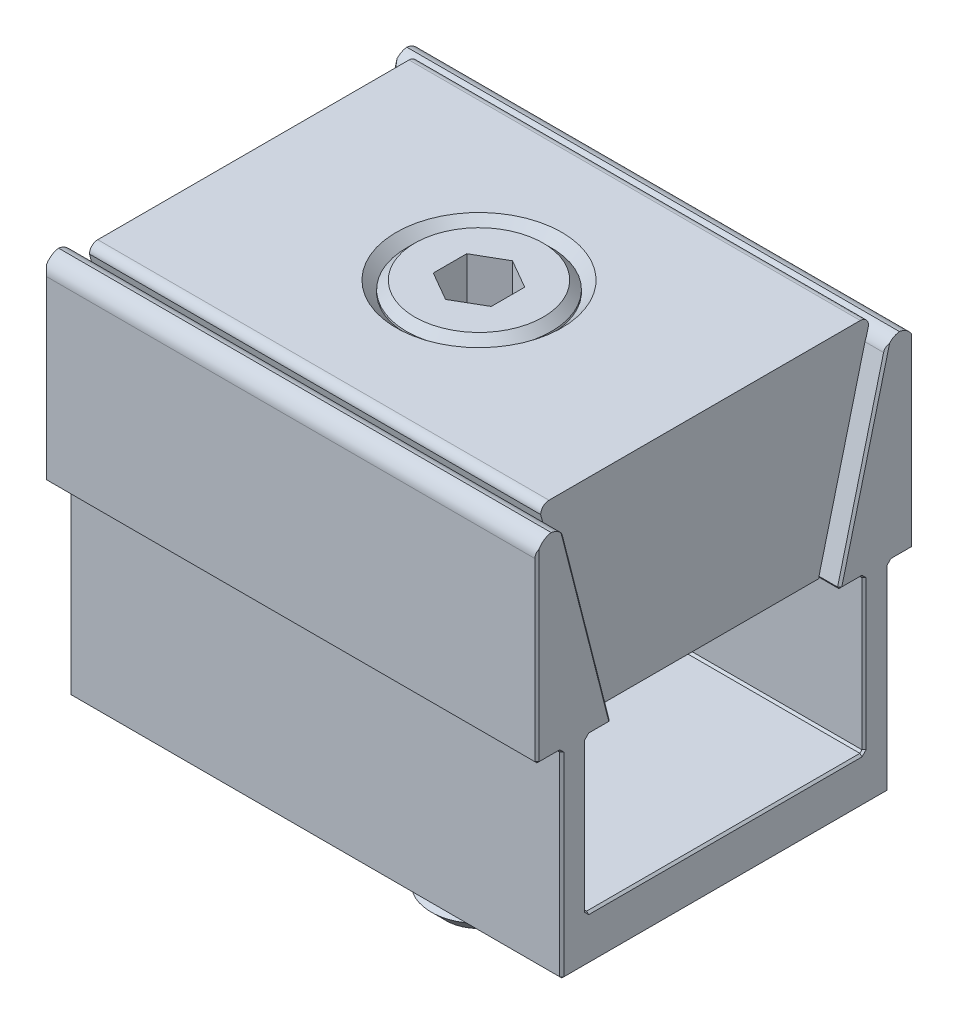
ISO-10303-21;
HEADER;
FILE_DESCRIPTION(('STEP AP214'),'2;1');
FILE_NAME('part.step','',(''),(''),'','','');
FILE_SCHEMA(('AUTOMOTIVE_DESIGN { 1 0 10303 214 1 1 1 1 }'));
ENDSEC;
DATA;
#1=APPLICATION_CONTEXT('core data for automotive mechanical design processes');
#2=APPLICATION_PROTOCOL_DEFINITION('international standard','automotive_design',2000,#1);
#3=PRODUCT_CONTEXT('',#1,'mechanical');
#4=PRODUCT('Part','Part','',(#3));
#5=PRODUCT_RELATED_PRODUCT_CATEGORY('part','',(#4));
#6=PRODUCT_DEFINITION_FORMATION('','',#4);
#7=PRODUCT_DEFINITION_CONTEXT('part definition',#1,'design');
#8=PRODUCT_DEFINITION('design','',#6,#7);
#9=PRODUCT_DEFINITION_SHAPE('','',#8);
#10=(LENGTH_UNIT() NAMED_UNIT(*) SI_UNIT(.MILLI.,.METRE.));
#11=(NAMED_UNIT(*) PLANE_ANGLE_UNIT() SI_UNIT($,.RADIAN.));
#12=(NAMED_UNIT(*) SI_UNIT($,.STERADIAN.) SOLID_ANGLE_UNIT());
#13=UNCERTAINTY_MEASURE_WITH_UNIT(LENGTH_MEASURE(1.E-05),#10,'distance_accuracy_value','');
#14=(GEOMETRIC_REPRESENTATION_CONTEXT(3) GLOBAL_UNCERTAINTY_ASSIGNED_CONTEXT((#13)) GLOBAL_UNIT_ASSIGNED_CONTEXT((#10,
#11,#12)) REPRESENTATION_CONTEXT('',''));
#15=CARTESIAN_POINT('',(0.,0.,0.));
#16=DIRECTION('',(0.,0.,1.));
#17=DIRECTION('',(1.,0.,0.));
#18=AXIS2_PLACEMENT_3D('',#15,#16,#17);
#19=CARTESIAN_POINT('',(0.,8.50000000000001,0.));
#20=DIRECTION('',(0.,1.,0.));
#21=DIRECTION('',(0.,0.,1.));
#22=AXIS2_PLACEMENT_3D('',#19,#20,#21);
#23=PLANE('',#22);
#24=CARTESIAN_POINT('',(0.,8.50000000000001,0.));
#25=DIRECTION('',(0.,1.,0.));
#26=DIRECTION('',(0.,0.,1.));
#27=AXIS2_PLACEMENT_3D('',#24,#25,#26);
#28=CIRCLE('',#27,0.699999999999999);
#29=CARTESIAN_POINT('',(0.349999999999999,8.50000000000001,0.606217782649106));
#30=VERTEX_POINT('',#29);
#31=CARTESIAN_POINT('',(0.699999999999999,8.50000000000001,0.));
#32=VERTEX_POINT('',#31);
#33=EDGE_CURVE('P0_E94',#30,#32,#28,.T.);
#34=ORIENTED_EDGE('',*,*,#33,.F.);
#35=DIRECTION('',(0.866025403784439,0.,-0.5));
#36=VECTOR('',#35,1.);
#37=CARTESIAN_POINT('',(0.,8.50000000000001,0.808290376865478));
#38=LINE('',#37,#36);
#39=CARTESIAN_POINT('',(0.699999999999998,8.50000000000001,0.40414518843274));
#40=VERTEX_POINT('',#39);
#41=EDGE_CURVE('P0_E117',#30,#40,#38,.T.);
#42=ORIENTED_EDGE('',*,*,#41,.T.);
#43=DIRECTION('',(0.,0.,-1.));
#44=VECTOR('',#43,1.);
#45=CARTESIAN_POINT('',(0.699999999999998,8.50000000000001,0.40414518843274));
#46=LINE('',#45,#44);
#47=EDGE_CURVE('P0_E113',#40,#32,#46,.T.);
#48=ORIENTED_EDGE('',*,*,#47,.T.);
#49=EDGE_LOOP('',(#34,#42,#48));
#50=FACE_BOUND('',#49,.T.);
#51=ADVANCED_FACE('P0_F16',(#50),#23,.T.);
#52=CARTESIAN_POINT('',(0.,8.50000000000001,0.));
#53=DIRECTION('',(0.,1.,0.));
#54=DIRECTION('',(0.,0.,1.));
#55=AXIS2_PLACEMENT_3D('',#52,#53,#54);
#56=CIRCLE('',#55,0.699999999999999);
#57=CARTESIAN_POINT('',(0.349999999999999,8.50000000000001,-0.606217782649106));
#58=VERTEX_POINT('',#57);
#59=EDGE_CURVE('P0_E11',#32,#58,#56,.T.);
#60=ORIENTED_EDGE('',*,*,#59,.F.);
#61=CARTESIAN_POINT('',(0.699999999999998,8.50000000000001,-0.404145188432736));
#62=VERTEX_POINT('',#61);
#63=EDGE_CURVE('P0_E105',#32,#62,#46,.T.);
#64=ORIENTED_EDGE('',*,*,#63,.T.);
#65=DIRECTION('',(-0.866025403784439,0.,-0.5));
#66=VECTOR('',#65,1.);
#67=CARTESIAN_POINT('',(0.699999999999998,8.50000000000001,-0.404145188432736));
#68=LINE('',#67,#66);
#69=EDGE_CURVE('P0_E108',#62,#58,#68,.T.);
#70=ORIENTED_EDGE('',*,*,#69,.T.);
#71=EDGE_LOOP('',(#60,#64,#70));
#72=FACE_BOUND('',#71,.T.);
#73=ADVANCED_FACE('P0_F104',(#72),#23,.T.);
#74=CARTESIAN_POINT('',(-0.349999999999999,8.50000000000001,-0.606217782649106));
#75=VERTEX_POINT('',#74);
#76=EDGE_CURVE('P0_E25',#58,#75,#56,.T.);
#77=ORIENTED_EDGE('',*,*,#76,.F.);
#78=CARTESIAN_POINT('',(0.,8.50000000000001,-0.808290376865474));
#79=VERTEX_POINT('',#78);
#80=EDGE_CURVE('P0_E140',#58,#79,#68,.T.);
#81=ORIENTED_EDGE('',*,*,#80,.T.);
#82=DIRECTION('',(-0.866025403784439,0.,0.499999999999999));
#83=VECTOR('',#82,1.);
#84=CARTESIAN_POINT('',(0.,8.50000000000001,-0.808290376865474));
#85=LINE('',#84,#83);
#86=EDGE_CURVE('P0_E318',#79,#75,#85,.T.);
#87=ORIENTED_EDGE('',*,*,#86,.T.);
#88=EDGE_LOOP('',(#77,#81,#87));
#89=FACE_BOUND('',#88,.T.);
#90=ADVANCED_FACE('P0_F320',(#89),#23,.T.);
#91=CARTESIAN_POINT('',(-0.699999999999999,8.50000000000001,0.));
#92=VERTEX_POINT('',#91);
#93=EDGE_CURVE('P0_E302',#75,#92,#56,.T.);
#94=ORIENTED_EDGE('',*,*,#93,.F.);
#95=CARTESIAN_POINT('',(-0.700000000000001,8.50000000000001,-0.404145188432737));
#96=VERTEX_POINT('',#95);
#97=EDGE_CURVE('P0_E311',#75,#96,#85,.T.);
#98=ORIENTED_EDGE('',*,*,#97,.T.);
#99=DIRECTION('',(0.,0.,1.));
#100=VECTOR('',#99,1.);
#101=CARTESIAN_POINT('',(-0.700000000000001,8.50000000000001,-0.404145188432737));
#102=LINE('',#101,#100);
#103=EDGE_CURVE('P0_E314',#96,#92,#102,.T.);
#104=ORIENTED_EDGE('',*,*,#103,.T.);
#105=EDGE_LOOP('',(#94,#98,#104));
#106=FACE_BOUND('',#105,.T.);
#107=ADVANCED_FACE('P0_F310',(#106),#23,.T.);
#108=CARTESIAN_POINT('',(-0.350000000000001,8.50000000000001,0.606217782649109));
#109=VERTEX_POINT('',#108);
#110=EDGE_CURVE('P0_E32',#92,#109,#56,.T.);
#111=ORIENTED_EDGE('',*,*,#110,.F.);
#112=CARTESIAN_POINT('',(-0.700000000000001,8.50000000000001,0.40414518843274));
#113=VERTEX_POINT('',#112);
#114=EDGE_CURVE('P0_E321',#92,#113,#102,.T.);
#115=ORIENTED_EDGE('',*,*,#114,.T.);
#116=DIRECTION('',(0.866025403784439,0.,0.5));
#117=VECTOR('',#116,1.);
#118=CARTESIAN_POINT('',(-0.700000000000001,8.50000000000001,0.40414518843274));
#119=LINE('',#118,#117);
#120=EDGE_CURVE('P0_E325',#113,#109,#119,.T.);
#121=ORIENTED_EDGE('',*,*,#120,.T.);
#122=EDGE_LOOP('',(#111,#115,#121));
#123=FACE_BOUND('',#122,.T.);
#124=ADVANCED_FACE('P0_F365',(#123),#23,.T.);
#125=CARTESIAN_POINT('',(0.,9.7,0.));
#126=DIRECTION('',(0.,1.,0.));
#127=DIRECTION('',(0.,0.,1.));
#128=AXIS2_PLACEMENT_3D('',#125,#126,#127);
#129=PLANE('',#128);
#130=DIRECTION('',(-0.866025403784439,0.,-0.5));
#131=VECTOR('',#130,1.);
#132=CARTESIAN_POINT('',(0.699999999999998,9.7,-0.404145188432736));
#133=LINE('',#132,#131);
#134=CARTESIAN_POINT('',(0.699999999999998,9.7,-0.404145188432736));
#135=VERTEX_POINT('',#134);
#136=CARTESIAN_POINT('',(0.,9.7,-0.808290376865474));
#137=VERTEX_POINT('',#136);
#138=EDGE_CURVE('P0_E40',#135,#137,#133,.T.);
#139=ORIENTED_EDGE('',*,*,#138,.F.);
#140=DIRECTION('',(0.,0.,-1.));
#141=VECTOR('',#140,1.);
#142=CARTESIAN_POINT('',(0.699999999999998,9.7,0.40414518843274));
#143=LINE('',#142,#141);
#144=CARTESIAN_POINT('',(0.699999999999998,9.7,0.40414518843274));
#145=VERTEX_POINT('',#144);
#146=EDGE_CURVE('P0_E138',#145,#135,#143,.T.);
#147=ORIENTED_EDGE('',*,*,#146,.F.);
#148=DIRECTION('',(0.866025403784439,0.,-0.5));
#149=VECTOR('',#148,1.);
#150=CARTESIAN_POINT('',(0.,9.7,0.808290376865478));
#151=LINE('',#150,#149);
#152=CARTESIAN_POINT('',(0.,9.7,0.808290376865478));
#153=VERTEX_POINT('',#152);
#154=EDGE_CURVE('P0_E135',#153,#145,#151,.T.);
#155=ORIENTED_EDGE('',*,*,#154,.F.);
#156=DIRECTION('',(0.866025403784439,0.,0.5));
#157=VECTOR('',#156,1.);
#158=CARTESIAN_POINT('',(-0.700000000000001,9.7,0.40414518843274));
#159=LINE('',#158,#157);
#160=CARTESIAN_POINT('',(-0.700000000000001,9.7,0.40414518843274));
#161=VERTEX_POINT('',#160);
#162=EDGE_CURVE('P0_E132',#161,#153,#159,.T.);
#163=ORIENTED_EDGE('',*,*,#162,.F.);
#164=DIRECTION('',(0.,0.,1.));
#165=VECTOR('',#164,1.);
#166=CARTESIAN_POINT('',(-0.700000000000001,9.7,-0.404145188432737));
#167=LINE('',#166,#165);
#168=CARTESIAN_POINT('',(-0.700000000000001,9.7,-0.404145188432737));
#169=VERTEX_POINT('',#168);
#170=EDGE_CURVE('P0_E129',#169,#161,#167,.T.);
#171=ORIENTED_EDGE('',*,*,#170,.F.);
#172=DIRECTION('',(-0.866025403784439,0.,0.499999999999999));
#173=VECTOR('',#172,1.);
#174=CARTESIAN_POINT('',(0.,9.7,-0.808290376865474));
#175=LINE('',#174,#173);
#176=EDGE_CURVE('P0_E126',#137,#169,#175,.T.);
#177=ORIENTED_EDGE('',*,*,#176,.F.);
#178=EDGE_LOOP('',(#139,#147,#155,#163,#171,#177));
#179=FACE_BOUND('',#178,.T.);
#180=CARTESIAN_POINT('',(0.,9.7,0.));
#181=DIRECTION('',(0.,1.,0.));
#182=DIRECTION('',(0.,0.,1.));
#183=AXIS2_PLACEMENT_3D('',#180,#181,#182);
#184=CIRCLE('',#183,1.55);
#185=CARTESIAN_POINT('',(0.,9.7,1.55));
#186=VERTEX_POINT('',#185);
#187=EDGE_CURVE('P0_E294',#186,#186,#184,.T.);
#188=ORIENTED_EDGE('',*,*,#187,.T.);
#189=EDGE_LOOP('',(#188));
#190=FACE_BOUND('',#189,.T.);
#191=ADVANCED_FACE('P0_F343',(#179,#190),#129,.T.);
#192=CARTESIAN_POINT('',(0.,69.9476336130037,0.));
#193=DIRECTION('',(0.,1.,0.));
#194=DIRECTION('',(0.,0.,1.));
#195=AXIS2_PLACEMENT_3D('',#192,#193,#194);
#196=CYLINDRICAL_SURFACE('',#195,1.75);
#197=CARTESIAN_POINT('',(0.,9.50000000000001,0.));
#198=DIRECTION('',(0.,1.,0.));
#199=DIRECTION('',(0.,0.,1.));
#200=AXIS2_PLACEMENT_3D('',#197,#198,#199);
#201=CIRCLE('',#200,1.75);
#202=CARTESIAN_POINT('',(0.,9.50000000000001,1.75));
#203=VERTEX_POINT('',#202);
#204=EDGE_CURVE('P0_E298',#203,#203,#201,.F.);
#205=ORIENTED_EDGE('',*,*,#204,.T.);
#206=EDGE_LOOP('',(#205));
#207=FACE_BOUND('',#206,.T.);
#208=CARTESIAN_POINT('',(0.,7.35,0.));
#209=DIRECTION('',(0.,1.,0.));
#210=DIRECTION('',(0.,0.,1.));
#211=AXIS2_PLACEMENT_3D('',#208,#209,#210);
#212=CIRCLE('',#211,1.75);
#213=CARTESIAN_POINT('',(0.,7.35,1.75));
#214=VERTEX_POINT('',#213);
#215=EDGE_CURVE('P0_E288',#214,#214,#212,.T.);
#216=ORIENTED_EDGE('',*,*,#215,.T.);
#217=EDGE_LOOP('',(#216));
#218=FACE_BOUND('',#217,.T.);
#219=ADVANCED_FACE('P0_F375',(#207,#218),#196,.T.);
#220=CARTESIAN_POINT('',(0.,7.35000000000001,1.75));
#221=DIRECTION('',(0.,-1.,0.));
#222=DIRECTION('',(0.,0.,-1.));
#223=AXIS2_PLACEMENT_3D('',#220,#221,#222);
#224=PLANE('',#223);
#225=CARTESIAN_POINT('',(0.,7.35,0.));
#226=DIRECTION('',(0.,1.,0.));
#227=DIRECTION('',(0.,0.,1.));
#228=AXIS2_PLACEMENT_3D('',#225,#226,#227);
#229=CIRCLE('',#228,1.25);
#230=CARTESIAN_POINT('',(0.,7.35,1.25));
#231=VERTEX_POINT('',#230);
#232=EDGE_CURVE('P0_E285',#231,#231,#229,.T.);
#233=ORIENTED_EDGE('',*,*,#232,.T.);
#234=EDGE_LOOP('',(#233));
#235=FACE_BOUND('',#234,.T.);
#236=ORIENTED_EDGE('',*,*,#215,.F.);
#237=EDGE_LOOP('',(#236));
#238=FACE_BOUND('',#237,.T.);
#239=ADVANCED_FACE('P0_F869',(#235,#238),#224,.T.);
#240=CARTESIAN_POINT('',(0.,7.125,0.));
#241=DIRECTION('',(0.,1.,0.));
#242=DIRECTION('',(0.,0.,1.));
#243=AXIS2_PLACEMENT_3D('',#240,#241,#242);
#244=CONICAL_SURFACE('',#243,0.860288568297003,1.04719755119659);
#245=ORIENTED_EDGE('',*,*,#232,.F.);
#246=EDGE_LOOP('',(#245));
#247=FACE_BOUND('',#246,.T.);
#248=CARTESIAN_POINT('',(0.,7.125,0.));
#249=DIRECTION('',(0.,1.,0.));
#250=DIRECTION('',(0.,0.,1.));
#251=AXIS2_PLACEMENT_3D('',#248,#249,#250);
#252=CIRCLE('',#251,0.860288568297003);
#253=CARTESIAN_POINT('',(0.,7.125,0.860288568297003));
#254=VERTEX_POINT('',#253);
#255=EDGE_CURVE('P0_E282',#254,#254,#252,.T.);
#256=ORIENTED_EDGE('',*,*,#255,.T.);
#257=EDGE_LOOP('',(#256));
#258=FACE_BOUND('',#257,.T.);
#259=ADVANCED_FACE('P0_F860',(#247,#258),#244,.T.);
#260=CARTESIAN_POINT('',(0.,6.9,0.));
#261=DIRECTION('',(0.,-1.,0.));
#262=DIRECTION('',(0.,0.,-1.));
#263=AXIS2_PLACEMENT_3D('',#260,#261,#262);
#264=CONICAL_SURFACE('',#263,1.25,1.04719755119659);
#265=ORIENTED_EDGE('',*,*,#255,.F.);
#266=EDGE_LOOP('',(#265));
#267=FACE_BOUND('',#266,.T.);
#268=CARTESIAN_POINT('',(0.,6.9,0.));
#269=DIRECTION('',(0.,1.,0.));
#270=DIRECTION('',(0.,0.,1.));
#271=AXIS2_PLACEMENT_3D('',#268,#269,#270);
#272=CIRCLE('',#271,1.25);
#273=CARTESIAN_POINT('',(0.,6.9,1.25));
#274=VERTEX_POINT('',#273);
#275=EDGE_CURVE('P0_E279',#274,#274,#272,.T.);
#276=ORIENTED_EDGE('',*,*,#275,.T.);
#277=EDGE_LOOP('',(#276));
#278=FACE_BOUND('',#277,.T.);
#279=ADVANCED_FACE('P0_F851',(#267,#278),#264,.T.);
#280=CARTESIAN_POINT('',(0.,6.675,0.));
#281=DIRECTION('',(0.,1.,0.));
#282=DIRECTION('',(0.,0.,1.));
#283=AXIS2_PLACEMENT_3D('',#280,#281,#282);
#284=CONICAL_SURFACE('',#283,0.860288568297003,1.04719755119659);
#285=ORIENTED_EDGE('',*,*,#275,.F.);
#286=EDGE_LOOP('',(#285));
#287=FACE_BOUND('',#286,.T.);
#288=CARTESIAN_POINT('',(0.,6.675,0.));
#289=DIRECTION('',(0.,1.,0.));
#290=DIRECTION('',(0.,0.,1.));
#291=AXIS2_PLACEMENT_3D('',#288,#289,#290);
#292=CIRCLE('',#291,0.860288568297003);
#293=CARTESIAN_POINT('',(0.,6.675,0.860288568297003));
#294=VERTEX_POINT('',#293);
#295=EDGE_CURVE('P0_E276',#294,#294,#292,.T.);
#296=ORIENTED_EDGE('',*,*,#295,.T.);
#297=EDGE_LOOP('',(#296));
#298=FACE_BOUND('',#297,.T.);
#299=ADVANCED_FACE('P0_F842',(#287,#298),#284,.T.);
#300=CARTESIAN_POINT('',(0.,6.44999999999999,0.));
#301=DIRECTION('',(0.,-1.,0.));
#302=DIRECTION('',(0.,0.,-1.));
#303=AXIS2_PLACEMENT_3D('',#300,#301,#302);
#304=CONICAL_SURFACE('',#303,1.25,1.04719755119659);
#305=ORIENTED_EDGE('',*,*,#295,.F.);
#306=EDGE_LOOP('',(#305));
#307=FACE_BOUND('',#306,.T.);
#308=CARTESIAN_POINT('',(0.,6.45,0.));
#309=DIRECTION('',(0.,1.,0.));
#310=DIRECTION('',(0.,0.,1.));
#311=AXIS2_PLACEMENT_3D('',#308,#309,#310);
#312=CIRCLE('',#311,1.25);
#313=CARTESIAN_POINT('',(0.,6.45,1.25));
#314=VERTEX_POINT('',#313);
#315=EDGE_CURVE('P0_E273',#314,#314,#312,.T.);
#316=ORIENTED_EDGE('',*,*,#315,.T.);
#317=EDGE_LOOP('',(#316));
#318=FACE_BOUND('',#317,.T.);
#319=ADVANCED_FACE('P0_F833',(#307,#318),#304,.T.);
#320=CARTESIAN_POINT('',(0.,6.225,0.));
#321=DIRECTION('',(0.,1.,0.));
#322=DIRECTION('',(0.,0.,1.));
#323=AXIS2_PLACEMENT_3D('',#320,#321,#322);
#324=CONICAL_SURFACE('',#323,0.860288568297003,1.04719755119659);
#325=ORIENTED_EDGE('',*,*,#315,.F.);
#326=EDGE_LOOP('',(#325));
#327=FACE_BOUND('',#326,.T.);
#328=CARTESIAN_POINT('',(0.,6.225,0.));
#329=DIRECTION('',(0.,1.,0.));
#330=DIRECTION('',(0.,0.,1.));
#331=AXIS2_PLACEMENT_3D('',#328,#329,#330);
#332=CIRCLE('',#331,0.860288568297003);
#333=CARTESIAN_POINT('',(0.,6.225,0.860288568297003));
#334=VERTEX_POINT('',#333);
#335=EDGE_CURVE('P0_E270',#334,#334,#332,.T.);
#336=ORIENTED_EDGE('',*,*,#335,.T.);
#337=EDGE_LOOP('',(#336));
#338=FACE_BOUND('',#337,.T.);
#339=ADVANCED_FACE('P0_F824',(#327,#338),#324,.T.);
#340=CARTESIAN_POINT('',(0.,5.99999999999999,0.));
#341=DIRECTION('',(0.,-1.,0.));
#342=DIRECTION('',(0.,0.,-1.));
#343=AXIS2_PLACEMENT_3D('',#340,#341,#342);
#344=CONICAL_SURFACE('',#343,1.25,1.04719755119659);
#345=ORIENTED_EDGE('',*,*,#335,.F.);
#346=EDGE_LOOP('',(#345));
#347=FACE_BOUND('',#346,.T.);
#348=CARTESIAN_POINT('',(0.,6.,0.));
#349=DIRECTION('',(0.,1.,0.));
#350=DIRECTION('',(0.,0.,1.));
#351=AXIS2_PLACEMENT_3D('',#348,#349,#350);
#352=CIRCLE('',#351,1.25);
#353=CARTESIAN_POINT('',(0.,6.,1.25));
#354=VERTEX_POINT('',#353);
#355=EDGE_CURVE('P0_E267',#354,#354,#352,.T.);
#356=ORIENTED_EDGE('',*,*,#355,.T.);
#357=EDGE_LOOP('',(#356));
#358=FACE_BOUND('',#357,.T.);
#359=ADVANCED_FACE('P0_F815',(#347,#358),#344,.T.);
#360=CARTESIAN_POINT('',(0.,5.775,0.));
#361=DIRECTION('',(0.,1.,0.));
#362=DIRECTION('',(0.,0.,1.));
#363=AXIS2_PLACEMENT_3D('',#360,#361,#362);
#364=CONICAL_SURFACE('',#363,0.860288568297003,1.04719755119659);
#365=ORIENTED_EDGE('',*,*,#355,.F.);
#366=EDGE_LOOP('',(#365));
#367=FACE_BOUND('',#366,.T.);
#368=CARTESIAN_POINT('',(0.,5.775,0.));
#369=DIRECTION('',(0.,1.,0.));
#370=DIRECTION('',(0.,0.,1.));
#371=AXIS2_PLACEMENT_3D('',#368,#369,#370);
#372=CIRCLE('',#371,0.860288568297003);
#373=CARTESIAN_POINT('',(0.,5.775,0.860288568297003));
#374=VERTEX_POINT('',#373);
#375=EDGE_CURVE('P0_E264',#374,#374,#372,.T.);
#376=ORIENTED_EDGE('',*,*,#375,.T.);
#377=EDGE_LOOP('',(#376));
#378=FACE_BOUND('',#377,.T.);
#379=ADVANCED_FACE('P0_F806',(#367,#378),#364,.T.);
#380=CARTESIAN_POINT('',(0.,5.54999999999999,0.));
#381=DIRECTION('',(0.,-1.,0.));
#382=DIRECTION('',(0.,0.,-1.));
#383=AXIS2_PLACEMENT_3D('',#380,#381,#382);
#384=CONICAL_SURFACE('',#383,1.25,1.04719755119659);
#385=ORIENTED_EDGE('',*,*,#375,.F.);
#386=EDGE_LOOP('',(#385));
#387=FACE_BOUND('',#386,.T.);
#388=CARTESIAN_POINT('',(0.,5.55,0.));
#389=DIRECTION('',(0.,1.,0.));
#390=DIRECTION('',(0.,0.,1.));
#391=AXIS2_PLACEMENT_3D('',#388,#389,#390);
#392=CIRCLE('',#391,1.25);
#393=CARTESIAN_POINT('',(0.,5.55,1.25));
#394=VERTEX_POINT('',#393);
#395=EDGE_CURVE('P0_E261',#394,#394,#392,.T.);
#396=ORIENTED_EDGE('',*,*,#395,.T.);
#397=EDGE_LOOP('',(#396));
#398=FACE_BOUND('',#397,.T.);
#399=ADVANCED_FACE('P0_F797',(#387,#398),#384,.T.);
#400=CARTESIAN_POINT('',(0.,5.325,0.));
#401=DIRECTION('',(0.,1.,0.));
#402=DIRECTION('',(0.,0.,1.));
#403=AXIS2_PLACEMENT_3D('',#400,#401,#402);
#404=CONICAL_SURFACE('',#403,0.860288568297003,1.04719755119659);
#405=ORIENTED_EDGE('',*,*,#395,.F.);
#406=EDGE_LOOP('',(#405));
#407=FACE_BOUND('',#406,.T.);
#408=CARTESIAN_POINT('',(0.,5.325,0.));
#409=DIRECTION('',(0.,1.,0.));
#410=DIRECTION('',(0.,0.,1.));
#411=AXIS2_PLACEMENT_3D('',#408,#409,#410);
#412=CIRCLE('',#411,0.860288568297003);
#413=CARTESIAN_POINT('',(0.,5.325,0.860288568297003));
#414=VERTEX_POINT('',#413);
#415=EDGE_CURVE('P0_E258',#414,#414,#412,.T.);
#416=ORIENTED_EDGE('',*,*,#415,.T.);
#417=EDGE_LOOP('',(#416));
#418=FACE_BOUND('',#417,.T.);
#419=ADVANCED_FACE('P0_F788',(#407,#418),#404,.T.);
#420=CARTESIAN_POINT('',(0.,5.1,0.));
#421=DIRECTION('',(0.,-1.,0.));
#422=DIRECTION('',(0.,0.,-1.));
#423=AXIS2_PLACEMENT_3D('',#420,#421,#422);
#424=CONICAL_SURFACE('',#423,1.25,1.04719755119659);
#425=ORIENTED_EDGE('',*,*,#415,.F.);
#426=EDGE_LOOP('',(#425));
#427=FACE_BOUND('',#426,.T.);
#428=CARTESIAN_POINT('',(0.,5.1,0.));
#429=DIRECTION('',(0.,1.,0.));
#430=DIRECTION('',(0.,0.,1.));
#431=AXIS2_PLACEMENT_3D('',#428,#429,#430);
#432=CIRCLE('',#431,1.25);
#433=CARTESIAN_POINT('',(0.,5.1,1.25));
#434=VERTEX_POINT('',#433);
#435=EDGE_CURVE('P0_E255',#434,#434,#432,.T.);
#436=ORIENTED_EDGE('',*,*,#435,.T.);
#437=EDGE_LOOP('',(#436));
#438=FACE_BOUND('',#437,.T.);
#439=ADVANCED_FACE('P0_F779',(#427,#438),#424,.T.);
#440=CARTESIAN_POINT('',(0.,4.875,0.));
#441=DIRECTION('',(0.,1.,0.));
#442=DIRECTION('',(0.,0.,1.));
#443=AXIS2_PLACEMENT_3D('',#440,#441,#442);
#444=CONICAL_SURFACE('',#443,0.860288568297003,1.04719755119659);
#445=ORIENTED_EDGE('',*,*,#435,.F.);
#446=EDGE_LOOP('',(#445));
#447=FACE_BOUND('',#446,.T.);
#448=CARTESIAN_POINT('',(0.,4.875,0.));
#449=DIRECTION('',(0.,1.,0.));
#450=DIRECTION('',(0.,0.,1.));
#451=AXIS2_PLACEMENT_3D('',#448,#449,#450);
#452=CIRCLE('',#451,0.860288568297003);
#453=CARTESIAN_POINT('',(0.,4.875,0.860288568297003));
#454=VERTEX_POINT('',#453);
#455=EDGE_CURVE('P0_E252',#454,#454,#452,.T.);
#456=ORIENTED_EDGE('',*,*,#455,.T.);
#457=EDGE_LOOP('',(#456));
#458=FACE_BOUND('',#457,.T.);
#459=ADVANCED_FACE('P0_F770',(#447,#458),#444,.T.);
#460=CARTESIAN_POINT('',(0.,4.64999999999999,0.));
#461=DIRECTION('',(0.,-1.,0.));
#462=DIRECTION('',(0.,0.,-1.));
#463=AXIS2_PLACEMENT_3D('',#460,#461,#462);
#464=CONICAL_SURFACE('',#463,1.25,1.04719755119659);
#465=ORIENTED_EDGE('',*,*,#455,.F.);
#466=EDGE_LOOP('',(#465));
#467=FACE_BOUND('',#466,.T.);
#468=CARTESIAN_POINT('',(0.,4.65,0.));
#469=DIRECTION('',(0.,1.,0.));
#470=DIRECTION('',(0.,0.,1.));
#471=AXIS2_PLACEMENT_3D('',#468,#469,#470);
#472=CIRCLE('',#471,1.25);
#473=CARTESIAN_POINT('',(0.,4.65,1.25));
#474=VERTEX_POINT('',#473);
#475=EDGE_CURVE('P0_E249',#474,#474,#472,.T.);
#476=ORIENTED_EDGE('',*,*,#475,.T.);
#477=EDGE_LOOP('',(#476));
#478=FACE_BOUND('',#477,.T.);
#479=ADVANCED_FACE('P0_F761',(#467,#478),#464,.T.);
#480=CARTESIAN_POINT('',(0.,4.425,0.));
#481=DIRECTION('',(0.,1.,0.));
#482=DIRECTION('',(0.,0.,1.));
#483=AXIS2_PLACEMENT_3D('',#480,#481,#482);
#484=CONICAL_SURFACE('',#483,0.860288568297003,1.04719755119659);
#485=ORIENTED_EDGE('',*,*,#475,.F.);
#486=EDGE_LOOP('',(#485));
#487=FACE_BOUND('',#486,.T.);
#488=CARTESIAN_POINT('',(0.,4.425,0.));
#489=DIRECTION('',(0.,1.,0.));
#490=DIRECTION('',(0.,0.,1.));
#491=AXIS2_PLACEMENT_3D('',#488,#489,#490);
#492=CIRCLE('',#491,0.860288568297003);
#493=CARTESIAN_POINT('',(0.,4.425,0.860288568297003));
#494=VERTEX_POINT('',#493);
#495=EDGE_CURVE('P0_E246',#494,#494,#492,.T.);
#496=ORIENTED_EDGE('',*,*,#495,.T.);
#497=EDGE_LOOP('',(#496));
#498=FACE_BOUND('',#497,.T.);
#499=ADVANCED_FACE('P0_F752',(#487,#498),#484,.T.);
#500=CARTESIAN_POINT('',(0.,4.19999999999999,0.));
#501=DIRECTION('',(0.,-1.,0.));
#502=DIRECTION('',(0.,0.,-1.));
#503=AXIS2_PLACEMENT_3D('',#500,#501,#502);
#504=CONICAL_SURFACE('',#503,1.25,1.04719755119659);
#505=ORIENTED_EDGE('',*,*,#495,.F.);
#506=EDGE_LOOP('',(#505));
#507=FACE_BOUND('',#506,.T.);
#508=CARTESIAN_POINT('',(0.,4.2,0.));
#509=DIRECTION('',(0.,1.,0.));
#510=DIRECTION('',(0.,0.,1.));
#511=AXIS2_PLACEMENT_3D('',#508,#509,#510);
#512=CIRCLE('',#511,1.25);
#513=CARTESIAN_POINT('',(0.,4.2,1.25));
#514=VERTEX_POINT('',#513);
#515=EDGE_CURVE('P0_E243',#514,#514,#512,.T.);
#516=ORIENTED_EDGE('',*,*,#515,.T.);
#517=EDGE_LOOP('',(#516));
#518=FACE_BOUND('',#517,.T.);
#519=ADVANCED_FACE('P0_F743',(#507,#518),#504,.T.);
#520=CARTESIAN_POINT('',(0.,3.975,0.));
#521=DIRECTION('',(0.,1.,0.));
#522=DIRECTION('',(0.,0.,1.));
#523=AXIS2_PLACEMENT_3D('',#520,#521,#522);
#524=CONICAL_SURFACE('',#523,0.860288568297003,1.04719755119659);
#525=ORIENTED_EDGE('',*,*,#515,.F.);
#526=EDGE_LOOP('',(#525));
#527=FACE_BOUND('',#526,.T.);
#528=CARTESIAN_POINT('',(0.,3.975,0.));
#529=DIRECTION('',(0.,1.,0.));
#530=DIRECTION('',(0.,0.,1.));
#531=AXIS2_PLACEMENT_3D('',#528,#529,#530);
#532=CIRCLE('',#531,0.860288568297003);
#533=CARTESIAN_POINT('',(0.,3.975,0.860288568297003));
#534=VERTEX_POINT('',#533);
#535=EDGE_CURVE('P0_E240',#534,#534,#532,.T.);
#536=ORIENTED_EDGE('',*,*,#535,.T.);
#537=EDGE_LOOP('',(#536));
#538=FACE_BOUND('',#537,.T.);
#539=ADVANCED_FACE('P0_F734',(#527,#538),#524,.T.);
#540=CARTESIAN_POINT('',(0.,3.74999999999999,0.));
#541=DIRECTION('',(0.,-1.,0.));
#542=DIRECTION('',(0.,0.,-1.));
#543=AXIS2_PLACEMENT_3D('',#540,#541,#542);
#544=CONICAL_SURFACE('',#543,1.25,1.04719755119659);
#545=ORIENTED_EDGE('',*,*,#535,.F.);
#546=EDGE_LOOP('',(#545));
#547=FACE_BOUND('',#546,.T.);
#548=CARTESIAN_POINT('',(0.,3.75,0.));
#549=DIRECTION('',(0.,1.,0.));
#550=DIRECTION('',(0.,0.,1.));
#551=AXIS2_PLACEMENT_3D('',#548,#549,#550);
#552=CIRCLE('',#551,1.25);
#553=CARTESIAN_POINT('',(0.,3.75,1.25));
#554=VERTEX_POINT('',#553);
#555=EDGE_CURVE('P0_E237',#554,#554,#552,.T.);
#556=ORIENTED_EDGE('',*,*,#555,.T.);
#557=EDGE_LOOP('',(#556));
#558=FACE_BOUND('',#557,.T.);
#559=ADVANCED_FACE('P0_F725',(#547,#558),#544,.T.);
#560=CARTESIAN_POINT('',(0.,3.525,0.));
#561=DIRECTION('',(0.,1.,0.));
#562=DIRECTION('',(0.,0.,1.));
#563=AXIS2_PLACEMENT_3D('',#560,#561,#562);
#564=CONICAL_SURFACE('',#563,0.860288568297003,1.04719755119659);
#565=ORIENTED_EDGE('',*,*,#555,.F.);
#566=EDGE_LOOP('',(#565));
#567=FACE_BOUND('',#566,.T.);
#568=CARTESIAN_POINT('',(0.,3.525,0.));
#569=DIRECTION('',(0.,1.,0.));
#570=DIRECTION('',(0.,0.,1.));
#571=AXIS2_PLACEMENT_3D('',#568,#569,#570);
#572=CIRCLE('',#571,0.860288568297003);
#573=CARTESIAN_POINT('',(0.,3.525,0.860288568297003));
#574=VERTEX_POINT('',#573);
#575=EDGE_CURVE('P0_E234',#574,#574,#572,.T.);
#576=ORIENTED_EDGE('',*,*,#575,.T.);
#577=EDGE_LOOP('',(#576));
#578=FACE_BOUND('',#577,.T.);
#579=ADVANCED_FACE('P0_F716',(#567,#578),#564,.T.);
#580=CARTESIAN_POINT('',(0.,3.29999999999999,0.));
#581=DIRECTION('',(0.,-1.,0.));
#582=DIRECTION('',(0.,0.,-1.));
#583=AXIS2_PLACEMENT_3D('',#580,#581,#582);
#584=CONICAL_SURFACE('',#583,1.25,1.04719755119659);
#585=ORIENTED_EDGE('',*,*,#575,.F.);
#586=EDGE_LOOP('',(#585));
#587=FACE_BOUND('',#586,.T.);
#588=CARTESIAN_POINT('',(0.,3.3,0.));
#589=DIRECTION('',(0.,1.,0.));
#590=DIRECTION('',(0.,0.,1.));
#591=AXIS2_PLACEMENT_3D('',#588,#589,#590);
#592=CIRCLE('',#591,1.25);
#593=CARTESIAN_POINT('',(0.,3.3,1.25));
#594=VERTEX_POINT('',#593);
#595=EDGE_CURVE('P0_E231',#594,#594,#592,.T.);
#596=ORIENTED_EDGE('',*,*,#595,.T.);
#597=EDGE_LOOP('',(#596));
#598=FACE_BOUND('',#597,.T.);
#599=ADVANCED_FACE('P0_F707',(#587,#598),#584,.T.);
#600=CARTESIAN_POINT('',(0.,3.075,0.));
#601=DIRECTION('',(0.,1.,0.));
#602=DIRECTION('',(0.,0.,1.));
#603=AXIS2_PLACEMENT_3D('',#600,#601,#602);
#604=CONICAL_SURFACE('',#603,0.860288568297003,1.04719755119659);
#605=ORIENTED_EDGE('',*,*,#595,.F.);
#606=EDGE_LOOP('',(#605));
#607=FACE_BOUND('',#606,.T.);
#608=CARTESIAN_POINT('',(0.,3.075,0.));
#609=DIRECTION('',(0.,1.,0.));
#610=DIRECTION('',(0.,0.,1.));
#611=AXIS2_PLACEMENT_3D('',#608,#609,#610);
#612=CIRCLE('',#611,0.860288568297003);
#613=CARTESIAN_POINT('',(0.,3.075,0.860288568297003));
#614=VERTEX_POINT('',#613);
#615=EDGE_CURVE('P0_E228',#614,#614,#612,.T.);
#616=ORIENTED_EDGE('',*,*,#615,.T.);
#617=EDGE_LOOP('',(#616));
#618=FACE_BOUND('',#617,.T.);
#619=ADVANCED_FACE('P0_F698',(#607,#618),#604,.T.);
#620=CARTESIAN_POINT('',(0.,2.84999999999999,0.));
#621=DIRECTION('',(0.,-1.,0.));
#622=DIRECTION('',(0.,0.,-1.));
#623=AXIS2_PLACEMENT_3D('',#620,#621,#622);
#624=CONICAL_SURFACE('',#623,1.25,1.04719755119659);
#625=ORIENTED_EDGE('',*,*,#615,.F.);
#626=EDGE_LOOP('',(#625));
#627=FACE_BOUND('',#626,.T.);
#628=CARTESIAN_POINT('',(0.,2.85,0.));
#629=DIRECTION('',(0.,1.,0.));
#630=DIRECTION('',(0.,0.,1.));
#631=AXIS2_PLACEMENT_3D('',#628,#629,#630);
#632=CIRCLE('',#631,1.25);
#633=CARTESIAN_POINT('',(0.,2.85,1.25));
#634=VERTEX_POINT('',#633);
#635=EDGE_CURVE('P0_E225',#634,#634,#632,.T.);
#636=ORIENTED_EDGE('',*,*,#635,.T.);
#637=EDGE_LOOP('',(#636));
#638=FACE_BOUND('',#637,.T.);
#639=ADVANCED_FACE('P0_F689',(#627,#638),#624,.T.);
#640=CARTESIAN_POINT('',(0.,2.625,0.));
#641=DIRECTION('',(0.,1.,0.));
#642=DIRECTION('',(0.,0.,1.));
#643=AXIS2_PLACEMENT_3D('',#640,#641,#642);
#644=CONICAL_SURFACE('',#643,0.860288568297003,1.04719755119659);
#645=ORIENTED_EDGE('',*,*,#635,.F.);
#646=EDGE_LOOP('',(#645));
#647=FACE_BOUND('',#646,.T.);
#648=CARTESIAN_POINT('',(0.,2.625,0.));
#649=DIRECTION('',(0.,1.,0.));
#650=DIRECTION('',(0.,0.,1.));
#651=AXIS2_PLACEMENT_3D('',#648,#649,#650);
#652=CIRCLE('',#651,0.860288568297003);
#653=CARTESIAN_POINT('',(0.,2.625,0.860288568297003));
#654=VERTEX_POINT('',#653);
#655=EDGE_CURVE('P0_E222',#654,#654,#652,.T.);
#656=ORIENTED_EDGE('',*,*,#655,.T.);
#657=EDGE_LOOP('',(#656));
#658=FACE_BOUND('',#657,.T.);
#659=ADVANCED_FACE('P0_F680',(#647,#658),#644,.T.);
#660=CARTESIAN_POINT('',(0.,2.4,0.));
#661=DIRECTION('',(0.,-1.,0.));
#662=DIRECTION('',(0.,0.,-1.));
#663=AXIS2_PLACEMENT_3D('',#660,#661,#662);
#664=CONICAL_SURFACE('',#663,1.25,1.04719755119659);
#665=ORIENTED_EDGE('',*,*,#655,.F.);
#666=EDGE_LOOP('',(#665));
#667=FACE_BOUND('',#666,.T.);
#668=CARTESIAN_POINT('',(0.,2.4,0.));
#669=DIRECTION('',(0.,1.,0.));
#670=DIRECTION('',(0.,0.,1.));
#671=AXIS2_PLACEMENT_3D('',#668,#669,#670);
#672=CIRCLE('',#671,1.25);
#673=CARTESIAN_POINT('',(0.,2.4,1.25));
#674=VERTEX_POINT('',#673);
#675=EDGE_CURVE('P0_E219',#674,#674,#672,.T.);
#676=ORIENTED_EDGE('',*,*,#675,.T.);
#677=EDGE_LOOP('',(#676));
#678=FACE_BOUND('',#677,.T.);
#679=ADVANCED_FACE('P0_F671',(#667,#678),#664,.T.);
#680=CARTESIAN_POINT('',(0.,2.175,0.));
#681=DIRECTION('',(0.,1.,0.));
#682=DIRECTION('',(0.,0.,1.));
#683=AXIS2_PLACEMENT_3D('',#680,#681,#682);
#684=CONICAL_SURFACE('',#683,0.860288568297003,1.04719755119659);
#685=ORIENTED_EDGE('',*,*,#675,.F.);
#686=EDGE_LOOP('',(#685));
#687=FACE_BOUND('',#686,.T.);
#688=CARTESIAN_POINT('',(0.,2.175,0.));
#689=DIRECTION('',(0.,1.,0.));
#690=DIRECTION('',(0.,0.,1.));
#691=AXIS2_PLACEMENT_3D('',#688,#689,#690);
#692=CIRCLE('',#691,0.860288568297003);
#693=CARTESIAN_POINT('',(0.,2.175,0.860288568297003));
#694=VERTEX_POINT('',#693);
#695=EDGE_CURVE('P0_E216',#694,#694,#692,.T.);
#696=ORIENTED_EDGE('',*,*,#695,.T.);
#697=EDGE_LOOP('',(#696));
#698=FACE_BOUND('',#697,.T.);
#699=ADVANCED_FACE('P0_F662',(#687,#698),#684,.T.);
#700=CARTESIAN_POINT('',(0.,1.95,0.));
#701=DIRECTION('',(0.,-1.,0.));
#702=DIRECTION('',(0.,0.,-1.));
#703=AXIS2_PLACEMENT_3D('',#700,#701,#702);
#704=CONICAL_SURFACE('',#703,1.25,1.04719755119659);
#705=ORIENTED_EDGE('',*,*,#695,.F.);
#706=EDGE_LOOP('',(#705));
#707=FACE_BOUND('',#706,.T.);
#708=CARTESIAN_POINT('',(0.,1.95,0.));
#709=DIRECTION('',(0.,1.,0.));
#710=DIRECTION('',(0.,0.,1.));
#711=AXIS2_PLACEMENT_3D('',#708,#709,#710);
#712=CIRCLE('',#711,1.25);
#713=CARTESIAN_POINT('',(0.,1.95,1.25));
#714=VERTEX_POINT('',#713);
#715=EDGE_CURVE('P0_E213',#714,#714,#712,.T.);
#716=ORIENTED_EDGE('',*,*,#715,.T.);
#717=EDGE_LOOP('',(#716));
#718=FACE_BOUND('',#717,.T.);
#719=ADVANCED_FACE('P0_F653',(#707,#718),#704,.T.);
#720=CARTESIAN_POINT('',(0.,1.725,0.));
#721=DIRECTION('',(0.,1.,0.));
#722=DIRECTION('',(0.,0.,1.));
#723=AXIS2_PLACEMENT_3D('',#720,#721,#722);
#724=CONICAL_SURFACE('',#723,0.860288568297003,1.04719755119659);
#725=ORIENTED_EDGE('',*,*,#715,.F.);
#726=EDGE_LOOP('',(#725));
#727=FACE_BOUND('',#726,.T.);
#728=CARTESIAN_POINT('',(0.,1.725,0.));
#729=DIRECTION('',(0.,1.,0.));
#730=DIRECTION('',(0.,0.,1.));
#731=AXIS2_PLACEMENT_3D('',#728,#729,#730);
#732=CIRCLE('',#731,0.860288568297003);
#733=CARTESIAN_POINT('',(0.,1.725,0.860288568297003));
#734=VERTEX_POINT('',#733);
#735=EDGE_CURVE('P0_E210',#734,#734,#732,.T.);
#736=ORIENTED_EDGE('',*,*,#735,.T.);
#737=EDGE_LOOP('',(#736));
#738=FACE_BOUND('',#737,.T.);
#739=ADVANCED_FACE('P0_F644',(#727,#738),#724,.T.);
#740=CARTESIAN_POINT('',(0.,1.49999999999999,0.));
#741=DIRECTION('',(0.,-1.,0.));
#742=DIRECTION('',(0.,0.,-1.));
#743=AXIS2_PLACEMENT_3D('',#740,#741,#742);
#744=CONICAL_SURFACE('',#743,1.25,1.04719755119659);
#745=ORIENTED_EDGE('',*,*,#735,.F.);
#746=EDGE_LOOP('',(#745));
#747=FACE_BOUND('',#746,.T.);
#748=CARTESIAN_POINT('',(0.,1.5,0.));
#749=DIRECTION('',(0.,1.,0.));
#750=DIRECTION('',(0.,0.,1.));
#751=AXIS2_PLACEMENT_3D('',#748,#749,#750);
#752=CIRCLE('',#751,1.25);
#753=CARTESIAN_POINT('',(0.,1.5,1.25));
#754=VERTEX_POINT('',#753);
#755=EDGE_CURVE('P0_E207',#754,#754,#752,.T.);
#756=ORIENTED_EDGE('',*,*,#755,.T.);
#757=EDGE_LOOP('',(#756));
#758=FACE_BOUND('',#757,.T.);
#759=ADVANCED_FACE('P0_F635',(#747,#758),#744,.T.);
#760=CARTESIAN_POINT('',(0.,1.275,0.));
#761=DIRECTION('',(0.,1.,0.));
#762=DIRECTION('',(0.,0.,1.));
#763=AXIS2_PLACEMENT_3D('',#760,#761,#762);
#764=CONICAL_SURFACE('',#763,0.860288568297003,1.04719755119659);
#765=ORIENTED_EDGE('',*,*,#755,.F.);
#766=EDGE_LOOP('',(#765));
#767=FACE_BOUND('',#766,.T.);
#768=CARTESIAN_POINT('',(0.,1.275,0.));
#769=DIRECTION('',(0.,1.,0.));
#770=DIRECTION('',(0.,0.,1.));
#771=AXIS2_PLACEMENT_3D('',#768,#769,#770);
#772=CIRCLE('',#771,0.860288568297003);
#773=CARTESIAN_POINT('',(0.,1.275,0.860288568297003));
#774=VERTEX_POINT('',#773);
#775=EDGE_CURVE('P0_E204',#774,#774,#772,.T.);
#776=ORIENTED_EDGE('',*,*,#775,.T.);
#777=EDGE_LOOP('',(#776));
#778=FACE_BOUND('',#777,.T.);
#779=ADVANCED_FACE('P0_F626',(#767,#778),#764,.T.);
#780=CARTESIAN_POINT('',(0.,1.04999999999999,0.));
#781=DIRECTION('',(0.,-1.,0.));
#782=DIRECTION('',(0.,0.,-1.));
#783=AXIS2_PLACEMENT_3D('',#780,#781,#782);
#784=CONICAL_SURFACE('',#783,1.25,1.04719755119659);
#785=ORIENTED_EDGE('',*,*,#775,.F.);
#786=EDGE_LOOP('',(#785));
#787=FACE_BOUND('',#786,.T.);
#788=CARTESIAN_POINT('',(0.,1.05,0.));
#789=DIRECTION('',(0.,1.,0.));
#790=DIRECTION('',(0.,0.,1.));
#791=AXIS2_PLACEMENT_3D('',#788,#789,#790);
#792=CIRCLE('',#791,1.25);
#793=CARTESIAN_POINT('',(0.,1.05,1.25));
#794=VERTEX_POINT('',#793);
#795=EDGE_CURVE('P0_E201',#794,#794,#792,.T.);
#796=ORIENTED_EDGE('',*,*,#795,.T.);
#797=EDGE_LOOP('',(#796));
#798=FACE_BOUND('',#797,.T.);
#799=ADVANCED_FACE('P0_F617',(#787,#798),#784,.T.);
#800=CARTESIAN_POINT('',(0.,0.824999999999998,0.));
#801=DIRECTION('',(0.,1.,0.));
#802=DIRECTION('',(0.,0.,1.));
#803=AXIS2_PLACEMENT_3D('',#800,#801,#802);
#804=CONICAL_SURFACE('',#803,0.860288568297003,1.04719755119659);
#805=ORIENTED_EDGE('',*,*,#795,.F.);
#806=EDGE_LOOP('',(#805));
#807=FACE_BOUND('',#806,.T.);
#808=CARTESIAN_POINT('',(0.,0.824999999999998,0.));
#809=DIRECTION('',(0.,1.,0.));
#810=DIRECTION('',(0.,0.,1.));
#811=AXIS2_PLACEMENT_3D('',#808,#809,#810);
#812=CIRCLE('',#811,0.860288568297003);
#813=CARTESIAN_POINT('',(0.,0.824999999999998,0.860288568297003));
#814=VERTEX_POINT('',#813);
#815=EDGE_CURVE('P0_E198',#814,#814,#812,.T.);
#816=ORIENTED_EDGE('',*,*,#815,.T.);
#817=EDGE_LOOP('',(#816));
#818=FACE_BOUND('',#817,.T.);
#819=ADVANCED_FACE('P0_F608',(#807,#818),#804,.T.);
#820=CARTESIAN_POINT('',(0.,0.599999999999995,0.));
#821=DIRECTION('',(0.,-1.,0.));
#822=DIRECTION('',(0.,0.,-1.));
#823=AXIS2_PLACEMENT_3D('',#820,#821,#822);
#824=CONICAL_SURFACE('',#823,1.25,1.04719755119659);
#825=ORIENTED_EDGE('',*,*,#815,.F.);
#826=EDGE_LOOP('',(#825));
#827=FACE_BOUND('',#826,.T.);
#828=CARTESIAN_POINT('',(0.,0.600000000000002,0.));
#829=DIRECTION('',(0.,1.,0.));
#830=DIRECTION('',(0.,0.,1.));
#831=AXIS2_PLACEMENT_3D('',#828,#829,#830);
#832=CIRCLE('',#831,1.25);
#833=CARTESIAN_POINT('',(0.,0.600000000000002,1.25));
#834=VERTEX_POINT('',#833);
#835=EDGE_CURVE('P0_E195',#834,#834,#832,.T.);
#836=ORIENTED_EDGE('',*,*,#835,.T.);
#837=EDGE_LOOP('',(#836));
#838=FACE_BOUND('',#837,.T.);
#839=ADVANCED_FACE('P0_F599',(#827,#838),#824,.T.);
#840=CARTESIAN_POINT('',(0.,0.374999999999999,0.));
#841=DIRECTION('',(0.,1.,0.));
#842=DIRECTION('',(0.,0.,1.));
#843=AXIS2_PLACEMENT_3D('',#840,#841,#842);
#844=CONICAL_SURFACE('',#843,0.860288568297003,1.04719755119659);
#845=ORIENTED_EDGE('',*,*,#835,.F.);
#846=EDGE_LOOP('',(#845));
#847=FACE_BOUND('',#846,.T.);
#848=CARTESIAN_POINT('',(0.,0.374999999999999,0.));
#849=DIRECTION('',(0.,1.,0.));
#850=DIRECTION('',(0.,0.,1.));
#851=AXIS2_PLACEMENT_3D('',#848,#849,#850);
#852=CIRCLE('',#851,0.860288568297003);
#853=CARTESIAN_POINT('',(0.,0.374999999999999,0.860288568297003));
#854=VERTEX_POINT('',#853);
#855=EDGE_CURVE('P0_E192',#854,#854,#852,.T.);
#856=ORIENTED_EDGE('',*,*,#855,.T.);
#857=EDGE_LOOP('',(#856));
#858=FACE_BOUND('',#857,.T.);
#859=ADVANCED_FACE('P0_F590',(#847,#858),#844,.T.);
#860=CARTESIAN_POINT('',(0.,0.149999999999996,0.));
#861=DIRECTION('',(0.,-1.,0.));
#862=DIRECTION('',(0.,0.,-1.));
#863=AXIS2_PLACEMENT_3D('',#860,#861,#862);
#864=CONICAL_SURFACE('',#863,1.25,1.04719755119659);
#865=ORIENTED_EDGE('',*,*,#855,.F.);
#866=EDGE_LOOP('',(#865));
#867=FACE_BOUND('',#866,.T.);
#868=CARTESIAN_POINT('',(0.,0.150000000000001,0.));
#869=DIRECTION('',(0.,1.,0.));
#870=DIRECTION('',(0.,0.,1.));
#871=AXIS2_PLACEMENT_3D('',#868,#869,#870);
#872=CIRCLE('',#871,1.25);
#873=CARTESIAN_POINT('',(0.,0.150000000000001,1.25));
#874=VERTEX_POINT('',#873);
#875=EDGE_CURVE('P0_E189',#874,#874,#872,.T.);
#876=ORIENTED_EDGE('',*,*,#875,.T.);
#877=EDGE_LOOP('',(#876));
#878=FACE_BOUND('',#877,.T.);
#879=ADVANCED_FACE('P0_F581',(#867,#878),#864,.T.);
#880=CARTESIAN_POINT('',(0.,-0.0750000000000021,0.));
#881=DIRECTION('',(0.,1.,0.));
#882=DIRECTION('',(0.,0.,1.));
#883=AXIS2_PLACEMENT_3D('',#880,#881,#882);
#884=CONICAL_SURFACE('',#883,0.860288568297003,1.04719755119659);
#885=ORIENTED_EDGE('',*,*,#875,.F.);
#886=EDGE_LOOP('',(#885));
#887=FACE_BOUND('',#886,.T.);
#888=CARTESIAN_POINT('',(0.,-0.0750000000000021,0.));
#889=DIRECTION('',(0.,1.,0.));
#890=DIRECTION('',(0.,0.,1.));
#891=AXIS2_PLACEMENT_3D('',#888,#889,#890);
#892=CIRCLE('',#891,0.860288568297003);
#893=CARTESIAN_POINT('',(0.,-0.0750000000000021,0.860288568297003));
#894=VERTEX_POINT('',#893);
#895=EDGE_CURVE('P0_E186',#894,#894,#892,.T.);
#896=ORIENTED_EDGE('',*,*,#895,.T.);
#897=EDGE_LOOP('',(#896));
#898=FACE_BOUND('',#897,.T.);
#899=ADVANCED_FACE('P0_F572',(#887,#898),#884,.T.);
#900=CARTESIAN_POINT('',(0.,-0.300000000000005,0.));
#901=DIRECTION('',(0.,-1.,0.));
#902=DIRECTION('',(0.,0.,-1.));
#903=AXIS2_PLACEMENT_3D('',#900,#901,#902);
#904=CONICAL_SURFACE('',#903,1.25,1.04719755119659);
#905=ORIENTED_EDGE('',*,*,#895,.F.);
#906=EDGE_LOOP('',(#905));
#907=FACE_BOUND('',#906,.T.);
#908=CARTESIAN_POINT('',(0.,-0.3,0.));
#909=DIRECTION('',(0.,1.,0.));
#910=DIRECTION('',(0.,0.,1.));
#911=AXIS2_PLACEMENT_3D('',#908,#909,#910);
#912=CIRCLE('',#911,1.25);
#913=CARTESIAN_POINT('',(0.,-0.3,1.25));
#914=VERTEX_POINT('',#913);
#915=EDGE_CURVE('P0_E183',#914,#914,#912,.T.);
#916=ORIENTED_EDGE('',*,*,#915,.T.);
#917=EDGE_LOOP('',(#916));
#918=FACE_BOUND('',#917,.T.);
#919=ADVANCED_FACE('P0_F563',(#907,#918),#904,.T.);
#920=CARTESIAN_POINT('',(0.,-0.525000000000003,0.));
#921=DIRECTION('',(0.,1.,0.));
#922=DIRECTION('',(0.,0.,1.));
#923=AXIS2_PLACEMENT_3D('',#920,#921,#922);
#924=CONICAL_SURFACE('',#923,0.860288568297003,1.04719755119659);
#925=ORIENTED_EDGE('',*,*,#915,.F.);
#926=EDGE_LOOP('',(#925));
#927=FACE_BOUND('',#926,.T.);
#928=CARTESIAN_POINT('',(0.,-0.525000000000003,0.));
#929=DIRECTION('',(0.,1.,0.));
#930=DIRECTION('',(0.,0.,1.));
#931=AXIS2_PLACEMENT_3D('',#928,#929,#930);
#932=CIRCLE('',#931,0.860288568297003);
#933=CARTESIAN_POINT('',(0.,-0.525000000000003,0.860288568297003));
#934=VERTEX_POINT('',#933);
#935=EDGE_CURVE('P0_E180',#934,#934,#932,.T.);
#936=ORIENTED_EDGE('',*,*,#935,.T.);
#937=EDGE_LOOP('',(#936));
#938=FACE_BOUND('',#937,.T.);
#939=ADVANCED_FACE('P0_F554',(#927,#938),#924,.T.);
#940=CARTESIAN_POINT('',(0.,-0.750000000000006,0.));
#941=DIRECTION('',(0.,-1.,0.));
#942=DIRECTION('',(0.,0.,-1.));
#943=AXIS2_PLACEMENT_3D('',#940,#941,#942);
#944=CONICAL_SURFACE('',#943,1.25,1.04719755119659);
#945=ORIENTED_EDGE('',*,*,#935,.F.);
#946=EDGE_LOOP('',(#945));
#947=FACE_BOUND('',#946,.T.);
#948=CARTESIAN_POINT('',(0.,-0.749999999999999,0.));
#949=DIRECTION('',(0.,1.,0.));
#950=DIRECTION('',(0.,0.,1.));
#951=AXIS2_PLACEMENT_3D('',#948,#949,#950);
#952=CIRCLE('',#951,1.25);
#953=CARTESIAN_POINT('',(0.,-0.749999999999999,1.25));
#954=VERTEX_POINT('',#953);
#955=EDGE_CURVE('P0_E177',#954,#954,#952,.T.);
#956=ORIENTED_EDGE('',*,*,#955,.T.);
#957=EDGE_LOOP('',(#956));
#958=FACE_BOUND('',#957,.T.);
#959=ADVANCED_FACE('P0_F545',(#947,#958),#944,.T.);
#960=CARTESIAN_POINT('',(0.,-0.975000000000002,0.));
#961=DIRECTION('',(0.,1.,0.));
#962=DIRECTION('',(0.,0.,1.));
#963=AXIS2_PLACEMENT_3D('',#960,#961,#962);
#964=CONICAL_SURFACE('',#963,0.860288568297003,1.04719755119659);
#965=ORIENTED_EDGE('',*,*,#955,.F.);
#966=EDGE_LOOP('',(#965));
#967=FACE_BOUND('',#966,.T.);
#968=CARTESIAN_POINT('',(0.,-0.975000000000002,0.));
#969=DIRECTION('',(0.,1.,0.));
#970=DIRECTION('',(0.,0.,1.));
#971=AXIS2_PLACEMENT_3D('',#968,#969,#970);
#972=CIRCLE('',#971,0.860288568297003);
#973=CARTESIAN_POINT('',(0.,-0.975000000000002,0.860288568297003));
#974=VERTEX_POINT('',#973);
#975=EDGE_CURVE('P0_E174',#974,#974,#972,.T.);
#976=ORIENTED_EDGE('',*,*,#975,.T.);
#977=EDGE_LOOP('',(#976));
#978=FACE_BOUND('',#977,.T.);
#979=ADVANCED_FACE('P0_F536',(#967,#978),#964,.T.);
#980=CARTESIAN_POINT('',(0.,-1.2,0.));
#981=DIRECTION('',(0.,-1.,0.));
#982=DIRECTION('',(0.,0.,-1.));
#983=AXIS2_PLACEMENT_3D('',#980,#981,#982);
#984=CONICAL_SURFACE('',#983,1.25,1.04719755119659);
#985=ORIENTED_EDGE('',*,*,#975,.F.);
#986=EDGE_LOOP('',(#985));
#987=FACE_BOUND('',#986,.T.);
#988=CARTESIAN_POINT('',(0.,-1.2,0.));
#989=DIRECTION('',(0.,1.,0.));
#990=DIRECTION('',(0.,0.,1.));
#991=AXIS2_PLACEMENT_3D('',#988,#989,#990);
#992=CIRCLE('',#991,1.25);
#993=CARTESIAN_POINT('',(0.,-1.2,1.25));
#994=VERTEX_POINT('',#993);
#995=EDGE_CURVE('P0_E171',#994,#994,#992,.T.);
#996=ORIENTED_EDGE('',*,*,#995,.T.);
#997=EDGE_LOOP('',(#996));
#998=FACE_BOUND('',#997,.T.);
#999=ADVANCED_FACE('P0_F527',(#987,#998),#984,.T.);
#1000=CARTESIAN_POINT('',(0.,-1.425,0.));
#1001=DIRECTION('',(0.,1.,0.));
#1002=DIRECTION('',(0.,0.,1.));
#1003=AXIS2_PLACEMENT_3D('',#1000,#1001,#1002);
#1004=CONICAL_SURFACE('',#1003,0.860288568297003,1.04719755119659);
#1005=ORIENTED_EDGE('',*,*,#995,.F.);
#1006=EDGE_LOOP('',(#1005));
#1007=FACE_BOUND('',#1006,.T.);
#1008=CARTESIAN_POINT('',(0.,-1.425,0.));
#1009=DIRECTION('',(0.,1.,0.));
#1010=DIRECTION('',(0.,0.,1.));
#1011=AXIS2_PLACEMENT_3D('',#1008,#1009,#1010);
#1012=CIRCLE('',#1011,0.860288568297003);
#1013=CARTESIAN_POINT('',(0.,-1.425,0.860288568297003));
#1014=VERTEX_POINT('',#1013);
#1015=EDGE_CURVE('P0_E168',#1014,#1014,#1012,.T.);
#1016=ORIENTED_EDGE('',*,*,#1015,.T.);
#1017=EDGE_LOOP('',(#1016));
#1018=FACE_BOUND('',#1017,.T.);
#1019=ADVANCED_FACE('P0_F518',(#1007,#1018),#1004,.T.);
#1020=CARTESIAN_POINT('',(0.,-1.65000000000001,0.));
#1021=DIRECTION('',(0.,-1.,0.));
#1022=DIRECTION('',(0.,0.,-1.));
#1023=AXIS2_PLACEMENT_3D('',#1020,#1021,#1022);
#1024=CONICAL_SURFACE('',#1023,1.25,1.04719755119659);
#1025=ORIENTED_EDGE('',*,*,#1015,.F.);
#1026=EDGE_LOOP('',(#1025));
#1027=FACE_BOUND('',#1026,.T.);
#1028=CARTESIAN_POINT('',(0.,-1.65,0.));
#1029=DIRECTION('',(0.,1.,0.));
#1030=DIRECTION('',(0.,0.,1.));
#1031=AXIS2_PLACEMENT_3D('',#1028,#1029,#1030);
#1032=CIRCLE('',#1031,1.25);
#1033=CARTESIAN_POINT('',(0.,-1.65,1.25));
#1034=VERTEX_POINT('',#1033);
#1035=EDGE_CURVE('P0_E165',#1034,#1034,#1032,.T.);
#1036=ORIENTED_EDGE('',*,*,#1035,.T.);
#1037=EDGE_LOOP('',(#1036));
#1038=FACE_BOUND('',#1037,.T.);
#1039=ADVANCED_FACE('P0_F509',(#1027,#1038),#1024,.T.);
#1040=CARTESIAN_POINT('',(0.,-1.875,0.));
#1041=DIRECTION('',(0.,1.,0.));
#1042=DIRECTION('',(0.,0.,1.));
#1043=AXIS2_PLACEMENT_3D('',#1040,#1041,#1042);
#1044=CONICAL_SURFACE('',#1043,0.860288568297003,1.04719755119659);
#1045=ORIENTED_EDGE('',*,*,#1035,.F.);
#1046=EDGE_LOOP('',(#1045));
#1047=FACE_BOUND('',#1046,.T.);
#1048=CARTESIAN_POINT('',(0.,-1.875,0.));
#1049=DIRECTION('',(0.,1.,0.));
#1050=DIRECTION('',(0.,0.,1.));
#1051=AXIS2_PLACEMENT_3D('',#1048,#1049,#1050);
#1052=CIRCLE('',#1051,0.860288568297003);
#1053=CARTESIAN_POINT('',(0.,-1.875,0.860288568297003));
#1054=VERTEX_POINT('',#1053);
#1055=EDGE_CURVE('P0_E162',#1054,#1054,#1052,.T.);
#1056=ORIENTED_EDGE('',*,*,#1055,.T.);
#1057=EDGE_LOOP('',(#1056));
#1058=FACE_BOUND('',#1057,.T.);
#1059=ADVANCED_FACE('P0_F500',(#1047,#1058),#1044,.T.);
#1060=CARTESIAN_POINT('',(0.,-2.1,0.));
#1061=DIRECTION('',(0.,-1.,0.));
#1062=DIRECTION('',(0.,0.,-1.));
#1063=AXIS2_PLACEMENT_3D('',#1060,#1061,#1062);
#1064=CONICAL_SURFACE('',#1063,1.25,1.04719755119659);
#1065=ORIENTED_EDGE('',*,*,#1055,.F.);
#1066=EDGE_LOOP('',(#1065));
#1067=FACE_BOUND('',#1066,.T.);
#1068=CARTESIAN_POINT('',(0.,-2.1,0.));
#1069=DIRECTION('',(0.,1.,0.));
#1070=DIRECTION('',(0.,0.,1.));
#1071=AXIS2_PLACEMENT_3D('',#1068,#1069,#1070);
#1072=CIRCLE('',#1071,1.25);
#1073=CARTESIAN_POINT('',(0.,-2.1,1.25));
#1074=VERTEX_POINT('',#1073);
#1075=EDGE_CURVE('P0_E159',#1074,#1074,#1072,.T.);
#1076=ORIENTED_EDGE('',*,*,#1075,.T.);
#1077=EDGE_LOOP('',(#1076));
#1078=FACE_BOUND('',#1077,.T.);
#1079=ADVANCED_FACE('P0_F491',(#1067,#1078),#1064,.T.);
#1080=CARTESIAN_POINT('',(0.,-2.325,0.));
#1081=DIRECTION('',(0.,1.,0.));
#1082=DIRECTION('',(0.,0.,1.));
#1083=AXIS2_PLACEMENT_3D('',#1080,#1081,#1082);
#1084=CONICAL_SURFACE('',#1083,0.860288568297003,1.04719755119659);
#1085=ORIENTED_EDGE('',*,*,#1075,.F.);
#1086=EDGE_LOOP('',(#1085));
#1087=FACE_BOUND('',#1086,.T.);
#1088=CARTESIAN_POINT('',(0.,-2.325,0.));
#1089=DIRECTION('',(0.,1.,0.));
#1090=DIRECTION('',(0.,0.,1.));
#1091=AXIS2_PLACEMENT_3D('',#1088,#1089,#1090);
#1092=CIRCLE('',#1091,0.860288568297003);
#1093=CARTESIAN_POINT('',(0.,-2.325,0.860288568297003));
#1094=VERTEX_POINT('',#1093);
#1095=EDGE_CURVE('P0_E156',#1094,#1094,#1092,.T.);
#1096=ORIENTED_EDGE('',*,*,#1095,.T.);
#1097=EDGE_LOOP('',(#1096));
#1098=FACE_BOUND('',#1097,.T.);
#1099=ADVANCED_FACE('P0_F482',(#1087,#1098),#1084,.T.);
#1100=CARTESIAN_POINT('',(0.,-2.55000000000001,0.));
#1101=DIRECTION('',(0.,-1.,0.));
#1102=DIRECTION('',(0.,0.,-1.));
#1103=AXIS2_PLACEMENT_3D('',#1100,#1101,#1102);
#1104=CONICAL_SURFACE('',#1103,1.25,1.04719755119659);
#1105=ORIENTED_EDGE('',*,*,#1095,.F.);
#1106=EDGE_LOOP('',(#1105));
#1107=FACE_BOUND('',#1106,.T.);
#1108=CARTESIAN_POINT('',(0.,-2.55,0.));
#1109=DIRECTION('',(0.,1.,0.));
#1110=DIRECTION('',(0.,0.,1.));
#1111=AXIS2_PLACEMENT_3D('',#1108,#1109,#1110);
#1112=CIRCLE('',#1111,1.25);
#1113=CARTESIAN_POINT('',(0.,-2.55,1.25));
#1114=VERTEX_POINT('',#1113);
#1115=EDGE_CURVE('P0_E152',#1114,#1114,#1112,.T.);
#1116=ORIENTED_EDGE('',*,*,#1115,.T.);
#1117=EDGE_LOOP('',(#1116));
#1118=FACE_BOUND('',#1117,.T.);
#1119=ADVANCED_FACE('P0_F473',(#1107,#1118),#1104,.T.);
#1120=CARTESIAN_POINT('',(0.,-2.775,0.));
#1121=DIRECTION('',(0.,1.,0.));
#1122=DIRECTION('',(0.,0.,1.));
#1123=AXIS2_PLACEMENT_3D('',#1120,#1121,#1122);
#1124=CONICAL_SURFACE('',#1123,0.860288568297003,1.04719755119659);
#1125=ORIENTED_EDGE('',*,*,#1115,.F.);
#1126=EDGE_LOOP('',(#1125));
#1127=FACE_BOUND('',#1126,.T.);
#1128=CARTESIAN_POINT('',(0.,-2.775,0.));
#1129=DIRECTION('',(0.,1.,0.));
#1130=DIRECTION('',(0.,0.,1.));
#1131=AXIS2_PLACEMENT_3D('',#1128,#1129,#1130);
#1132=CIRCLE('',#1131,0.860288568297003);
#1133=CARTESIAN_POINT('',(0.,-2.775,0.860288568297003));
#1134=VERTEX_POINT('',#1133);
#1135=EDGE_CURVE('P0_E142',#1134,#1134,#1132,.T.);
#1136=ORIENTED_EDGE('',*,*,#1135,.T.);
#1137=EDGE_LOOP('',(#1136));
#1138=FACE_BOUND('',#1137,.T.);
#1139=ADVANCED_FACE('P0_F465',(#1127,#1138),#1124,.T.);
#1140=CARTESIAN_POINT('',(0.,-3.,0.));
#1141=DIRECTION('',(0.,-1.,0.));
#1142=DIRECTION('',(0.,0.,-1.));
#1143=AXIS2_PLACEMENT_3D('',#1140,#1141,#1142);
#1144=CONICAL_SURFACE('',#1143,1.25,1.04719755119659);
#1145=CARTESIAN_POINT('',(0.,-2.94509618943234,0.));
#1146=DIRECTION('',(0.,-1.,0.));
#1147=DIRECTION('',(0.,0.,-1.));
#1148=AXIS2_PLACEMENT_3D('',#1145,#1146,#1147);
#1149=CIRCLE('',#1148,1.15490381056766);
#1150=CARTESIAN_POINT('',(0.,-2.94509618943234,-1.15490381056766));
#1151=VERTEX_POINT('',#1150);
#1152=EDGE_CURVE('P0_E155',#1151,#1151,#1149,.F.);
#1153=ORIENTED_EDGE('',*,*,#1152,.T.);
#1154=EDGE_LOOP('',(#1153));
#1155=FACE_BOUND('',#1154,.T.);
#1156=ORIENTED_EDGE('',*,*,#1135,.F.);
#1157=EDGE_LOOP('',(#1156));
#1158=FACE_BOUND('',#1157,.T.);
#1159=ADVANCED_FACE('P0_F456',(#1155,#1158),#1144,.T.);
#1160=CARTESIAN_POINT('',(0.,-3.29999999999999,1.25));
#1161=DIRECTION('',(0.,-1.,0.));
#1162=DIRECTION('',(0.,0.,-1.));
#1163=AXIS2_PLACEMENT_3D('',#1160,#1161,#1162);
#1164=PLANE('',#1163);
#1165=CARTESIAN_POINT('',(0.,-3.29999999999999,0.));
#1166=DIRECTION('',(0.,-1.,0.));
#1167=DIRECTION('',(0.,0.,-1.));
#1168=AXIS2_PLACEMENT_3D('',#1165,#1166,#1167);
#1169=CIRCLE('',#1168,0.800000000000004);
#1170=CARTESIAN_POINT('',(0.,-3.29999999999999,-0.800000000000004));
#1171=VERTEX_POINT('',#1170);
#1172=EDGE_CURVE('P0_E291',#1171,#1171,#1169,.T.);
#1173=ORIENTED_EDGE('',*,*,#1172,.T.);
#1174=EDGE_LOOP('',(#1173));
#1175=FACE_BOUND('',#1174,.T.);
#1176=ADVANCED_FACE('P0_F448',(#1175),#1164,.T.);
#1177=CARTESIAN_POINT('',(0.,-2.85,0.));
#1178=DIRECTION('',(0.,1.,0.));
#1179=DIRECTION('',(0.,0.,1.));
#1180=AXIS2_PLACEMENT_3D('',#1177,#1178,#1179);
#1181=CONICAL_SURFACE('',#1180,1.25,0.785398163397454);
#1182=ORIENTED_EDGE('',*,*,#1152,.F.);
#1183=EDGE_LOOP('',(#1182));
#1184=FACE_BOUND('',#1183,.T.);
#1185=ORIENTED_EDGE('',*,*,#1172,.F.);
#1186=EDGE_LOOP('',(#1185));
#1187=FACE_BOUND('',#1186,.T.);
#1188=ADVANCED_FACE('P0_F355',(#1184,#1187),#1181,.T.);
#1189=CARTESIAN_POINT('',(0.,9.7,0.));
#1190=DIRECTION('',(0.,-1.,0.));
#1191=DIRECTION('',(0.,0.,-1.));
#1192=AXIS2_PLACEMENT_3D('',#1189,#1190,#1191);
#1193=CONICAL_SURFACE('',#1192,1.55,0.785398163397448);
#1194=ORIENTED_EDGE('',*,*,#204,.F.);
#1195=EDGE_LOOP('',(#1194));
#1196=FACE_BOUND('',#1195,.T.);
#1197=ORIENTED_EDGE('',*,*,#187,.F.);
#1198=EDGE_LOOP('',(#1197));
#1199=FACE_BOUND('',#1198,.T.);
#1200=ADVANCED_FACE('P0_F18',(#1196,#1199),#1193,.T.);
#1201=CARTESIAN_POINT('',(0.699999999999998,8.50000000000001,-0.404145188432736));
#1202=DIRECTION('',(0.5,0.,-0.866025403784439));
#1203=DIRECTION('',(-0.866025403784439,0.,-0.5));
#1204=AXIS2_PLACEMENT_3D('',#1201,#1202,#1203);
#1205=PLANE('',#1204);
#1206=ORIENTED_EDGE('',*,*,#138,.T.);
#1207=DIRECTION('',(0.,1.,0.));
#1208=VECTOR('',#1207,1.);
#1209=CARTESIAN_POINT('',(0.,8.50000000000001,-0.808290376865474));
#1210=LINE('',#1209,#1208);
#1211=EDGE_CURVE('P0_E119',#79,#137,#1210,.T.);
#1212=ORIENTED_EDGE('',*,*,#1211,.F.);
#1213=ORIENTED_EDGE('',*,*,#80,.F.);
#1214=ORIENTED_EDGE('',*,*,#69,.F.);
#1215=DIRECTION('',(0.,1.,0.));
#1216=VECTOR('',#1215,1.);
#1217=CARTESIAN_POINT('',(0.699999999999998,8.50000000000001,-0.404145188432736));
#1218=LINE('',#1217,#1216);
#1219=EDGE_CURVE('P0_E114',#62,#135,#1218,.T.);
#1220=ORIENTED_EDGE('',*,*,#1219,.T.);
#1221=EDGE_LOOP('',(#1206,#1212,#1213,#1214,#1220));
#1222=FACE_BOUND('',#1221,.T.);
#1223=ADVANCED_FACE('P0_F346',(#1222),#1205,.F.);
#1224=CARTESIAN_POINT('',(0.699999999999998,8.50000000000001,0.40414518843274));
#1225=DIRECTION('',(1.,0.,0.));
#1226=DIRECTION('',(0.,0.,-1.));
#1227=AXIS2_PLACEMENT_3D('',#1224,#1225,#1226);
#1228=PLANE('',#1227);
#1229=ORIENTED_EDGE('',*,*,#146,.T.);
#1230=ORIENTED_EDGE('',*,*,#1219,.F.);
#1231=ORIENTED_EDGE('',*,*,#63,.F.);
#1232=ORIENTED_EDGE('',*,*,#47,.F.);
#1233=DIRECTION('',(0.,1.,0.));
#1234=VECTOR('',#1233,1.);
#1235=CARTESIAN_POINT('',(0.699999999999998,8.50000000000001,0.40414518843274));
#1236=LINE('',#1235,#1234);
#1237=EDGE_CURVE('P0_E143',#40,#145,#1236,.T.);
#1238=ORIENTED_EDGE('',*,*,#1237,.T.);
#1239=EDGE_LOOP('',(#1229,#1230,#1231,#1232,#1238));
#1240=FACE_BOUND('',#1239,.T.);
#1241=ADVANCED_FACE('P0_F112',(#1240),#1228,.F.);
#1242=CARTESIAN_POINT('',(0.,8.50000000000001,0.808290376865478));
#1243=DIRECTION('',(0.5,0.,0.866025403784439));
#1244=DIRECTION('',(0.866025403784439,0.,-0.5));
#1245=AXIS2_PLACEMENT_3D('',#1242,#1243,#1244);
#1246=PLANE('',#1245);
#1247=ORIENTED_EDGE('',*,*,#154,.T.);
#1248=ORIENTED_EDGE('',*,*,#1237,.F.);
#1249=ORIENTED_EDGE('',*,*,#41,.F.);
#1250=CARTESIAN_POINT('',(0.,8.50000000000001,0.808290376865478));
#1251=VERTEX_POINT('',#1250);
#1252=EDGE_CURVE('P0_E115',#1251,#30,#38,.T.);
#1253=ORIENTED_EDGE('',*,*,#1252,.F.);
#1254=DIRECTION('',(0.,1.,0.));
#1255=VECTOR('',#1254,1.);
#1256=CARTESIAN_POINT('',(0.,8.50000000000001,0.808290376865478));
#1257=LINE('',#1256,#1255);
#1258=EDGE_CURVE('P0_E145',#1251,#153,#1257,.T.);
#1259=ORIENTED_EDGE('',*,*,#1258,.T.);
#1260=EDGE_LOOP('',(#1247,#1248,#1249,#1253,#1259));
#1261=FACE_BOUND('',#1260,.T.);
#1262=ADVANCED_FACE('P0_F339',(#1261),#1246,.F.);
#1263=CARTESIAN_POINT('',(-0.700000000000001,8.50000000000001,0.40414518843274));
#1264=DIRECTION('',(-0.5,0.,0.866025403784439));
#1265=DIRECTION('',(0.866025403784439,0.,0.5));
#1266=AXIS2_PLACEMENT_3D('',#1263,#1264,#1265);
#1267=PLANE('',#1266);
#1268=ORIENTED_EDGE('',*,*,#162,.T.);
#1269=ORIENTED_EDGE('',*,*,#1258,.F.);
#1270=EDGE_CURVE('P0_E324',#109,#1251,#119,.T.);
#1271=ORIENTED_EDGE('',*,*,#1270,.F.);
#1272=ORIENTED_EDGE('',*,*,#120,.F.);
#1273=DIRECTION('',(0.,1.,0.));
#1274=VECTOR('',#1273,1.);
#1275=CARTESIAN_POINT('',(-0.700000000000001,8.50000000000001,0.40414518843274));
#1276=LINE('',#1275,#1274);
#1277=EDGE_CURVE('P0_E147',#113,#161,#1276,.T.);
#1278=ORIENTED_EDGE('',*,*,#1277,.T.);
#1279=EDGE_LOOP('',(#1268,#1269,#1271,#1272,#1278));
#1280=FACE_BOUND('',#1279,.T.);
#1281=ADVANCED_FACE('P0_F335',(#1280),#1267,.F.);
#1282=CARTESIAN_POINT('',(-0.700000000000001,8.50000000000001,-0.404145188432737));
#1283=DIRECTION('',(-1.,0.,0.));
#1284=DIRECTION('',(0.,0.,1.));
#1285=AXIS2_PLACEMENT_3D('',#1282,#1283,#1284);
#1286=PLANE('',#1285);
#1287=ORIENTED_EDGE('',*,*,#170,.T.);
#1288=ORIENTED_EDGE('',*,*,#1277,.F.);
#1289=ORIENTED_EDGE('',*,*,#114,.F.);
#1290=ORIENTED_EDGE('',*,*,#103,.F.);
#1291=DIRECTION('',(0.,1.,0.));
#1292=VECTOR('',#1291,1.);
#1293=CARTESIAN_POINT('',(-0.700000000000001,8.50000000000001,-0.404145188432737));
#1294=LINE('',#1293,#1292);
#1295=EDGE_CURVE('P0_E120',#96,#169,#1294,.T.);
#1296=ORIENTED_EDGE('',*,*,#1295,.T.);
#1297=EDGE_LOOP('',(#1287,#1288,#1289,#1290,#1296));
#1298=FACE_BOUND('',#1297,.T.);
#1299=ADVANCED_FACE('P0_F369',(#1298),#1286,.F.);
#1300=CARTESIAN_POINT('',(0.,8.50000000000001,-0.808290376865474));
#1301=DIRECTION('',(-0.499999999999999,0.,-0.866025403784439));
#1302=DIRECTION('',(-0.866025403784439,0.,0.499999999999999));
#1303=AXIS2_PLACEMENT_3D('',#1300,#1301,#1302);
#1304=PLANE('',#1303);
#1305=ORIENTED_EDGE('',*,*,#176,.T.);
#1306=ORIENTED_EDGE('',*,*,#1295,.F.);
#1307=ORIENTED_EDGE('',*,*,#97,.F.);
#1308=ORIENTED_EDGE('',*,*,#86,.F.);
#1309=ORIENTED_EDGE('',*,*,#1211,.T.);
#1310=EDGE_LOOP('',(#1305,#1306,#1307,#1308,#1309));
#1311=FACE_BOUND('',#1310,.T.);
#1312=ADVANCED_FACE('P0_F317',(#1311),#1304,.F.);
#1313=EDGE_CURVE('P0_E20',#109,#30,#56,.T.);
#1314=ORIENTED_EDGE('',*,*,#1313,.F.);
#1315=ORIENTED_EDGE('',*,*,#1270,.T.);
#1316=ORIENTED_EDGE('',*,*,#1252,.T.);
#1317=EDGE_LOOP('',(#1314,#1315,#1316));
#1318=FACE_BOUND('',#1317,.T.);
#1319=ADVANCED_FACE('P0_F91',(#1318),#23,.T.);
#1320=CARTESIAN_POINT('',(0.,8.50000000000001,0.));
#1321=DIRECTION('',(0.,1.,0.));
#1322=DIRECTION('',(0.,0.,1.));
#1323=AXIS2_PLACEMENT_3D('',#1320,#1321,#1322);
#1324=CONICAL_SURFACE('',#1323,0.699999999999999,1.0471975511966);
#1325=CARTESIAN_POINT('',(0.,8.09585481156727,0.));
#1326=VERTEX_POINT('',#1325);
#1327=VERTEX_LOOP('',#1326);
#1328=FACE_BOUND('',#1327,.T.);
#1329=ORIENTED_EDGE('',*,*,#33,.T.);
#1330=ORIENTED_EDGE('',*,*,#59,.T.);
#1331=ORIENTED_EDGE('',*,*,#76,.T.);
#1332=ORIENTED_EDGE('',*,*,#93,.T.);
#1333=ORIENTED_EDGE('',*,*,#110,.T.);
#1334=ORIENTED_EDGE('',*,*,#1313,.T.);
#1335=EDGE_LOOP('',(#1329,#1330,#1331,#1332,#1333,#1334));
#1336=FACE_BOUND('',#1335,.T.);
#1337=ADVANCED_FACE('P0_F89',(#1328,#1336),#1324,.F.);
#1338=CLOSED_SHELL('',(#51,#73,#90,#107,#124,#191,#219,#239,#259,#279,#299,#319,#339,#359,#379,
#399,#419,#439,#459,#479,#499,#519,#539,#559,#579,#599,#619,#639,#659,#679,#699,#719,#739,#759,
#779,#799,#819,#839,#859,#879,#899,#919,#939,#959,#979,#999,#1019,#1039,#1059,#1079,#1099,#1119,
#1139,#1159,#1176,#1188,#1200,#1223,#1241,#1262,#1281,#1299,#1312,#1319,#1337));
#1339=MANIFOLD_SOLID_BREP('P0_B1',#1338);
#1340=CARTESIAN_POINT('',(5.45,9.70000000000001,0.));
#1341=DIRECTION('',(0.,-1.,0.));
#1342=DIRECTION('',(0.,0.,-1.));
#1343=AXIS2_PLACEMENT_3D('',#1340,#1341,#1342);
#1344=PLANE('',#1343);
#1345=CARTESIAN_POINT('',(0.,9.70000000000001,0.));
#1346=DIRECTION('',(0.,-1.,0.));
#1347=DIRECTION('',(0.,0.,-1.));
#1348=AXIS2_PLACEMENT_3D('',#1345,#1346,#1347);
#1349=CIRCLE('',#1348,2.);
#1350=CARTESIAN_POINT('',(0.,9.70000000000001,-2.));
#1351=VERTEX_POINT('',#1350);
#1352=EDGE_CURVE('P1_E11',#1351,#1351,#1349,.T.);
#1353=ORIENTED_EDGE('',*,*,#1352,.T.);
#1354=EDGE_LOOP('',(#1353));
#1355=FACE_BOUND('',#1354,.T.);
#1356=DIRECTION('',(0.,0.,1.));
#1357=VECTOR('',#1356,1.);
#1358=CARTESIAN_POINT('',(-5.45,9.70000000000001,0.));
#1359=LINE('',#1358,#1357);
#1360=CARTESIAN_POINT('',(-5.45,9.70000000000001,-3.75976233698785));
#1361=VERTEX_POINT('',#1360);
#1362=CARTESIAN_POINT('',(-5.45,9.70000000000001,3.75976233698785));
#1363=VERTEX_POINT('',#1362);
#1364=EDGE_CURVE('P1_E89',#1361,#1363,#1359,.T.);
#1365=ORIENTED_EDGE('',*,*,#1364,.T.);
#1366=DIRECTION('',(-1.,0.,0.));
#1367=VECTOR('',#1366,1.);
#1368=CARTESIAN_POINT('',(5.45,9.70000000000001,3.75976233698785));
#1369=LINE('',#1368,#1367);
#1370=CARTESIAN_POINT('',(5.45,9.70000000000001,3.75976233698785));
#1371=VERTEX_POINT('',#1370);
#1372=EDGE_CURVE('P1_E31',#1363,#1371,#1369,.F.);
#1373=ORIENTED_EDGE('',*,*,#1372,.T.);
#1374=DIRECTION('',(0.,0.,1.));
#1375=VECTOR('',#1374,1.);
#1376=CARTESIAN_POINT('',(5.45,9.70000000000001,0.));
#1377=LINE('',#1376,#1375);
#1378=CARTESIAN_POINT('',(5.45,9.70000000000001,-3.75976233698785));
#1379=VERTEX_POINT('',#1378);
#1380=EDGE_CURVE('P1_E102',#1379,#1371,#1377,.T.);
#1381=ORIENTED_EDGE('',*,*,#1380,.F.);
#1382=DIRECTION('',(-1.,0.,0.));
#1383=VECTOR('',#1382,1.);
#1384=CARTESIAN_POINT('',(-5.45,9.70000000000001,-3.75976233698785));
#1385=LINE('',#1384,#1383);
#1386=EDGE_CURVE('P1_E117',#1379,#1361,#1385,.T.);
#1387=ORIENTED_EDGE('',*,*,#1386,.T.);
#1388=EDGE_LOOP('',(#1365,#1373,#1381,#1387));
#1389=FACE_BOUND('',#1388,.T.);
#1390=ADVANCED_FACE('P1_F16',(#1355,#1389),#1344,.F.);
#1391=CARTESIAN_POINT('',(5.45,9.50000000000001,3.95976233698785));
#1392=DIRECTION('',(0.,0.247337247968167,-0.968929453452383));
#1393=DIRECTION('',(0.,0.968929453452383,0.247337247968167));
#1394=AXIS2_PLACEMENT_3D('',#1391,#1392,#1393);
#1395=PLANE('',#1394);
#1396=DIRECTION('',(0.,-0.968929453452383,-0.247337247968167));
#1397=VECTOR('',#1396,1.);
#1398=CARTESIAN_POINT('',(-5.45,9.50000000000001,3.95976233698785));
#1399=LINE('',#1398,#1397);
#1400=CARTESIAN_POINT('',(-5.45,9.50000000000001,3.95976233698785));
#1401=VERTEX_POINT('',#1400);
#1402=CARTESIAN_POINT('',(-5.45,4.80000000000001,2.76));
#1403=VERTEX_POINT('',#1402);
#1404=EDGE_CURVE('P1_E106',#1401,#1403,#1399,.T.);
#1405=ORIENTED_EDGE('',*,*,#1404,.T.);
#1406=DIRECTION('',(-1.,0.,0.));
#1407=VECTOR('',#1406,1.);
#1408=CARTESIAN_POINT('',(5.45,4.80000000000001,2.76));
#1409=LINE('',#1408,#1407);
#1410=CARTESIAN_POINT('',(5.45,4.80000000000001,2.76));
#1411=VERTEX_POINT('',#1410);
#1412=EDGE_CURVE('P1_E79',#1411,#1403,#1409,.T.);
#1413=ORIENTED_EDGE('',*,*,#1412,.F.);
#1414=DIRECTION('',(0.,-0.968929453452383,-0.247337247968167));
#1415=VECTOR('',#1414,1.);
#1416=CARTESIAN_POINT('',(5.45,9.50000000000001,3.95976233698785));
#1417=LINE('',#1416,#1415);
#1418=CARTESIAN_POINT('',(5.45,9.50000000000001,3.95976233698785));
#1419=VERTEX_POINT('',#1418);
#1420=EDGE_CURVE('P1_E75',#1419,#1411,#1417,.T.);
#1421=ORIENTED_EDGE('',*,*,#1420,.F.);
#1422=DIRECTION('',(-1.,0.,0.));
#1423=VECTOR('',#1422,1.);
#1424=CARTESIAN_POINT('',(5.45,9.50000000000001,3.95976233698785));
#1425=LINE('',#1424,#1423);
#1426=EDGE_CURVE('P1_E110',#1419,#1401,#1425,.T.);
#1427=ORIENTED_EDGE('',*,*,#1426,.T.);
#1428=EDGE_LOOP('',(#1405,#1413,#1421,#1427));
#1429=FACE_BOUND('',#1428,.T.);
#1430=ADVANCED_FACE('P1_F141',(#1429),#1395,.F.);
#1431=CARTESIAN_POINT('',(5.45,4.80000000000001,2.76));
#1432=DIRECTION('',(0.,1.,0.));
#1433=DIRECTION('',(0.,0.,1.));
#1434=AXIS2_PLACEMENT_3D('',#1431,#1432,#1433);
#1435=PLANE('',#1434);
#1436=CARTESIAN_POINT('',(0.,4.80000000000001,0.));
#1437=DIRECTION('',(0.,1.,0.));
#1438=DIRECTION('',(0.,0.,1.));
#1439=AXIS2_PLACEMENT_3D('',#1436,#1437,#1438);
#1440=CIRCLE('',#1439,1.25);
#1441=CARTESIAN_POINT('',(0.,4.80000000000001,1.25));
#1442=VERTEX_POINT('',#1441);
#1443=EDGE_CURVE('P1_E182',#1442,#1442,#1440,.F.);
#1444=ORIENTED_EDGE('',*,*,#1443,.F.);
#1445=EDGE_LOOP('',(#1444));
#1446=FACE_BOUND('',#1445,.T.);
#1447=DIRECTION('',(0.,0.,-1.));
#1448=VECTOR('',#1447,1.);
#1449=CARTESIAN_POINT('',(-5.45,4.80000000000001,2.76));
#1450=LINE('',#1449,#1448);
#1451=CARTESIAN_POINT('',(-5.45,4.80000000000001,-2.76));
#1452=VERTEX_POINT('',#1451);
#1453=EDGE_CURVE('P1_E85',#1403,#1452,#1450,.T.);
#1454=ORIENTED_EDGE('',*,*,#1453,.T.);
#1455=DIRECTION('',(-1.,0.,0.));
#1456=VECTOR('',#1455,1.);
#1457=CARTESIAN_POINT('',(5.45,4.80000000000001,-2.76));
#1458=LINE('',#1457,#1456);
#1459=CARTESIAN_POINT('',(5.45,4.80000000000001,-2.76));
#1460=VERTEX_POINT('',#1459);
#1461=EDGE_CURVE('P1_E82',#1460,#1452,#1458,.T.);
#1462=ORIENTED_EDGE('',*,*,#1461,.F.);
#1463=DIRECTION('',(0.,0.,-1.));
#1464=VECTOR('',#1463,1.);
#1465=CARTESIAN_POINT('',(5.45,4.80000000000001,2.76));
#1466=LINE('',#1465,#1464);
#1467=EDGE_CURVE('P1_E69',#1411,#1460,#1466,.T.);
#1468=ORIENTED_EDGE('',*,*,#1467,.F.);
#1469=ORIENTED_EDGE('',*,*,#1412,.T.);
#1470=EDGE_LOOP('',(#1454,#1462,#1468,#1469));
#1471=FACE_BOUND('',#1470,.T.);
#1472=ADVANCED_FACE('P1_F83',(#1446,#1471),#1435,.F.);
#1473=CARTESIAN_POINT('',(5.45,9.70000000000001,0.));
#1474=DIRECTION('',(1.,0.,0.));
#1475=DIRECTION('',(0.,0.,-1.));
#1476=AXIS2_PLACEMENT_3D('',#1473,#1474,#1475);
#1477=PLANE('',#1476);
#1478=ORIENTED_EDGE('',*,*,#1380,.T.);
#1479=CARTESIAN_POINT('',(5.45,9.50000000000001,3.75976233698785));
#1480=DIRECTION('',(1.,0.,0.));
#1481=DIRECTION('',(0.,0.,-1.));
#1482=AXIS2_PLACEMENT_3D('',#1479,#1480,#1481);
#1483=CIRCLE('',#1482,0.2);
#1484=EDGE_CURVE('P1_E122',#1371,#1419,#1483,.T.);
#1485=ORIENTED_EDGE('',*,*,#1484,.T.);
#1486=ORIENTED_EDGE('',*,*,#1420,.T.);
#1487=ORIENTED_EDGE('',*,*,#1467,.T.);
#1488=DIRECTION('',(0.,-0.968929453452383,0.247337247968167));
#1489=VECTOR('',#1488,1.);
#1490=CARTESIAN_POINT('',(5.45,9.50000000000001,-3.95976233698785));
#1491=LINE('',#1490,#1489);
#1492=CARTESIAN_POINT('',(5.45,9.50000000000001,-3.95976233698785));
#1493=VERTEX_POINT('',#1492);
#1494=EDGE_CURVE('P1_E73',#1493,#1460,#1491,.T.);
#1495=ORIENTED_EDGE('',*,*,#1494,.F.);
#1496=CARTESIAN_POINT('',(5.45,9.50000000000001,-3.75976233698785));
#1497=DIRECTION('',(1.,0.,0.));
#1498=DIRECTION('',(0.,0.,-1.));
#1499=AXIS2_PLACEMENT_3D('',#1496,#1497,#1498);
#1500=CIRCLE('',#1499,0.2);
#1501=EDGE_CURVE('P1_E38',#1493,#1379,#1500,.T.);
#1502=ORIENTED_EDGE('',*,*,#1501,.T.);
#1503=EDGE_LOOP('',(#1478,#1485,#1486,#1487,#1495,#1502));
#1504=FACE_BOUND('',#1503,.T.);
#1505=ADVANCED_FACE('P1_F71',(#1504),#1477,.T.);
#1506=CARTESIAN_POINT('',(-5.45,9.70000000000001,0.));
#1507=DIRECTION('',(1.,0.,0.));
#1508=DIRECTION('',(0.,0.,-1.));
#1509=AXIS2_PLACEMENT_3D('',#1506,#1507,#1508);
#1510=PLANE('',#1509);
#1511=ORIENTED_EDGE('',*,*,#1404,.F.);
#1512=CARTESIAN_POINT('',(-5.45,9.50000000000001,3.75976233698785));
#1513=DIRECTION('',(1.,0.,0.));
#1514=DIRECTION('',(0.,0.,-1.));
#1515=AXIS2_PLACEMENT_3D('',#1512,#1513,#1514);
#1516=CIRCLE('',#1515,0.2);
#1517=EDGE_CURVE('P1_E115',#1401,#1363,#1516,.F.);
#1518=ORIENTED_EDGE('',*,*,#1517,.T.);
#1519=ORIENTED_EDGE('',*,*,#1364,.F.);
#1520=CARTESIAN_POINT('',(-5.45,9.50000000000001,-3.75976233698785));
#1521=DIRECTION('',(1.,0.,0.));
#1522=DIRECTION('',(0.,0.,-1.));
#1523=AXIS2_PLACEMENT_3D('',#1520,#1521,#1522);
#1524=CIRCLE('',#1523,0.2);
#1525=CARTESIAN_POINT('',(-5.45,9.50000000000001,-3.95976233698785));
#1526=VERTEX_POINT('',#1525);
#1527=EDGE_CURVE('P1_E113',#1361,#1526,#1524,.F.);
#1528=ORIENTED_EDGE('',*,*,#1527,.T.);
#1529=DIRECTION('',(0.,-0.968929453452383,0.247337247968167));
#1530=VECTOR('',#1529,1.);
#1531=CARTESIAN_POINT('',(-5.45,9.50000000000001,-3.95976233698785));
#1532=LINE('',#1531,#1530);
#1533=EDGE_CURVE('P1_E94',#1526,#1452,#1532,.T.);
#1534=ORIENTED_EDGE('',*,*,#1533,.T.);
#1535=ORIENTED_EDGE('',*,*,#1453,.F.);
#1536=EDGE_LOOP('',(#1511,#1518,#1519,#1528,#1534,#1535));
#1537=FACE_BOUND('',#1536,.T.);
#1538=ADVANCED_FACE('P1_F165',(#1537),#1510,.F.);
#1539=CARTESIAN_POINT('',(5.45,9.50000000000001,-3.95976233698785));
#1540=DIRECTION('',(0.,-0.247337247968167,-0.968929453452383));
#1541=DIRECTION('',(0.,0.968929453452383,-0.247337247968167));
#1542=AXIS2_PLACEMENT_3D('',#1539,#1540,#1541);
#1543=PLANE('',#1542);
#1544=ORIENTED_EDGE('',*,*,#1533,.F.);
#1545=DIRECTION('',(-1.,0.,0.));
#1546=VECTOR('',#1545,1.);
#1547=CARTESIAN_POINT('',(5.45,9.50000000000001,-3.95976233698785));
#1548=LINE('',#1547,#1546);
#1549=EDGE_CURVE('P1_E90',#1493,#1526,#1548,.T.);
#1550=ORIENTED_EDGE('',*,*,#1549,.F.);
#1551=ORIENTED_EDGE('',*,*,#1494,.T.);
#1552=ORIENTED_EDGE('',*,*,#1461,.T.);
#1553=EDGE_LOOP('',(#1544,#1550,#1551,#1552));
#1554=FACE_BOUND('',#1553,.T.);
#1555=ADVANCED_FACE('P1_F92',(#1554),#1543,.T.);
#1556=CARTESIAN_POINT('',(5.45,9.50000000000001,3.75976233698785));
#1557=DIRECTION('',(-1.,0.,0.));
#1558=DIRECTION('',(0.,0.,1.));
#1559=AXIS2_PLACEMENT_3D('',#1556,#1557,#1558);
#1560=CYLINDRICAL_SURFACE('',#1559,0.2);
#1561=ORIENTED_EDGE('',*,*,#1484,.F.);
#1562=ORIENTED_EDGE('',*,*,#1372,.F.);
#1563=ORIENTED_EDGE('',*,*,#1517,.F.);
#1564=ORIENTED_EDGE('',*,*,#1426,.F.);
#1565=EDGE_LOOP('',(#1561,#1562,#1563,#1564));
#1566=FACE_BOUND('',#1565,.T.);
#1567=ADVANCED_FACE('P1_F151',(#1566),#1560,.T.);
#1568=CARTESIAN_POINT('',(5.45,9.50000000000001,-3.75976233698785));
#1569=DIRECTION('',(1.,0.,0.));
#1570=DIRECTION('',(0.,0.,-1.));
#1571=AXIS2_PLACEMENT_3D('',#1568,#1569,#1570);
#1572=CYLINDRICAL_SURFACE('',#1571,0.2);
#1573=ORIENTED_EDGE('',*,*,#1501,.F.);
#1574=ORIENTED_EDGE('',*,*,#1549,.T.);
#1575=ORIENTED_EDGE('',*,*,#1527,.F.);
#1576=ORIENTED_EDGE('',*,*,#1386,.F.);
#1577=EDGE_LOOP('',(#1573,#1574,#1575,#1576));
#1578=FACE_BOUND('',#1577,.T.);
#1579=ADVANCED_FACE('P1_F153',(#1578),#1572,.T.);
#1580=CARTESIAN_POINT('',(0.,7.35000000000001,0.));
#1581=DIRECTION('',(0.,1.,0.));
#1582=DIRECTION('',(0.,0.,1.));
#1583=AXIS2_PLACEMENT_3D('',#1580,#1581,#1582);
#1584=CYLINDRICAL_SURFACE('',#1583,1.75);
#1585=CARTESIAN_POINT('',(0.,9.45,0.));
#1586=DIRECTION('',(0.,-1.,0.));
#1587=DIRECTION('',(0.,0.,-1.));
#1588=AXIS2_PLACEMENT_3D('',#1585,#1586,#1587);
#1589=CIRCLE('',#1588,1.75);
#1590=CARTESIAN_POINT('',(0.,9.45,-1.75));
#1591=VERTEX_POINT('',#1590);
#1592=EDGE_CURVE('P1_E24',#1591,#1591,#1589,.F.);
#1593=ORIENTED_EDGE('',*,*,#1592,.T.);
#1594=EDGE_LOOP('',(#1593));
#1595=FACE_BOUND('',#1594,.T.);
#1596=CARTESIAN_POINT('',(0.,7.35000000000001,0.));
#1597=DIRECTION('',(0.,1.,0.));
#1598=DIRECTION('',(0.,0.,1.));
#1599=AXIS2_PLACEMENT_3D('',#1596,#1597,#1598);
#1600=CIRCLE('',#1599,1.75);
#1601=CARTESIAN_POINT('',(0.,7.35000000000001,1.75));
#1602=VERTEX_POINT('',#1601);
#1603=EDGE_CURVE('P1_E97',#1602,#1602,#1600,.T.);
#1604=ORIENTED_EDGE('',*,*,#1603,.F.);
#1605=EDGE_LOOP('',(#1604));
#1606=FACE_BOUND('',#1605,.T.);
#1607=ADVANCED_FACE('P1_F126',(#1595,#1606),#1584,.F.);
#1608=CARTESIAN_POINT('',(0.,7.35000000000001,0.));
#1609=DIRECTION('',(0.,1.,0.));
#1610=DIRECTION('',(0.,0.,1.));
#1611=AXIS2_PLACEMENT_3D('',#1608,#1609,#1610);
#1612=PLANE('',#1611);
#1613=CARTESIAN_POINT('',(0.,7.35000000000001,0.));
#1614=DIRECTION('',(0.,1.,0.));
#1615=DIRECTION('',(0.,0.,1.));
#1616=AXIS2_PLACEMENT_3D('',#1613,#1614,#1615);
#1617=CIRCLE('',#1616,1.25);
#1618=CARTESIAN_POINT('',(0.,7.35000000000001,1.25));
#1619=VERTEX_POINT('',#1618);
#1620=EDGE_CURVE('P1_E183',#1619,#1619,#1617,.T.);
#1621=ORIENTED_EDGE('',*,*,#1620,.F.);
#1622=EDGE_LOOP('',(#1621));
#1623=FACE_BOUND('',#1622,.T.);
#1624=ORIENTED_EDGE('',*,*,#1603,.T.);
#1625=EDGE_LOOP('',(#1624));
#1626=FACE_BOUND('',#1625,.T.);
#1627=ADVANCED_FACE('P1_F136',(#1623,#1626),#1612,.T.);
#1628=CARTESIAN_POINT('',(0.,1.26446609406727,0.));
#1629=DIRECTION('',(0.,1.,0.));
#1630=DIRECTION('',(0.,0.,1.));
#1631=AXIS2_PLACEMENT_3D('',#1628,#1629,#1630);
#1632=CYLINDRICAL_SURFACE('',#1631,1.25);
#1633=ORIENTED_EDGE('',*,*,#1443,.T.);
#1634=EDGE_LOOP('',(#1633));
#1635=FACE_BOUND('',#1634,.T.);
#1636=ORIENTED_EDGE('',*,*,#1620,.T.);
#1637=EDGE_LOOP('',(#1636));
#1638=FACE_BOUND('',#1637,.T.);
#1639=ADVANCED_FACE('P1_F130',(#1635,#1638),#1632,.F.);
#1640=CARTESIAN_POINT('',(0.,9.45,0.));
#1641=DIRECTION('',(0.,1.,0.));
#1642=DIRECTION('',(0.,0.,1.));
#1643=AXIS2_PLACEMENT_3D('',#1640,#1641,#1642);
#1644=CONICAL_SURFACE('',#1643,1.75,0.78539816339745);
#1645=ORIENTED_EDGE('',*,*,#1352,.F.);
#1646=EDGE_LOOP('',(#1645));
#1647=FACE_BOUND('',#1646,.T.);
#1648=ORIENTED_EDGE('',*,*,#1592,.F.);
#1649=EDGE_LOOP('',(#1648));
#1650=FACE_BOUND('',#1649,.T.);
#1651=ADVANCED_FACE('P1_F18',(#1647,#1650),#1644,.F.);
#1652=CLOSED_SHELL('',(#1390,#1430,#1472,#1505,#1538,#1555,#1567,#1579,#1607,#1627,#1639,#1651));
#1653=MANIFOLD_SOLID_BREP('P1_B1',#1652);
#1654=CARTESIAN_POINT('',(-5.95,0.,0.));
#1655=DIRECTION('',(-1.,0.,0.));
#1656=DIRECTION('',(0.,0.,1.));
#1657=AXIS2_PLACEMENT_3D('',#1654,#1655,#1656);
#1658=PLANE('',#1657);
#1659=CARTESIAN_POINT('',(-5.95,9.1,-4.26070409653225));
#1660=DIRECTION('',(-1.,0.,0.));
#1661=DIRECTION('',(0.,0.,1.));
#1662=AXIS2_PLACEMENT_3D('',#1659,#1660,#1661);
#1663=CIRCLE('',#1662,0.4);
#1664=CARTESIAN_POINT('',(-5.95,9.37421424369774,-3.96948845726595));
#1665=VERTEX_POINT('',#1664);
#1666=CARTESIAN_POINT('',(-5.95,9.49615167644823,-4.20535204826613));
#1667=VERTEX_POINT('',#1666);
#1668=EDGE_CURVE('P2_E813',#1665,#1667,#1663,.T.);
#1669=ORIENTED_EDGE('',*,*,#1668,.T.);
#1670=CARTESIAN_POINT('',(-5.95,9.1,-4.15));
#1671=DIRECTION('',(-1.,0.,0.));
#1672=DIRECTION('',(0.,0.,1.));
#1673=AXIS2_PLACEMENT_3D('',#1670,#1671,#1672);
#1674=CIRCLE('',#1673,0.4);
#1675=CARTESIAN_POINT('',(-5.95,9.29364916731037,-4.5));
#1676=VERTEX_POINT('',#1675);
#1677=EDGE_CURVE('P2_E815',#1667,#1676,#1674,.T.);
#1678=ORIENTED_EDGE('',*,*,#1677,.T.);
#1679=DIRECTION('',(0.,-1.,0.));
#1680=VECTOR('',#1679,1.);
#1681=CARTESIAN_POINT('',(-5.95,0.,-4.5));
#1682=LINE('',#1681,#1680);
#1683=CARTESIAN_POINT('',(-5.95,4.85,-4.5));
#1684=VERTEX_POINT('',#1683);
#1685=EDGE_CURVE('P2_E486',#1676,#1684,#1682,.T.);
#1686=ORIENTED_EDGE('',*,*,#1685,.T.);
#1687=DIRECTION('',(0.,0.,1.));
#1688=VECTOR('',#1687,1.);
#1689=CARTESIAN_POINT('',(-5.95,4.85,0.));
#1690=LINE('',#1689,#1688);
#1691=CARTESIAN_POINT('',(-5.95,4.85,-4.));
#1692=VERTEX_POINT('',#1691);
#1693=EDGE_CURVE('P2_E484',#1684,#1692,#1690,.T.);
#1694=ORIENTED_EDGE('',*,*,#1693,.T.);
#1695=DIRECTION('',(0.,0.707106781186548,-0.707106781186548));
#1696=VECTOR('',#1695,1.);
#1697=CARTESIAN_POINT('',(-5.95,0.425,0.425));
#1698=LINE('',#1697,#1696);
#1699=CARTESIAN_POINT('',(-5.95,4.8,-3.95));
#1700=VERTEX_POINT('',#1699);
#1701=EDGE_CURVE('P2_E481',#1700,#1692,#1698,.T.);
#1702=ORIENTED_EDGE('',*,*,#1701,.F.);
#1703=DIRECTION('',(0.,0.707106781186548,-0.707106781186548));
#1704=VECTOR('',#1703,1.);
#1705=CARTESIAN_POINT('',(-5.95,0.425,0.425));
#1706=LINE('',#1705,#1704);
#1707=CARTESIAN_POINT('',(-5.95,4.75,-3.9));
#1708=VERTEX_POINT('',#1707);
#1709=EDGE_CURVE('P2_E478',#1708,#1700,#1706,.T.);
#1710=ORIENTED_EDGE('',*,*,#1709,.F.);
#1711=DIRECTION('',(0.,-1.,0.));
#1712=VECTOR('',#1711,1.);
#1713=CARTESIAN_POINT('',(-5.95,0.,-3.9));
#1714=LINE('',#1713,#1712);
#1715=CARTESIAN_POINT('',(-5.95,0.0500000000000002,-3.9));
#1716=VERTEX_POINT('',#1715);
#1717=EDGE_CURVE('P2_E476',#1708,#1716,#1714,.T.);
#1718=ORIENTED_EDGE('',*,*,#1717,.T.);
#1719=DIRECTION('',(0.,0.,1.));
#1720=VECTOR('',#1719,1.);
#1721=CARTESIAN_POINT('',(-5.95,0.0499999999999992,3.95));
#1722=LINE('',#1721,#1720);
#1723=CARTESIAN_POINT('',(-5.95,0.0499999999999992,3.9));
#1724=VERTEX_POINT('',#1723);
#1725=EDGE_CURVE('P2_E474',#1716,#1724,#1722,.T.);
#1726=ORIENTED_EDGE('',*,*,#1725,.T.);
#1727=DIRECTION('',(0.,1.,0.));
#1728=VECTOR('',#1727,1.);
#1729=CARTESIAN_POINT('',(-5.95,4.8,3.9));
#1730=LINE('',#1729,#1728);
#1731=CARTESIAN_POINT('',(-5.95,4.75,3.9));
#1732=VERTEX_POINT('',#1731);
#1733=EDGE_CURVE('P2_E472',#1724,#1732,#1730,.T.);
#1734=ORIENTED_EDGE('',*,*,#1733,.T.);
#1735=DIRECTION('',(0.,-0.707106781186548,-0.707106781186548));
#1736=VECTOR('',#1735,1.);
#1737=CARTESIAN_POINT('',(-5.95,0.425,-0.425));
#1738=LINE('',#1737,#1736);
#1739=CARTESIAN_POINT('',(-5.95,4.8,3.95));
#1740=VERTEX_POINT('',#1739);
#1741=EDGE_CURVE('P2_E469',#1740,#1732,#1738,.T.);
#1742=ORIENTED_EDGE('',*,*,#1741,.F.);
#1743=DIRECTION('',(0.,-0.707106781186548,-0.707106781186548));
#1744=VECTOR('',#1743,1.);
#1745=CARTESIAN_POINT('',(-5.95,0.425,-0.425));
#1746=LINE('',#1745,#1744);
#1747=CARTESIAN_POINT('',(-5.95,4.85,4.));
#1748=VERTEX_POINT('',#1747);
#1749=EDGE_CURVE('P2_E466',#1748,#1740,#1746,.T.);
#1750=ORIENTED_EDGE('',*,*,#1749,.F.);
#1751=DIRECTION('',(0.,0.,1.));
#1752=VECTOR('',#1751,1.);
#1753=CARTESIAN_POINT('',(-5.95,4.85,4.55));
#1754=LINE('',#1753,#1752);
#1755=CARTESIAN_POINT('',(-5.95,4.85,4.5));
#1756=VERTEX_POINT('',#1755);
#1757=EDGE_CURVE('P2_E464',#1748,#1756,#1754,.T.);
#1758=ORIENTED_EDGE('',*,*,#1757,.T.);
#1759=DIRECTION('',(0.,1.,0.));
#1760=VECTOR('',#1759,1.);
#1761=CARTESIAN_POINT('',(-5.95,9.5,4.5));
#1762=LINE('',#1761,#1760);
#1763=CARTESIAN_POINT('',(-5.95,9.29364916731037,4.5));
#1764=VERTEX_POINT('',#1763);
#1765=EDGE_CURVE('P2_E461',#1756,#1764,#1762,.T.);
#1766=ORIENTED_EDGE('',*,*,#1765,.T.);
#1767=CARTESIAN_POINT('',(-5.95,9.1,4.15));
#1768=DIRECTION('',(-1.,0.,0.));
#1769=DIRECTION('',(0.,0.,1.));
#1770=AXIS2_PLACEMENT_3D('',#1767,#1768,#1769);
#1771=CIRCLE('',#1770,0.4);
#1772=CARTESIAN_POINT('',(-5.95,9.49615167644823,4.20535204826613));
#1773=VERTEX_POINT('',#1772);
#1774=EDGE_CURVE('P2_E811',#1764,#1773,#1771,.T.);
#1775=ORIENTED_EDGE('',*,*,#1774,.T.);
#1776=CARTESIAN_POINT('',(-5.95,9.1,4.26070409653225));
#1777=DIRECTION('',(-1.,0.,0.));
#1778=DIRECTION('',(0.,0.,1.));
#1779=AXIS2_PLACEMENT_3D('',#1776,#1777,#1778);
#1780=CIRCLE('',#1779,0.4);
#1781=CARTESIAN_POINT('',(-5.95,9.37421424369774,3.96948845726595));
#1782=VERTEX_POINT('',#1781);
#1783=EDGE_CURVE('P2_E604',#1773,#1782,#1780,.T.);
#1784=ORIENTED_EDGE('',*,*,#1783,.T.);
#1785=DIRECTION('',(0.,-0.968917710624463,-0.24738324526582));
#1786=VECTOR('',#1785,1.);
#1787=CARTESIAN_POINT('',(-5.95,4.78763083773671,2.79844588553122));
#1788=LINE('',#1787,#1786);
#1789=CARTESIAN_POINT('',(-5.95,4.85,2.81436992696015));
#1790=VERTEX_POINT('',#1789);
#1791=EDGE_CURVE('P2_E488',#1782,#1790,#1788,.T.);
#1792=ORIENTED_EDGE('',*,*,#1791,.T.);
#1793=DIRECTION('',(0.,0.,1.));
#1794=VECTOR('',#1793,1.);
#1795=CARTESIAN_POINT('',(-5.95,4.85,3.35));
#1796=LINE('',#1795,#1794);
#1797=CARTESIAN_POINT('',(-5.95,4.85,3.3));
#1798=VERTEX_POINT('',#1797);
#1799=EDGE_CURVE('P2_E490',#1790,#1798,#1796,.T.);
#1800=ORIENTED_EDGE('',*,*,#1799,.T.);
#1801=DIRECTION('',(0.,0.707106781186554,-0.707106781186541));
#1802=VECTOR('',#1801,1.);
#1803=CARTESIAN_POINT('',(-5.95,4.07499999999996,4.07500000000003));
#1804=LINE('',#1803,#1802);
#1805=CARTESIAN_POINT('',(-5.95,4.8,3.35));
#1806=VERTEX_POINT('',#1805);
#1807=EDGE_CURVE('P2_E492',#1806,#1798,#1804,.T.);
#1808=ORIENTED_EDGE('',*,*,#1807,.F.);
#1809=DIRECTION('',(0.,0.707106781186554,-0.707106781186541));
#1810=VECTOR('',#1809,1.);
#1811=CARTESIAN_POINT('',(-5.95,4.07499999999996,4.07500000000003));
#1812=LINE('',#1811,#1810);
#1813=CARTESIAN_POINT('',(-5.95,4.75,3.4));
#1814=VERTEX_POINT('',#1813);
#1815=EDGE_CURVE('P2_E495',#1814,#1806,#1812,.T.);
#1816=ORIENTED_EDGE('',*,*,#1815,.F.);
#1817=DIRECTION('',(0.,-1.,0.));
#1818=VECTOR('',#1817,1.);
#1819=CARTESIAN_POINT('',(-5.95,1.1,3.4));
#1820=LINE('',#1819,#1818);
#1821=CARTESIAN_POINT('',(-5.95,1.15,3.4));
#1822=VERTEX_POINT('',#1821);
#1823=EDGE_CURVE('P2_E498',#1814,#1822,#1820,.T.);
#1824=ORIENTED_EDGE('',*,*,#1823,.T.);
#1825=DIRECTION('',(0.,0.70710678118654,0.707106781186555));
#1826=VECTOR('',#1825,1.);
#1827=CARTESIAN_POINT('',(-5.95,-1.12499999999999,1.12499999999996));
#1828=LINE('',#1827,#1826);
#1829=CARTESIAN_POINT('',(-5.95,1.1,3.35));
#1830=VERTEX_POINT('',#1829);
#1831=EDGE_CURVE('P2_E500',#1830,#1822,#1828,.T.);
#1832=ORIENTED_EDGE('',*,*,#1831,.F.);
#1833=DIRECTION('',(0.,0.70710678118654,0.707106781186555));
#1834=VECTOR('',#1833,1.);
#1835=CARTESIAN_POINT('',(-5.95,-1.12499999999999,1.12499999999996));
#1836=LINE('',#1835,#1834);
#1837=CARTESIAN_POINT('',(-5.95,1.05,3.3));
#1838=VERTEX_POINT('',#1837);
#1839=EDGE_CURVE('P2_E503',#1838,#1830,#1836,.T.);
#1840=ORIENTED_EDGE('',*,*,#1839,.F.);
#1841=DIRECTION('',(0.,0.,-1.));
#1842=VECTOR('',#1841,1.);
#1843=CARTESIAN_POINT('',(-5.95,1.05,-3.35));
#1844=LINE('',#1843,#1842);
#1845=CARTESIAN_POINT('',(-5.95,1.05,-3.3));
#1846=VERTEX_POINT('',#1845);
#1847=EDGE_CURVE('P2_E506',#1838,#1846,#1844,.T.);
#1848=ORIENTED_EDGE('',*,*,#1847,.T.);
#1849=DIRECTION('',(0.,-0.707106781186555,0.70710678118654));
#1850=VECTOR('',#1849,1.);
#1851=CARTESIAN_POINT('',(-5.95,-1.12500000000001,-1.12500000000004));
#1852=LINE('',#1851,#1850);
#1853=CARTESIAN_POINT('',(-5.95,1.1,-3.35));
#1854=VERTEX_POINT('',#1853);
#1855=EDGE_CURVE('P2_E508',#1854,#1846,#1852,.T.);
#1856=ORIENTED_EDGE('',*,*,#1855,.F.);
#1857=DIRECTION('',(0.,-0.707106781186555,0.70710678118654));
#1858=VECTOR('',#1857,1.);
#1859=CARTESIAN_POINT('',(-5.95,-1.12500000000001,-1.12500000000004));
#1860=LINE('',#1859,#1858);
#1861=CARTESIAN_POINT('',(-5.95,1.15,-3.4));
#1862=VERTEX_POINT('',#1861);
#1863=EDGE_CURVE('P2_E511',#1862,#1854,#1860,.T.);
#1864=ORIENTED_EDGE('',*,*,#1863,.F.);
#1865=DIRECTION('',(0.,1.,0.));
#1866=VECTOR('',#1865,1.);
#1867=CARTESIAN_POINT('',(-5.95,0.,-3.4));
#1868=LINE('',#1867,#1866);
#1869=CARTESIAN_POINT('',(-5.95,4.75,-3.4));
#1870=VERTEX_POINT('',#1869);
#1871=EDGE_CURVE('P2_E514',#1862,#1870,#1868,.T.);
#1872=ORIENTED_EDGE('',*,*,#1871,.T.);
#1873=DIRECTION('',(0.,-0.707106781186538,-0.707106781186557));
#1874=VECTOR('',#1873,1.);
#1875=CARTESIAN_POINT('',(-5.95,4.07500000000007,-4.07499999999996));
#1876=LINE('',#1875,#1874);
#1877=CARTESIAN_POINT('',(-5.95,4.8,-3.35));
#1878=VERTEX_POINT('',#1877);
#1879=EDGE_CURVE('P2_E516',#1878,#1870,#1876,.T.);
#1880=ORIENTED_EDGE('',*,*,#1879,.F.);
#1881=DIRECTION('',(0.,-0.707106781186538,-0.707106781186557));
#1882=VECTOR('',#1881,1.);
#1883=CARTESIAN_POINT('',(-5.95,4.07500000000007,-4.07499999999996));
#1884=LINE('',#1883,#1882);
#1885=CARTESIAN_POINT('',(-5.95,4.85,-3.3));
#1886=VERTEX_POINT('',#1885);
#1887=EDGE_CURVE('P2_E519',#1886,#1878,#1884,.T.);
#1888=ORIENTED_EDGE('',*,*,#1887,.F.);
#1889=DIRECTION('',(0.,0.,1.));
#1890=VECTOR('',#1889,1.);
#1891=CARTESIAN_POINT('',(-5.95,4.85,0.));
#1892=LINE('',#1891,#1890);
#1893=CARTESIAN_POINT('',(-5.95,4.85,-2.81436992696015));
#1894=VERTEX_POINT('',#1893);
#1895=EDGE_CURVE('P2_E522',#1886,#1894,#1892,.T.);
#1896=ORIENTED_EDGE('',*,*,#1895,.T.);
#1897=DIRECTION('',(0.,0.968917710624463,-0.24738324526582));
#1898=VECTOR('',#1897,1.);
#1899=CARTESIAN_POINT('',(-5.95,-0.37777502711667,-1.47961885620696));
#1900=LINE('',#1899,#1898);
#1901=EDGE_CURVE('P2_E524',#1894,#1665,#1900,.T.);
#1902=ORIENTED_EDGE('',*,*,#1901,.T.);
#1903=EDGE_LOOP('',(#1669,#1678,#1686,#1694,#1702,#1710,#1718,#1726,#1734,#1742,#1750,#1758,
#1766,#1775,#1784,#1792,#1800,#1808,#1816,#1824,#1832,#1840,#1848,#1856,#1864,#1872,#1880,#1888,
#1896,#1902));
#1904=FACE_BOUND('',#1903,.T.);
#1905=ADVANCED_FACE('P2_F15',(#1904),#1658,.T.);
#1906=CARTESIAN_POINT('',(5.95,0.,0.));
#1907=DIRECTION('',(-1.,0.,0.));
#1908=DIRECTION('',(0.,0.,1.));
#1909=AXIS2_PLACEMENT_3D('',#1906,#1907,#1908);
#1910=PLANE('',#1909);
#1911=DIRECTION('',(0.,1.,0.));
#1912=VECTOR('',#1911,1.);
#1913=CARTESIAN_POINT('',(5.95,9.5,-4.5));
#1914=LINE('',#1913,#1912);
#1915=CARTESIAN_POINT('',(5.95,4.85,-4.5));
#1916=VERTEX_POINT('',#1915);
#1917=CARTESIAN_POINT('',(5.95,9.29364916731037,-4.5));
#1918=VERTEX_POINT('',#1917);
#1919=EDGE_CURVE('P2_E399',#1916,#1918,#1914,.T.);
#1920=ORIENTED_EDGE('',*,*,#1919,.T.);
#1921=CARTESIAN_POINT('',(5.95,9.1,-4.15));
#1922=DIRECTION('',(-1.,0.,0.));
#1923=DIRECTION('',(0.,0.,1.));
#1924=AXIS2_PLACEMENT_3D('',#1921,#1922,#1923);
#1925=CIRCLE('',#1924,0.4);
#1926=CARTESIAN_POINT('',(5.95,9.49615167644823,-4.20535204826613));
#1927=VERTEX_POINT('',#1926);
#1928=EDGE_CURVE('P2_E830',#1918,#1927,#1925,.F.);
#1929=ORIENTED_EDGE('',*,*,#1928,.T.);
#1930=CARTESIAN_POINT('',(5.95,9.1,-4.26070409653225));
#1931=DIRECTION('',(-1.,0.,0.));
#1932=DIRECTION('',(0.,0.,1.));
#1933=AXIS2_PLACEMENT_3D('',#1930,#1931,#1932);
#1934=CIRCLE('',#1933,0.4);
#1935=CARTESIAN_POINT('',(5.95,9.37421424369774,-3.96948845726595));
#1936=VERTEX_POINT('',#1935);
#1937=EDGE_CURVE('P2_E828',#1927,#1936,#1934,.F.);
#1938=ORIENTED_EDGE('',*,*,#1937,.T.);
#1939=DIRECTION('',(0.,-0.968917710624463,0.24738324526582));
#1940=VECTOR('',#1939,1.);
#1941=CARTESIAN_POINT('',(5.95,4.78763083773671,-2.79844588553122));
#1942=LINE('',#1941,#1940);
#1943=CARTESIAN_POINT('',(5.95,4.85,-2.81436992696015));
#1944=VERTEX_POINT('',#1943);
#1945=EDGE_CURVE('P2_E430',#1936,#1944,#1942,.T.);
#1946=ORIENTED_EDGE('',*,*,#1945,.T.);
#1947=DIRECTION('',(0.,0.,-1.));
#1948=VECTOR('',#1947,1.);
#1949=CARTESIAN_POINT('',(5.95,4.85,-3.35));
#1950=LINE('',#1949,#1948);
#1951=CARTESIAN_POINT('',(5.95,4.85,-3.3));
#1952=VERTEX_POINT('',#1951);
#1953=EDGE_CURVE('P2_E426',#1944,#1952,#1950,.T.);
#1954=ORIENTED_EDGE('',*,*,#1953,.T.);
#1955=DIRECTION('',(0.,0.707106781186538,0.707106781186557));
#1956=VECTOR('',#1955,1.);
#1957=CARTESIAN_POINT('',(5.95,4.85,-3.3));
#1958=LINE('',#1957,#1956);
#1959=CARTESIAN_POINT('',(5.95,4.8,-3.35));
#1960=VERTEX_POINT('',#1959);
#1961=EDGE_CURVE('P2_E423',#1960,#1952,#1958,.T.);
#1962=ORIENTED_EDGE('',*,*,#1961,.F.);
#1963=DIRECTION('',(0.,0.707106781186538,0.707106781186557));
#1964=VECTOR('',#1963,1.);
#1965=CARTESIAN_POINT('',(5.95,4.85,-3.3));
#1966=LINE('',#1965,#1964);
#1967=CARTESIAN_POINT('',(5.95,4.75,-3.4));
#1968=VERTEX_POINT('',#1967);
#1969=EDGE_CURVE('P2_E414',#1968,#1960,#1966,.T.);
#1970=ORIENTED_EDGE('',*,*,#1969,.F.);
#1971=DIRECTION('',(0.,-1.,0.));
#1972=VECTOR('',#1971,1.);
#1973=CARTESIAN_POINT('',(5.95,1.1,-3.4));
#1974=LINE('',#1973,#1972);
#1975=CARTESIAN_POINT('',(5.95,1.15,-3.4));
#1976=VERTEX_POINT('',#1975);
#1977=EDGE_CURVE('P2_E410',#1968,#1976,#1974,.T.);
#1978=ORIENTED_EDGE('',*,*,#1977,.T.);
#1979=DIRECTION('',(0.,0.707106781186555,-0.70710678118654));
#1980=VECTOR('',#1979,1.);
#1981=CARTESIAN_POINT('',(5.95,1.15,-3.4));
#1982=LINE('',#1981,#1980);
#1983=CARTESIAN_POINT('',(5.95,1.1,-3.35));
#1984=VERTEX_POINT('',#1983);
#1985=EDGE_CURVE('P2_E404',#1984,#1976,#1982,.T.);
#1986=ORIENTED_EDGE('',*,*,#1985,.F.);
#1987=DIRECTION('',(0.,0.707106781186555,-0.70710678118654));
#1988=VECTOR('',#1987,1.);
#1989=CARTESIAN_POINT('',(5.95,1.15,-3.4));
#1990=LINE('',#1989,#1988);
#1991=CARTESIAN_POINT('',(5.95,1.05,-3.3));
#1992=VERTEX_POINT('',#1991);
#1993=EDGE_CURVE('P2_E407',#1992,#1984,#1990,.T.);
#1994=ORIENTED_EDGE('',*,*,#1993,.F.);
#1995=DIRECTION('',(0.,0.,1.));
#1996=VECTOR('',#1995,1.);
#1997=CARTESIAN_POINT('',(5.95,1.05,0.));
#1998=LINE('',#1997,#1996);
#1999=CARTESIAN_POINT('',(5.95,1.05,3.3));
#2000=VERTEX_POINT('',#1999);
#2001=EDGE_CURVE('P2_E412',#1992,#2000,#1998,.T.);
#2002=ORIENTED_EDGE('',*,*,#2001,.T.);
#2003=DIRECTION('',(0.,-0.70710678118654,-0.707106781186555));
#2004=VECTOR('',#2003,1.);
#2005=CARTESIAN_POINT('',(5.95,1.05,3.3));
#2006=LINE('',#2005,#2004);
#2007=CARTESIAN_POINT('',(5.95,1.1,3.35));
#2008=VERTEX_POINT('',#2007);
#2009=EDGE_CURVE('P2_E417',#2008,#2000,#2006,.T.);
#2010=ORIENTED_EDGE('',*,*,#2009,.F.);
#2011=DIRECTION('',(0.,-0.70710678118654,-0.707106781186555));
#2012=VECTOR('',#2011,1.);
#2013=CARTESIAN_POINT('',(5.95,1.05,3.3));
#2014=LINE('',#2013,#2012);
#2015=CARTESIAN_POINT('',(5.95,1.15,3.4));
#2016=VERTEX_POINT('',#2015);
#2017=EDGE_CURVE('P2_E420',#2016,#2008,#2014,.T.);
#2018=ORIENTED_EDGE('',*,*,#2017,.F.);
#2019=DIRECTION('',(0.,1.,0.));
#2020=VECTOR('',#2019,1.);
#2021=CARTESIAN_POINT('',(5.95,0.,3.4));
#2022=LINE('',#2021,#2020);
#2023=CARTESIAN_POINT('',(5.95,4.75,3.4));
#2024=VERTEX_POINT('',#2023);
#2025=EDGE_CURVE('P2_E428',#2016,#2024,#2022,.T.);
#2026=ORIENTED_EDGE('',*,*,#2025,.T.);
#2027=DIRECTION('',(0.,-0.707106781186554,0.707106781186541));
#2028=VECTOR('',#2027,1.);
#2029=CARTESIAN_POINT('',(5.95,4.75,3.4));
#2030=LINE('',#2029,#2028);
#2031=CARTESIAN_POINT('',(5.95,4.8,3.35));
#2032=VERTEX_POINT('',#2031);
#2033=EDGE_CURVE('P2_E432',#2032,#2024,#2030,.T.);
#2034=ORIENTED_EDGE('',*,*,#2033,.F.);
#2035=DIRECTION('',(0.,-0.707106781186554,0.707106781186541));
#2036=VECTOR('',#2035,1.);
#2037=CARTESIAN_POINT('',(5.95,4.75,3.4));
#2038=LINE('',#2037,#2036);
#2039=CARTESIAN_POINT('',(5.95,4.85,3.3));
#2040=VERTEX_POINT('',#2039);
#2041=EDGE_CURVE('P2_E435',#2040,#2032,#2038,.T.);
#2042=ORIENTED_EDGE('',*,*,#2041,.F.);
#2043=DIRECTION('',(0.,0.,-1.));
#2044=VECTOR('',#2043,1.);
#2045=CARTESIAN_POINT('',(5.95,4.85,0.));
#2046=LINE('',#2045,#2044);
#2047=CARTESIAN_POINT('',(5.95,4.85,2.81436992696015));
#2048=VERTEX_POINT('',#2047);
#2049=EDGE_CURVE('P2_E438',#2040,#2048,#2046,.T.);
#2050=ORIENTED_EDGE('',*,*,#2049,.T.);
#2051=DIRECTION('',(0.,0.968917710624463,0.24738324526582));
#2052=VECTOR('',#2051,1.);
#2053=CARTESIAN_POINT('',(5.95,-0.37777502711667,1.47961885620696));
#2054=LINE('',#2053,#2052);
#2055=CARTESIAN_POINT('',(5.95,9.37421424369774,3.96948845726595));
#2056=VERTEX_POINT('',#2055);
#2057=EDGE_CURVE('P2_E440',#2048,#2056,#2054,.T.);
#2058=ORIENTED_EDGE('',*,*,#2057,.T.);
#2059=CARTESIAN_POINT('',(5.95,9.1,4.26070409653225));
#2060=DIRECTION('',(-1.,0.,0.));
#2061=DIRECTION('',(0.,0.,1.));
#2062=AXIS2_PLACEMENT_3D('',#2059,#2060,#2061);
#2063=CIRCLE('',#2062,0.4);
#2064=CARTESIAN_POINT('',(5.95,9.49615167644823,4.20535204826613));
#2065=VERTEX_POINT('',#2064);
#2066=EDGE_CURVE('P2_E824',#2056,#2065,#2063,.F.);
#2067=ORIENTED_EDGE('',*,*,#2066,.T.);
#2068=CARTESIAN_POINT('',(5.95,9.1,4.15));
#2069=DIRECTION('',(-1.,0.,0.));
#2070=DIRECTION('',(0.,0.,1.));
#2071=AXIS2_PLACEMENT_3D('',#2068,#2069,#2070);
#2072=CIRCLE('',#2071,0.4);
#2073=CARTESIAN_POINT('',(5.95,9.29364916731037,4.5));
#2074=VERTEX_POINT('',#2073);
#2075=EDGE_CURVE('P2_E826',#2065,#2074,#2072,.F.);
#2076=ORIENTED_EDGE('',*,*,#2075,.T.);
#2077=DIRECTION('',(0.,-1.,0.));
#2078=VECTOR('',#2077,1.);
#2079=CARTESIAN_POINT('',(5.95,0.,4.5));
#2080=LINE('',#2079,#2078);
#2081=CARTESIAN_POINT('',(5.95,4.85,4.5));
#2082=VERTEX_POINT('',#2081);
#2083=EDGE_CURVE('P2_E1202',#2074,#2082,#2080,.T.);
#2084=ORIENTED_EDGE('',*,*,#2083,.T.);
#2085=DIRECTION('',(0.,0.,-1.));
#2086=VECTOR('',#2085,1.);
#2087=CARTESIAN_POINT('',(5.95,4.85,0.));
#2088=LINE('',#2087,#2086);
#2089=CARTESIAN_POINT('',(5.95,4.85,4.));
#2090=VERTEX_POINT('',#2089);
#2091=EDGE_CURVE('P2_E1206',#2082,#2090,#2088,.T.);
#2092=ORIENTED_EDGE('',*,*,#2091,.T.);
#2093=DIRECTION('',(0.,0.707106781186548,0.707106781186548));
#2094=VECTOR('',#2093,1.);
#2095=CARTESIAN_POINT('',(5.95,4.85,4.));
#2096=LINE('',#2095,#2094);
#2097=CARTESIAN_POINT('',(5.95,4.8,3.95));
#2098=VERTEX_POINT('',#2097);
#2099=EDGE_CURVE('P2_E1209',#2098,#2090,#2096,.T.);
#2100=ORIENTED_EDGE('',*,*,#2099,.F.);
#2101=DIRECTION('',(0.,0.707106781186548,0.707106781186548));
#2102=VECTOR('',#2101,1.);
#2103=CARTESIAN_POINT('',(5.95,4.85,4.));
#2104=LINE('',#2103,#2102);
#2105=CARTESIAN_POINT('',(5.95,4.75,3.9));
#2106=VERTEX_POINT('',#2105);
#2107=EDGE_CURVE('P2_E1218',#2106,#2098,#2104,.T.);
#2108=ORIENTED_EDGE('',*,*,#2107,.F.);
#2109=DIRECTION('',(0.,-1.,0.));
#2110=VECTOR('',#2109,1.);
#2111=CARTESIAN_POINT('',(5.95,0.,3.9));
#2112=LINE('',#2111,#2110);
#2113=CARTESIAN_POINT('',(5.95,0.0499999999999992,3.9));
#2114=VERTEX_POINT('',#2113);
#2115=EDGE_CURVE('P2_E1221',#2106,#2114,#2112,.T.);
#2116=ORIENTED_EDGE('',*,*,#2115,.T.);
#2117=DIRECTION('',(0.,0.,-1.));
#2118=VECTOR('',#2117,1.);
#2119=CARTESIAN_POINT('',(5.95,0.0499999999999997,0.));
#2120=LINE('',#2119,#2118);
#2121=CARTESIAN_POINT('',(5.95,0.0500000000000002,-3.9));
#2122=VERTEX_POINT('',#2121);
#2123=EDGE_CURVE('P2_E1223',#2114,#2122,#2120,.T.);
#2124=ORIENTED_EDGE('',*,*,#2123,.T.);
#2125=DIRECTION('',(0.,1.,0.));
#2126=VECTOR('',#2125,1.);
#2127=CARTESIAN_POINT('',(5.95,4.8,-3.9));
#2128=LINE('',#2127,#2126);
#2129=CARTESIAN_POINT('',(5.95,4.75,-3.9));
#2130=VERTEX_POINT('',#2129);
#2131=EDGE_CURVE('P2_E388',#2122,#2130,#2128,.T.);
#2132=ORIENTED_EDGE('',*,*,#2131,.T.);
#2133=DIRECTION('',(0.,-0.707106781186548,0.707106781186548));
#2134=VECTOR('',#2133,1.);
#2135=CARTESIAN_POINT('',(5.95,4.75,-3.9));
#2136=LINE('',#2135,#2134);
#2137=CARTESIAN_POINT('',(5.95,4.8,-3.95));
#2138=VERTEX_POINT('',#2137);
#2139=EDGE_CURVE('P2_E381',#2138,#2130,#2136,.T.);
#2140=ORIENTED_EDGE('',*,*,#2139,.F.);
#2141=DIRECTION('',(0.,-0.707106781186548,0.707106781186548));
#2142=VECTOR('',#2141,1.);
#2143=CARTESIAN_POINT('',(5.95,4.75,-3.9));
#2144=LINE('',#2143,#2142);
#2145=CARTESIAN_POINT('',(5.95,4.85,-4.));
#2146=VERTEX_POINT('',#2145);
#2147=EDGE_CURVE('P2_E385',#2146,#2138,#2144,.T.);
#2148=ORIENTED_EDGE('',*,*,#2147,.F.);
#2149=DIRECTION('',(0.,0.,-1.));
#2150=VECTOR('',#2149,1.);
#2151=CARTESIAN_POINT('',(5.95,4.85,-4.55));
#2152=LINE('',#2151,#2150);
#2153=EDGE_CURVE('P2_E397',#2146,#1916,#2152,.T.);
#2154=ORIENTED_EDGE('',*,*,#2153,.T.);
#2155=EDGE_LOOP('',(#1920,#1929,#1938,#1946,#1954,#1962,#1970,#1978,#1986,#1994,#2002,#2010,
#2018,#2026,#2034,#2042,#2050,#2058,#2067,#2076,#2084,#2092,#2100,#2108,#2116,#2124,#2132,#2140,
#2148,#2154));
#2156=FACE_BOUND('',#2155,.T.);
#2157=ADVANCED_FACE('P2_F384',(#2156),#1910,.F.);
#2158=CARTESIAN_POINT('',(5.95,1.1,3.35));
#2159=DIRECTION('',(0.,-1.,0.));
#2160=DIRECTION('',(0.,0.,-1.));
#2161=AXIS2_PLACEMENT_3D('',#2158,#2159,#2160);
#2162=PLANE('',#2161);
#2163=CARTESIAN_POINT('',(0.,1.1,0.));
#2164=DIRECTION('',(0.,-1.,0.));
#2165=DIRECTION('',(0.,0.,-1.));
#2166=AXIS2_PLACEMENT_3D('',#2163,#2164,#2165);
#2167=CIRCLE('',#2166,1.5);
#2168=CARTESIAN_POINT('',(0.,1.1,-1.5));
#2169=VERTEX_POINT('',#2168);
#2170=EDGE_CURVE('P2_E10',#2169,#2169,#2167,.T.);
#2171=ORIENTED_EDGE('',*,*,#2170,.T.);
#2172=EDGE_LOOP('',(#2171));
#2173=FACE_BOUND('',#2172,.T.);
#2174=DIRECTION('',(1.,0.,0.));
#2175=VECTOR('',#2174,1.);
#2176=CARTESIAN_POINT('',(5.95,1.1,3.3));
#2177=LINE('',#2176,#2175);
#2178=CARTESIAN_POINT('',(-5.9,1.1,3.3));
#2179=VERTEX_POINT('',#2178);
#2180=CARTESIAN_POINT('',(5.9,1.1,3.3));
#2181=VERTEX_POINT('',#2180);
#2182=EDGE_CURVE('P2_E583',#2179,#2181,#2177,.T.);
#2183=ORIENTED_EDGE('',*,*,#2182,.T.);
#2184=DIRECTION('',(0.,0.,-1.));
#2185=VECTOR('',#2184,1.);
#2186=CARTESIAN_POINT('',(5.9,1.1,3.35));
#2187=LINE('',#2186,#2185);
#2188=CARTESIAN_POINT('',(5.9,1.1,-3.3));
#2189=VERTEX_POINT('',#2188);
#2190=EDGE_CURVE('P2_E585',#2181,#2189,#2187,.T.);
#2191=ORIENTED_EDGE('',*,*,#2190,.T.);
#2192=DIRECTION('',(-1.,0.,0.));
#2193=VECTOR('',#2192,1.);
#2194=CARTESIAN_POINT('',(5.95,1.1,-3.3));
#2195=LINE('',#2194,#2193);
#2196=CARTESIAN_POINT('',(-5.9,1.1,-3.3));
#2197=VERTEX_POINT('',#2196);
#2198=EDGE_CURVE('P2_E581',#2189,#2197,#2195,.T.);
#2199=ORIENTED_EDGE('',*,*,#2198,.T.);
#2200=DIRECTION('',(0.,0.,1.));
#2201=VECTOR('',#2200,1.);
#2202=CARTESIAN_POINT('',(-5.9,1.1,3.35));
#2203=LINE('',#2202,#2201);
#2204=EDGE_CURVE('P2_E579',#2197,#2179,#2203,.T.);
#2205=ORIENTED_EDGE('',*,*,#2204,.T.);
#2206=EDGE_LOOP('',(#2183,#2191,#2199,#2205));
#2207=FACE_BOUND('',#2206,.T.);
#2208=ADVANCED_FACE('P2_F889',(#2173,#2207),#2162,.F.);
#2209=CARTESIAN_POINT('',(5.95,4.8,3.35));
#2210=DIRECTION('',(0.,0.,1.));
#2211=DIRECTION('',(0.,-1.,0.));
#2212=AXIS2_PLACEMENT_3D('',#2209,#2210,#2211);
#2213=PLANE('',#2212);
#2214=DIRECTION('',(1.,0.,0.));
#2215=VECTOR('',#2214,1.);
#2216=CARTESIAN_POINT('',(5.95,4.75,3.35));
#2217=LINE('',#2216,#2215);
#2218=CARTESIAN_POINT('',(-5.9,4.75,3.35));
#2219=VERTEX_POINT('',#2218);
#2220=CARTESIAN_POINT('',(5.9,4.75,3.35));
#2221=VERTEX_POINT('',#2220);
#2222=EDGE_CURVE('P2_E574',#2219,#2221,#2217,.T.);
#2223=ORIENTED_EDGE('',*,*,#2222,.T.);
#2224=DIRECTION('',(0.,-1.,0.));
#2225=VECTOR('',#2224,1.);
#2226=CARTESIAN_POINT('',(5.9,4.8,3.35));
#2227=LINE('',#2226,#2225);
#2228=CARTESIAN_POINT('',(5.9,1.15,3.35));
#2229=VERTEX_POINT('',#2228);
#2230=EDGE_CURVE('P2_E576',#2221,#2229,#2227,.T.);
#2231=ORIENTED_EDGE('',*,*,#2230,.T.);
#2232=DIRECTION('',(-1.,0.,0.));
#2233=VECTOR('',#2232,1.);
#2234=CARTESIAN_POINT('',(-5.95,1.15,3.35));
#2235=LINE('',#2234,#2233);
#2236=CARTESIAN_POINT('',(-5.9,1.15,3.35));
#2237=VERTEX_POINT('',#2236);
#2238=EDGE_CURVE('P2_E572',#2229,#2237,#2235,.T.);
#2239=ORIENTED_EDGE('',*,*,#2238,.T.);
#2240=DIRECTION('',(0.,1.,0.));
#2241=VECTOR('',#2240,1.);
#2242=CARTESIAN_POINT('',(-5.9,4.8,3.35));
#2243=LINE('',#2242,#2241);
#2244=EDGE_CURVE('P2_E570',#2237,#2219,#2243,.T.);
#2245=ORIENTED_EDGE('',*,*,#2244,.T.);
#2246=EDGE_LOOP('',(#2223,#2231,#2239,#2245));
#2247=FACE_BOUND('',#2246,.T.);
#2248=ADVANCED_FACE('P2_F914',(#2247),#2213,.F.);
#2249=CARTESIAN_POINT('',(5.95,4.8,2.75));
#2250=DIRECTION('',(0.,1.,0.));
#2251=DIRECTION('',(0.,0.,1.));
#2252=AXIS2_PLACEMENT_3D('',#2249,#2250,#2251);
#2253=PLANE('',#2252);
#2254=DIRECTION('',(0.,0.,-1.));
#2255=VECTOR('',#2254,1.);
#2256=CARTESIAN_POINT('',(-5.9,4.8,2.75));
#2257=LINE('',#2256,#2255);
#2258=CARTESIAN_POINT('',(-5.9,4.8,3.3));
#2259=VERTEX_POINT('',#2258);
#2260=CARTESIAN_POINT('',(-5.9,4.8,2.8));
#2261=VERTEX_POINT('',#2260);
#2262=EDGE_CURVE('P2_E1300',#2259,#2261,#2257,.T.);
#2263=ORIENTED_EDGE('',*,*,#2262,.T.);
#2264=DIRECTION('',(1.,0.,0.));
#2265=VECTOR('',#2264,1.);
#2266=CARTESIAN_POINT('',(5.95,4.8,2.8));
#2267=LINE('',#2266,#2265);
#2268=CARTESIAN_POINT('',(5.9,4.8,2.8));
#2269=VERTEX_POINT('',#2268);
#2270=EDGE_CURVE('P2_E1291',#2261,#2269,#2267,.T.);
#2271=ORIENTED_EDGE('',*,*,#2270,.T.);
#2272=DIRECTION('',(0.,0.,1.));
#2273=VECTOR('',#2272,1.);
#2274=CARTESIAN_POINT('',(5.9,4.8,2.75));
#2275=LINE('',#2274,#2273);
#2276=CARTESIAN_POINT('',(5.9,4.8,3.3));
#2277=VERTEX_POINT('',#2276);
#2278=EDGE_CURVE('P2_E1296',#2269,#2277,#2275,.T.);
#2279=ORIENTED_EDGE('',*,*,#2278,.T.);
#2280=DIRECTION('',(-1.,0.,0.));
#2281=VECTOR('',#2280,1.);
#2282=CARTESIAN_POINT('',(-5.95,4.8,3.3));
#2283=LINE('',#2282,#2281);
#2284=EDGE_CURVE('P2_E1298',#2277,#2259,#2283,.T.);
#2285=ORIENTED_EDGE('',*,*,#2284,.T.);
#2286=EDGE_LOOP('',(#2263,#2271,#2279,#2285));
#2287=FACE_BOUND('',#2286,.T.);
#2288=ADVANCED_FACE('P2_F911',(#2287),#2253,.F.);
#2289=CARTESIAN_POINT('',(5.95,9.5,3.95));
#2290=DIRECTION('',(0.,-0.24738324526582,0.968917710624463));
#2291=DIRECTION('',(0.,-0.968917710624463,-0.24738324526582));
#2292=AXIS2_PLACEMENT_3D('',#2289,#2290,#2291);
#2293=PLANE('',#2292);
#2294=DIRECTION('',(0.,0.968917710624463,0.24738324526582));
#2295=VECTOR('',#2294,1.);
#2296=CARTESIAN_POINT('',(-5.9,9.5,3.95));
#2297=LINE('',#2296,#2295);
#2298=CARTESIAN_POINT('',(-5.9,4.83983050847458,2.76016949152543));
#2299=VERTEX_POINT('',#2298);
#2300=CARTESIAN_POINT('',(-5.9,9.19895329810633,3.87313701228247));
#2301=VERTEX_POINT('',#2300);
#2302=EDGE_CURVE('P2_E710',#2299,#2301,#2297,.T.);
#2303=ORIENTED_EDGE('',*,*,#2302,.T.);
#2304=DIRECTION('',(-1.,0.,0.));
#2305=VECTOR('',#2304,1.);
#2306=CARTESIAN_POINT('',(5.95,9.19895329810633,3.87313701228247));
#2307=LINE('',#2306,#2305);
#2308=CARTESIAN_POINT('',(5.9,9.19895329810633,3.87313701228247));
#2309=VERTEX_POINT('',#2308);
#2310=EDGE_CURVE('P2_E30',#2301,#2309,#2307,.F.);
#2311=ORIENTED_EDGE('',*,*,#2310,.T.);
#2312=DIRECTION('',(0.,-0.968917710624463,-0.24738324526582));
#2313=VECTOR('',#2312,1.);
#2314=CARTESIAN_POINT('',(5.9,9.5,3.95));
#2315=LINE('',#2314,#2313);
#2316=CARTESIAN_POINT('',(5.9,4.83983050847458,2.76016949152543));
#2317=VERTEX_POINT('',#2316);
#2318=EDGE_CURVE('P2_E1302',#2309,#2317,#2315,.T.);
#2319=ORIENTED_EDGE('',*,*,#2318,.T.);
#2320=DIRECTION('',(-1.,0.,0.));
#2321=VECTOR('',#2320,1.);
#2322=CARTESIAN_POINT('',(5.95,4.83983050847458,2.76016949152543));
#2323=LINE('',#2322,#2321);
#2324=EDGE_CURVE('P2_E1304',#2317,#2299,#2323,.T.);
#2325=ORIENTED_EDGE('',*,*,#2324,.T.);
#2326=EDGE_LOOP('',(#2303,#2311,#2319,#2325));
#2327=FACE_BOUND('',#2326,.T.);
#2328=ADVANCED_FACE('P2_F907',(#2327),#2293,.F.);
#2329=CARTESIAN_POINT('',(5.95,4.8,4.55));
#2330=DIRECTION('',(0.,0.,-1.));
#2331=DIRECTION('',(-1.,0.,0.));
#2332=AXIS2_PLACEMENT_3D('',#2329,#2330,#2331);
#2333=PLANE('',#2332);
#2334=DIRECTION('',(0.,1.,0.));
#2335=VECTOR('',#2334,1.);
#2336=CARTESIAN_POINT('',(5.9,4.8,4.55));
#2337=LINE('',#2336,#2335);
#2338=CARTESIAN_POINT('',(5.9,4.85,4.55));
#2339=VERTEX_POINT('',#2338);
#2340=CARTESIAN_POINT('',(5.9,9.1,4.55));
#2341=VERTEX_POINT('',#2340);
#2342=EDGE_CURVE('P2_E601',#2339,#2341,#2337,.T.);
#2343=ORIENTED_EDGE('',*,*,#2342,.T.);
#2344=DIRECTION('',(-1.,0.,0.));
#2345=VECTOR('',#2344,1.);
#2346=CARTESIAN_POINT('',(5.95,9.1,4.55));
#2347=LINE('',#2346,#2345);
#2348=CARTESIAN_POINT('',(-5.9,9.1,4.55));
#2349=VERTEX_POINT('',#2348);
#2350=EDGE_CURVE('P2_E838',#2341,#2349,#2347,.T.);
#2351=ORIENTED_EDGE('',*,*,#2350,.T.);
#2352=DIRECTION('',(0.,-1.,0.));
#2353=VECTOR('',#2352,1.);
#2354=CARTESIAN_POINT('',(-5.9,4.8,4.55));
#2355=LINE('',#2354,#2353);
#2356=CARTESIAN_POINT('',(-5.9,4.85,4.55));
#2357=VERTEX_POINT('',#2356);
#2358=EDGE_CURVE('P2_E597',#2349,#2357,#2355,.T.);
#2359=ORIENTED_EDGE('',*,*,#2358,.T.);
#2360=DIRECTION('',(1.,0.,0.));
#2361=VECTOR('',#2360,1.);
#2362=CARTESIAN_POINT('',(5.95,4.85,4.55));
#2363=LINE('',#2362,#2361);
#2364=EDGE_CURVE('P2_E599',#2357,#2339,#2363,.T.);
#2365=ORIENTED_EDGE('',*,*,#2364,.T.);
#2366=EDGE_LOOP('',(#2343,#2351,#2359,#2365));
#2367=FACE_BOUND('',#2366,.T.);
#2368=ADVANCED_FACE('P2_F903',(#2367),#2333,.F.);
#2369=CARTESIAN_POINT('',(5.95,4.8,3.95));
#2370=DIRECTION('',(0.,1.,0.));
#2371=DIRECTION('',(0.,0.,1.));
#2372=AXIS2_PLACEMENT_3D('',#2369,#2370,#2371);
#2373=PLANE('',#2372);
#2374=DIRECTION('',(0.,0.,-1.));
#2375=VECTOR('',#2374,1.);
#2376=CARTESIAN_POINT('',(-5.9,4.8,3.95));
#2377=LINE('',#2376,#2375);
#2378=CARTESIAN_POINT('',(-5.9,4.8,4.5));
#2379=VERTEX_POINT('',#2378);
#2380=CARTESIAN_POINT('',(-5.9,4.8,4.));
#2381=VERTEX_POINT('',#2380);
#2382=EDGE_CURVE('P2_E454',#2379,#2381,#2377,.T.);
#2383=ORIENTED_EDGE('',*,*,#2382,.T.);
#2384=DIRECTION('',(1.,0.,0.));
#2385=VECTOR('',#2384,1.);
#2386=CARTESIAN_POINT('',(5.95,4.8,4.));
#2387=LINE('',#2386,#2385);
#2388=CARTESIAN_POINT('',(5.9,4.8,4.));
#2389=VERTEX_POINT('',#2388);
#2390=EDGE_CURVE('P2_E459',#2381,#2389,#2387,.T.);
#2391=ORIENTED_EDGE('',*,*,#2390,.T.);
#2392=DIRECTION('',(0.,0.,1.));
#2393=VECTOR('',#2392,1.);
#2394=CARTESIAN_POINT('',(5.9,4.8,3.95));
#2395=LINE('',#2394,#2393);
#2396=CARTESIAN_POINT('',(5.9,4.8,4.5));
#2397=VERTEX_POINT('',#2396);
#2398=EDGE_CURVE('P2_E456',#2389,#2397,#2395,.T.);
#2399=ORIENTED_EDGE('',*,*,#2398,.T.);
#2400=DIRECTION('',(-1.,0.,0.));
#2401=VECTOR('',#2400,1.);
#2402=CARTESIAN_POINT('',(5.95,4.8,4.5));
#2403=LINE('',#2402,#2401);
#2404=EDGE_CURVE('P2_E452',#2397,#2379,#2403,.T.);
#2405=ORIENTED_EDGE('',*,*,#2404,.T.);
#2406=EDGE_LOOP('',(#2383,#2391,#2399,#2405));
#2407=FACE_BOUND('',#2406,.T.);
#2408=ADVANCED_FACE('P2_F899',(#2407),#2373,.F.);
#2409=CARTESIAN_POINT('',(5.95,0.,3.95));
#2410=DIRECTION('',(0.,0.,-1.));
#2411=DIRECTION('',(-1.,0.,0.));
#2412=AXIS2_PLACEMENT_3D('',#2409,#2410,#2411);
#2413=PLANE('',#2412);
#2414=DIRECTION('',(1.,0.,0.));
#2415=VECTOR('',#2414,1.);
#2416=CARTESIAN_POINT('',(5.95,0.0499999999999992,3.95));
#2417=LINE('',#2416,#2415);
#2418=CARTESIAN_POINT('',(-5.9,0.0499999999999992,3.95));
#2419=VERTEX_POINT('',#2418);
#2420=CARTESIAN_POINT('',(5.9,0.0499999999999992,3.95));
#2421=VERTEX_POINT('',#2420);
#2422=EDGE_CURVE('P2_E538',#2419,#2421,#2417,.T.);
#2423=ORIENTED_EDGE('',*,*,#2422,.T.);
#2424=DIRECTION('',(0.,1.,0.));
#2425=VECTOR('',#2424,1.);
#2426=CARTESIAN_POINT('',(5.9,0.,3.95));
#2427=LINE('',#2426,#2425);
#2428=CARTESIAN_POINT('',(5.9,4.75,3.95));
#2429=VERTEX_POINT('',#2428);
#2430=EDGE_CURVE('P2_E542',#2421,#2429,#2427,.T.);
#2431=ORIENTED_EDGE('',*,*,#2430,.T.);
#2432=DIRECTION('',(-1.,0.,0.));
#2433=VECTOR('',#2432,1.);
#2434=CARTESIAN_POINT('',(-5.95,4.75,3.95));
#2435=LINE('',#2434,#2433);
#2436=CARTESIAN_POINT('',(-5.9,4.75,3.95));
#2437=VERTEX_POINT('',#2436);
#2438=EDGE_CURVE('P2_E540',#2429,#2437,#2435,.T.);
#2439=ORIENTED_EDGE('',*,*,#2438,.T.);
#2440=DIRECTION('',(0.,-1.,0.));
#2441=VECTOR('',#2440,1.);
#2442=CARTESIAN_POINT('',(-5.9,0.,3.95));
#2443=LINE('',#2442,#2441);
#2444=EDGE_CURVE('P2_E536',#2437,#2419,#2443,.T.);
#2445=ORIENTED_EDGE('',*,*,#2444,.T.);
#2446=EDGE_LOOP('',(#2423,#2431,#2439,#2445));
#2447=FACE_BOUND('',#2446,.T.);
#2448=ADVANCED_FACE('P2_F896',(#2447),#2413,.F.);
#2449=CARTESIAN_POINT('',(5.95,0.,0.));
#2450=DIRECTION('',(0.,1.,0.));
#2451=DIRECTION('',(0.,0.,1.));
#2452=AXIS2_PLACEMENT_3D('',#2449,#2450,#2451);
#2453=PLANE('',#2452);
#2454=CARTESIAN_POINT('',(0.,0.,0.));
#2455=DIRECTION('',(0.,1.,0.));
#2456=DIRECTION('',(0.,0.,1.));
#2457=AXIS2_PLACEMENT_3D('',#2454,#2455,#2456);
#2458=CIRCLE('',#2457,1.5);
#2459=CARTESIAN_POINT('',(0.,0.,1.5));
#2460=VERTEX_POINT('',#2459);
#2461=EDGE_CURVE('P2_E23',#2460,#2460,#2458,.T.);
#2462=ORIENTED_EDGE('',*,*,#2461,.T.);
#2463=EDGE_LOOP('',(#2462));
#2464=FACE_BOUND('',#2463,.T.);
#2465=DIRECTION('',(0.,0.,1.));
#2466=VECTOR('',#2465,1.);
#2467=CARTESIAN_POINT('',(5.9,0.,0.));
#2468=LINE('',#2467,#2466);
#2469=CARTESIAN_POINT('',(5.9,0.,-3.9));
#2470=VERTEX_POINT('',#2469);
#2471=CARTESIAN_POINT('',(5.9,0.,3.9));
#2472=VERTEX_POINT('',#2471);
#2473=EDGE_CURVE('P2_E556',#2470,#2472,#2468,.T.);
#2474=ORIENTED_EDGE('',*,*,#2473,.T.);
#2475=DIRECTION('',(-1.,0.,0.));
#2476=VECTOR('',#2475,1.);
#2477=CARTESIAN_POINT('',(5.95,0.,3.9));
#2478=LINE('',#2477,#2476);
#2479=CARTESIAN_POINT('',(-5.9,0.,3.9));
#2480=VERTEX_POINT('',#2479);
#2481=EDGE_CURVE('P2_E558',#2472,#2480,#2478,.T.);
#2482=ORIENTED_EDGE('',*,*,#2481,.T.);
#2483=DIRECTION('',(0.,0.,-1.));
#2484=VECTOR('',#2483,1.);
#2485=CARTESIAN_POINT('',(-5.9,0.,-3.95));
#2486=LINE('',#2485,#2484);
#2487=CARTESIAN_POINT('',(-5.9,0.,-3.9));
#2488=VERTEX_POINT('',#2487);
#2489=EDGE_CURVE('P2_E552',#2480,#2488,#2486,.T.);
#2490=ORIENTED_EDGE('',*,*,#2489,.T.);
#2491=DIRECTION('',(1.,0.,0.));
#2492=VECTOR('',#2491,1.);
#2493=CARTESIAN_POINT('',(5.95,0.,-3.9));
#2494=LINE('',#2493,#2492);
#2495=EDGE_CURVE('P2_E554',#2488,#2470,#2494,.T.);
#2496=ORIENTED_EDGE('',*,*,#2495,.T.);
#2497=EDGE_LOOP('',(#2474,#2482,#2490,#2496));
#2498=FACE_BOUND('',#2497,.T.);
#2499=ADVANCED_FACE('P2_F862',(#2464,#2498),#2453,.F.);
#2500=CARTESIAN_POINT('',(5.95,0.,-3.95));
#2501=DIRECTION('',(0.,0.,-1.));
#2502=DIRECTION('',(-1.,0.,0.));
#2503=AXIS2_PLACEMENT_3D('',#2500,#2501,#2502);
#2504=PLANE('',#2503);
#2505=DIRECTION('',(1.,0.,0.));
#2506=VECTOR('',#2505,1.);
#2507=CARTESIAN_POINT('',(5.95,4.75,-3.95));
#2508=LINE('',#2507,#2506);
#2509=CARTESIAN_POINT('',(-5.9,4.75,-3.95));
#2510=VERTEX_POINT('',#2509);
#2511=CARTESIAN_POINT('',(5.9,4.75,-3.95));
#2512=VERTEX_POINT('',#2511);
#2513=EDGE_CURVE('P2_E563',#2510,#2512,#2508,.T.);
#2514=ORIENTED_EDGE('',*,*,#2513,.T.);
#2515=DIRECTION('',(0.,-1.,0.));
#2516=VECTOR('',#2515,1.);
#2517=CARTESIAN_POINT('',(5.9,0.,-3.95));
#2518=LINE('',#2517,#2516);
#2519=CARTESIAN_POINT('',(5.9,0.0500000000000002,-3.95));
#2520=VERTEX_POINT('',#2519);
#2521=EDGE_CURVE('P2_E567',#2512,#2520,#2518,.T.);
#2522=ORIENTED_EDGE('',*,*,#2521,.T.);
#2523=DIRECTION('',(-1.,0.,0.));
#2524=VECTOR('',#2523,1.);
#2525=CARTESIAN_POINT('',(-5.95,0.0500000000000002,-3.95));
#2526=LINE('',#2525,#2524);
#2527=CARTESIAN_POINT('',(-5.9,0.0500000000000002,-3.95));
#2528=VERTEX_POINT('',#2527);
#2529=EDGE_CURVE('P2_E565',#2520,#2528,#2526,.T.);
#2530=ORIENTED_EDGE('',*,*,#2529,.T.);
#2531=DIRECTION('',(0.,1.,0.));
#2532=VECTOR('',#2531,1.);
#2533=CARTESIAN_POINT('',(-5.9,0.,-3.95));
#2534=LINE('',#2533,#2532);
#2535=EDGE_CURVE('P2_E561',#2528,#2510,#2534,.T.);
#2536=ORIENTED_EDGE('',*,*,#2535,.T.);
#2537=EDGE_LOOP('',(#2514,#2522,#2530,#2536));
#2538=FACE_BOUND('',#2537,.T.);
#2539=ADVANCED_FACE('P2_F895',(#2538),#2504,.T.);
#2540=CARTESIAN_POINT('',(5.95,4.8,-3.95));
#2541=DIRECTION('',(0.,-1.,0.));
#2542=DIRECTION('',(0.,0.,-1.));
#2543=AXIS2_PLACEMENT_3D('',#2540,#2541,#2542);
#2544=PLANE('',#2543);
#2545=DIRECTION('',(1.,0.,0.));
#2546=VECTOR('',#2545,1.);
#2547=CARTESIAN_POINT('',(5.95,4.8,-4.5));
#2548=LINE('',#2547,#2546);
#2549=CARTESIAN_POINT('',(-5.9,4.8,-4.5));
#2550=VERTEX_POINT('',#2549);
#2551=CARTESIAN_POINT('',(5.9,4.8,-4.5));
#2552=VERTEX_POINT('',#2551);
#2553=EDGE_CURVE('P2_E529',#2550,#2552,#2548,.T.);
#2554=ORIENTED_EDGE('',*,*,#2553,.T.);
#2555=DIRECTION('',(0.,0.,1.));
#2556=VECTOR('',#2555,1.);
#2557=CARTESIAN_POINT('',(5.9,4.8,-3.95));
#2558=LINE('',#2557,#2556);
#2559=CARTESIAN_POINT('',(5.9,4.8,-4.));
#2560=VERTEX_POINT('',#2559);
#2561=EDGE_CURVE('P2_E533',#2552,#2560,#2558,.T.);
#2562=ORIENTED_EDGE('',*,*,#2561,.T.);
#2563=DIRECTION('',(-1.,0.,0.));
#2564=VECTOR('',#2563,1.);
#2565=CARTESIAN_POINT('',(-5.95,4.8,-4.));
#2566=LINE('',#2565,#2564);
#2567=CARTESIAN_POINT('',(-5.9,4.8,-4.));
#2568=VERTEX_POINT('',#2567);
#2569=EDGE_CURVE('P2_E531',#2560,#2568,#2566,.T.);
#2570=ORIENTED_EDGE('',*,*,#2569,.T.);
#2571=DIRECTION('',(0.,0.,-1.));
#2572=VECTOR('',#2571,1.);
#2573=CARTESIAN_POINT('',(-5.9,4.8,-3.95));
#2574=LINE('',#2573,#2572);
#2575=EDGE_CURVE('P2_E527',#2568,#2550,#2574,.T.);
#2576=ORIENTED_EDGE('',*,*,#2575,.T.);
#2577=EDGE_LOOP('',(#2554,#2562,#2570,#2576));
#2578=FACE_BOUND('',#2577,.T.);
#2579=ADVANCED_FACE('P2_F1371',(#2578),#2544,.T.);
#2580=CARTESIAN_POINT('',(5.95,4.8,-4.55));
#2581=DIRECTION('',(0.,0.,-1.));
#2582=DIRECTION('',(-1.,0.,0.));
#2583=AXIS2_PLACEMENT_3D('',#2580,#2581,#2582);
#2584=PLANE('',#2583);
#2585=DIRECTION('',(0.,1.,0.));
#2586=VECTOR('',#2585,1.);
#2587=CARTESIAN_POINT('',(-5.9,4.8,-4.55));
#2588=LINE('',#2587,#2586);
#2589=CARTESIAN_POINT('',(-5.9,4.85,-4.55));
#2590=VERTEX_POINT('',#2589);
#2591=CARTESIAN_POINT('',(-5.9,9.1,-4.55));
#2592=VERTEX_POINT('',#2591);
#2593=EDGE_CURVE('P2_E545',#2590,#2592,#2588,.T.);
#2594=ORIENTED_EDGE('',*,*,#2593,.T.);
#2595=DIRECTION('',(-1.,0.,0.));
#2596=VECTOR('',#2595,1.);
#2597=CARTESIAN_POINT('',(5.95,9.1,-4.55));
#2598=LINE('',#2597,#2596);
#2599=CARTESIAN_POINT('',(5.9,9.1,-4.55));
#2600=VERTEX_POINT('',#2599);
#2601=EDGE_CURVE('P2_E819',#2592,#2600,#2598,.F.);
#2602=ORIENTED_EDGE('',*,*,#2601,.T.);
#2603=DIRECTION('',(0.,-1.,0.));
#2604=VECTOR('',#2603,1.);
#2605=CARTESIAN_POINT('',(5.9,4.8,-4.55));
#2606=LINE('',#2605,#2604);
#2607=CARTESIAN_POINT('',(5.9,4.85,-4.55));
#2608=VERTEX_POINT('',#2607);
#2609=EDGE_CURVE('P2_E550',#2600,#2608,#2606,.T.);
#2610=ORIENTED_EDGE('',*,*,#2609,.T.);
#2611=DIRECTION('',(-1.,0.,0.));
#2612=VECTOR('',#2611,1.);
#2613=CARTESIAN_POINT('',(5.95,4.85,-4.55));
#2614=LINE('',#2613,#2612);
#2615=EDGE_CURVE('P2_E548',#2608,#2590,#2614,.T.);
#2616=ORIENTED_EDGE('',*,*,#2615,.T.);
#2617=EDGE_LOOP('',(#2594,#2602,#2610,#2616));
#2618=FACE_BOUND('',#2617,.T.);
#2619=ADVANCED_FACE('P2_F1264',(#2618),#2584,.T.);
#2620=CARTESIAN_POINT('',(5.95,9.5,-3.95));
#2621=DIRECTION('',(0.,0.24738324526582,0.968917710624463));
#2622=DIRECTION('',(0.,-0.968917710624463,0.24738324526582));
#2623=AXIS2_PLACEMENT_3D('',#2620,#2621,#2622);
#2624=PLANE('',#2623);
#2625=DIRECTION('',(0.,0.968917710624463,-0.24738324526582));
#2626=VECTOR('',#2625,1.);
#2627=CARTESIAN_POINT('',(5.9,9.5,-3.95));
#2628=LINE('',#2627,#2626);
#2629=CARTESIAN_POINT('',(5.9,4.84844588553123,-2.76236916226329));
#2630=VERTEX_POINT('',#2629);
#2631=CARTESIAN_POINT('',(5.9,9.19895329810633,-3.87313701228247));
#2632=VERTEX_POINT('',#2631);
#2633=EDGE_CURVE('P2_E1207',#2630,#2632,#2628,.T.);
#2634=ORIENTED_EDGE('',*,*,#2633,.T.);
#2635=DIRECTION('',(-1.,0.,0.));
#2636=VECTOR('',#2635,1.);
#2637=CARTESIAN_POINT('',(5.95,9.19895329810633,-3.87313701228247));
#2638=LINE('',#2637,#2636);
#2639=CARTESIAN_POINT('',(-5.9,9.19895329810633,-3.87313701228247));
#2640=VERTEX_POINT('',#2639);
#2641=EDGE_CURVE('P2_E832',#2632,#2640,#2638,.T.);
#2642=ORIENTED_EDGE('',*,*,#2641,.T.);
#2643=DIRECTION('',(0.,-0.968917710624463,0.24738324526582));
#2644=VECTOR('',#2643,1.);
#2645=CARTESIAN_POINT('',(-5.9,9.5,-3.95));
#2646=LINE('',#2645,#2644);
#2647=CARTESIAN_POINT('',(-5.9,4.84844588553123,-2.76236916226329));
#2648=VERTEX_POINT('',#2647);
#2649=EDGE_CURVE('P2_E1288',#2640,#2648,#2646,.T.);
#2650=ORIENTED_EDGE('',*,*,#2649,.T.);
#2651=DIRECTION('',(1.,0.,0.));
#2652=VECTOR('',#2651,1.);
#2653=CARTESIAN_POINT('',(5.95,4.84844588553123,-2.76236916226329));
#2654=LINE('',#2653,#2652);
#2655=EDGE_CURVE('P2_E1212',#2648,#2630,#2654,.T.);
#2656=ORIENTED_EDGE('',*,*,#2655,.T.);
#2657=EDGE_LOOP('',(#2634,#2642,#2650,#2656));
#2658=FACE_BOUND('',#2657,.T.);
#2659=ADVANCED_FACE('P2_F1285',(#2658),#2624,.T.);
#2660=CARTESIAN_POINT('',(5.95,4.8,-2.75));
#2661=DIRECTION('',(0.,-1.,0.));
#2662=DIRECTION('',(0.,0.,-1.));
#2663=AXIS2_PLACEMENT_3D('',#2660,#2661,#2662);
#2664=PLANE('',#2663);
#2665=DIRECTION('',(0.,0.,1.));
#2666=VECTOR('',#2665,1.);
#2667=CARTESIAN_POINT('',(5.9,4.8,-2.75));
#2668=LINE('',#2667,#2666);
#2669=CARTESIAN_POINT('',(5.9,4.8,-3.3));
#2670=VERTEX_POINT('',#2669);
#2671=CARTESIAN_POINT('',(5.9,4.8,-2.79110824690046));
#2672=VERTEX_POINT('',#2671);
#2673=EDGE_CURVE('P2_E447',#2670,#2672,#2668,.T.);
#2674=ORIENTED_EDGE('',*,*,#2673,.T.);
#2675=DIRECTION('',(-1.,0.,0.));
#2676=VECTOR('',#2675,1.);
#2677=CARTESIAN_POINT('',(5.95,4.8,-2.79110824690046));
#2678=LINE('',#2677,#2676);
#2679=CARTESIAN_POINT('',(-5.9,4.8,-2.79110824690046));
#2680=VERTEX_POINT('',#2679);
#2681=EDGE_CURVE('P2_E449',#2672,#2680,#2678,.T.);
#2682=ORIENTED_EDGE('',*,*,#2681,.T.);
#2683=DIRECTION('',(0.,0.,-1.));
#2684=VECTOR('',#2683,1.);
#2685=CARTESIAN_POINT('',(-5.9,4.8,-2.75));
#2686=LINE('',#2685,#2684);
#2687=CARTESIAN_POINT('',(-5.9,4.8,-3.3));
#2688=VERTEX_POINT('',#2687);
#2689=EDGE_CURVE('P2_E443',#2680,#2688,#2686,.T.);
#2690=ORIENTED_EDGE('',*,*,#2689,.T.);
#2691=DIRECTION('',(1.,0.,0.));
#2692=VECTOR('',#2691,1.);
#2693=CARTESIAN_POINT('',(5.95,4.8,-3.3));
#2694=LINE('',#2693,#2692);
#2695=EDGE_CURVE('P2_E445',#2688,#2670,#2694,.T.);
#2696=ORIENTED_EDGE('',*,*,#2695,.T.);
#2697=EDGE_LOOP('',(#2674,#2682,#2690,#2696));
#2698=FACE_BOUND('',#2697,.T.);
#2699=ADVANCED_FACE('P2_F1356',(#2698),#2664,.T.);
#2700=CARTESIAN_POINT('',(5.95,4.8,-3.35));
#2701=DIRECTION('',(0.,0.,1.));
#2702=DIRECTION('',(0.,-1.,0.));
#2703=AXIS2_PLACEMENT_3D('',#2700,#2701,#2702);
#2704=PLANE('',#2703);
#2705=DIRECTION('',(0.,1.,0.));
#2706=VECTOR('',#2705,1.);
#2707=CARTESIAN_POINT('',(5.9,4.8,-3.35));
#2708=LINE('',#2707,#2706);
#2709=CARTESIAN_POINT('',(5.9,1.15,-3.35));
#2710=VERTEX_POINT('',#2709);
#2711=CARTESIAN_POINT('',(5.9,4.75,-3.35));
#2712=VERTEX_POINT('',#2711);
#2713=EDGE_CURVE('P2_E592',#2710,#2712,#2708,.T.);
#2714=ORIENTED_EDGE('',*,*,#2713,.T.);
#2715=DIRECTION('',(-1.,0.,0.));
#2716=VECTOR('',#2715,1.);
#2717=CARTESIAN_POINT('',(-5.95,4.75,-3.35));
#2718=LINE('',#2717,#2716);
#2719=CARTESIAN_POINT('',(-5.9,4.75,-3.35));
#2720=VERTEX_POINT('',#2719);
#2721=EDGE_CURVE('P2_E594',#2712,#2720,#2718,.T.);
#2722=ORIENTED_EDGE('',*,*,#2721,.T.);
#2723=DIRECTION('',(0.,-1.,0.));
#2724=VECTOR('',#2723,1.);
#2725=CARTESIAN_POINT('',(-5.9,4.8,-3.35));
#2726=LINE('',#2725,#2724);
#2727=CARTESIAN_POINT('',(-5.9,1.15,-3.35));
#2728=VERTEX_POINT('',#2727);
#2729=EDGE_CURVE('P2_E590',#2720,#2728,#2726,.T.);
#2730=ORIENTED_EDGE('',*,*,#2729,.T.);
#2731=DIRECTION('',(1.,0.,0.));
#2732=VECTOR('',#2731,1.);
#2733=CARTESIAN_POINT('',(5.95,1.15,-3.35));
#2734=LINE('',#2733,#2732);
#2735=EDGE_CURVE('P2_E588',#2728,#2710,#2734,.T.);
#2736=ORIENTED_EDGE('',*,*,#2735,.T.);
#2737=EDGE_LOOP('',(#2714,#2722,#2730,#2736));
#2738=FACE_BOUND('',#2737,.T.);
#2739=ADVANCED_FACE('P2_F1049',(#2738),#2704,.T.);
#2740=CARTESIAN_POINT('',(5.9,9.5,-3.95));
#2741=DIRECTION('',(0.70710678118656,0.174926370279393,0.685128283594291));
#2742=DIRECTION('',(0.,-0.968917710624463,0.24738324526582));
#2743=AXIS2_PLACEMENT_3D('',#2740,#2741,#2742);
#2744=PLANE('',#2743);
#2745=ORIENTED_EDGE('',*,*,#1945,.F.);
#2746=CARTESIAN_POINT('',(6.29999999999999,9.1,-4.26070409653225));
#2747=DIRECTION('',(0.70710678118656,0.174926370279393,0.685128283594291));
#2748=DIRECTION('',(-0.707106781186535,0.174926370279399,0.685128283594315));
#2749=AXIS2_PLACEMENT_3D('',#2746,#2747,#2748);
#2750=ELLIPSE('',#2749,0.565685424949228,0.4);
#2751=EDGE_CURVE('P2_E836',#1936,#2632,#2750,.T.);
#2752=ORIENTED_EDGE('',*,*,#2751,.T.);
#2753=ORIENTED_EDGE('',*,*,#2633,.F.);
#2754=DIRECTION('',(-0.692942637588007,-0.0215382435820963,0.720670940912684));
#2755=VECTOR('',#2754,1.);
#2756=CARTESIAN_POINT('',(5.95,4.85,-2.81436992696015));
#2757=LINE('',#2756,#2755);
#2758=EDGE_CURVE('P2_E704',#1944,#2630,#2757,.T.);
#2759=ORIENTED_EDGE('',*,*,#2758,.F.);
#2760=EDGE_LOOP('',(#2745,#2752,#2753,#2759));
#2761=FACE_BOUND('',#2760,.T.);
#2762=ADVANCED_FACE('P2_F1045',(#2761),#2744,.T.);
#2763=CARTESIAN_POINT('',(-5.95,-0.37777502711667,-1.47961885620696));
#2764=DIRECTION('',(0.70710678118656,-0.174926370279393,-0.685128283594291));
#2765=DIRECTION('',(0.,0.968917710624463,-0.24738324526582));
#2766=AXIS2_PLACEMENT_3D('',#2763,#2764,#2765);
#2767=PLANE('',#2766);
#2768=ORIENTED_EDGE('',*,*,#2649,.F.);
#2769=CARTESIAN_POINT('',(-6.29999999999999,9.1,-4.26070409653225));
#2770=DIRECTION('',(0.70710678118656,-0.174926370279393,-0.685128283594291));
#2771=DIRECTION('',(-0.707106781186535,-0.174926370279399,-0.685128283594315));
#2772=AXIS2_PLACEMENT_3D('',#2769,#2770,#2771);
#2773=ELLIPSE('',#2772,0.565685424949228,0.4);
#2774=EDGE_CURVE('P2_E834',#2640,#1665,#2773,.F.);
#2775=ORIENTED_EDGE('',*,*,#2774,.T.);
#2776=ORIENTED_EDGE('',*,*,#1901,.F.);
#2777=DIRECTION('',(0.692942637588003,-0.0215382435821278,0.720670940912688));
#2778=VECTOR('',#2777,1.);
#2779=CARTESIAN_POINT('',(-5.91362878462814,4.84886949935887,-2.77654330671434));
#2780=LINE('',#2779,#2778);
#2781=EDGE_CURVE('P2_E701',#2648,#1894,#2780,.F.);
#2782=ORIENTED_EDGE('',*,*,#2781,.F.);
#2783=EDGE_LOOP('',(#2768,#2775,#2776,#2782));
#2784=FACE_BOUND('',#2783,.T.);
#2785=ADVANCED_FACE('P2_F1041',(#2784),#2767,.F.);
#2786=CARTESIAN_POINT('',(5.95,4.8,-2.79110824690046));
#2787=DIRECTION('',(0.,0.510201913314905,-0.8600546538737));
#2788=DIRECTION('',(-1.,0.,0.));
#2789=AXIS2_PLACEMENT_3D('',#2786,#2787,#2788);
#2790=PLANE('',#2789);
#2791=DIRECTION('',(0.,0.8600546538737,0.510201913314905));
#2792=VECTOR('',#2791,1.);
#2793=CARTESIAN_POINT('',(5.9,4.82677743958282,-2.77522332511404));
#2794=LINE('',#2793,#2792);
#2795=EDGE_CURVE('P2_E707',#2630,#2672,#2794,.F.);
#2796=ORIENTED_EDGE('',*,*,#2795,.F.);
#2797=ORIENTED_EDGE('',*,*,#2655,.F.);
#2798=DIRECTION('',(0.,-0.8600546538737,-0.510201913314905));
#2799=VECTOR('',#2798,1.);
#2800=CARTESIAN_POINT('',(-5.9,4.8,-2.79110824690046));
#2801=LINE('',#2800,#2799);
#2802=EDGE_CURVE('P2_E698',#2680,#2648,#2801,.F.);
#2803=ORIENTED_EDGE('',*,*,#2802,.F.);
#2804=ORIENTED_EDGE('',*,*,#2681,.F.);
#2805=EDGE_LOOP('',(#2796,#2797,#2803,#2804));
#2806=FACE_BOUND('',#2805,.T.);
#2807=ADVANCED_FACE('P2_F1037',(#2806),#2790,.F.);
#2808=CARTESIAN_POINT('',(5.95,4.85,-2.81436992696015));
#2809=DIRECTION('',(0.673173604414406,-0.377286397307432,0.635997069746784));
#2810=DIRECTION('',(0.68675022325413,0.,-0.726893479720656));
#2811=AXIS2_PLACEMENT_3D('',#2808,#2809,#2810);
#2812=PLANE('',#2811);
#2813=ORIENTED_EDGE('',*,*,#2758,.T.);
#2814=ORIENTED_EDGE('',*,*,#2795,.T.);
#2815=DIRECTION('',(0.671694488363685,0.671694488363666,-0.312494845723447));
#2816=VECTOR('',#2815,1.);
#2817=CARTESIAN_POINT('',(5.95,4.85,-2.81436992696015));
#2818=LINE('',#2817,#2816);
#2819=EDGE_CURVE('P2_E695',#1944,#2672,#2818,.F.);
#2820=ORIENTED_EDGE('',*,*,#2819,.F.);
#2821=EDGE_LOOP('',(#2813,#2814,#2820));
#2822=FACE_BOUND('',#2821,.T.);
#2823=ADVANCED_FACE('P2_F1033',(#2822),#2812,.T.);
#2824=CARTESIAN_POINT('',(-5.9,4.8,-2.79110824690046));
#2825=DIRECTION('',(-0.673173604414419,-0.377286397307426,0.635997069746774));
#2826=DIRECTION('',(0.686750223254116,0.,0.726893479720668));
#2827=AXIS2_PLACEMENT_3D('',#2824,#2825,#2826);
#2828=PLANE('',#2827);
#2829=ORIENTED_EDGE('',*,*,#2802,.T.);
#2830=ORIENTED_EDGE('',*,*,#2781,.T.);
#2831=DIRECTION('',(-0.671694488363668,0.671694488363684,-0.312494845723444));
#2832=VECTOR('',#2831,1.);
#2833=CARTESIAN_POINT('',(-5.9,4.8,-2.79110824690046));
#2834=LINE('',#2833,#2832);
#2835=EDGE_CURVE('P2_E692',#2680,#1894,#2834,.T.);
#2836=ORIENTED_EDGE('',*,*,#2835,.F.);
#2837=EDGE_LOOP('',(#2829,#2830,#2836));
#2838=FACE_BOUND('',#2837,.T.);
#2839=ADVANCED_FACE('P2_F1029',(#2838),#2828,.T.);
#2840=CARTESIAN_POINT('',(5.9,4.8,-2.75));
#2841=DIRECTION('',(0.707106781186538,-0.707106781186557,0.));
#2842=DIRECTION('',(0.,0.,-1.));
#2843=AXIS2_PLACEMENT_3D('',#2840,#2841,#2842);
#2844=PLANE('',#2843);
#2845=ORIENTED_EDGE('',*,*,#2819,.T.);
#2846=ORIENTED_EDGE('',*,*,#2673,.F.);
#2847=DIRECTION('',(-0.70710678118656,-0.707106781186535,0.));
#2848=VECTOR('',#2847,1.);
#2849=CARTESIAN_POINT('',(5.95,4.85,-3.3));
#2850=LINE('',#2849,#2848);
#2851=EDGE_CURVE('P2_E686',#1952,#2670,#2850,.T.);
#2852=ORIENTED_EDGE('',*,*,#2851,.F.);
#2853=ORIENTED_EDGE('',*,*,#1953,.F.);
#2854=EDGE_LOOP('',(#2845,#2846,#2852,#2853));
#2855=FACE_BOUND('',#2854,.T.);
#2856=ADVANCED_FACE('P2_F1025',(#2855),#2844,.T.);
#2857=CARTESIAN_POINT('',(-5.95,4.85,0.));
#2858=DIRECTION('',(0.707106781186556,0.707106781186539,0.));
#2859=DIRECTION('',(0.,0.,1.));
#2860=AXIS2_PLACEMENT_3D('',#2857,#2858,#2859);
#2861=PLANE('',#2860);
#2862=ORIENTED_EDGE('',*,*,#2835,.T.);
#2863=ORIENTED_EDGE('',*,*,#1895,.F.);
#2864=DIRECTION('',(-0.707106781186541,0.707106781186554,0.));
#2865=VECTOR('',#2864,1.);
#2866=CARTESIAN_POINT('',(-5.9,4.8,-3.3));
#2867=LINE('',#2866,#2865);
#2868=EDGE_CURVE('P2_E683',#2688,#1886,#2867,.T.);
#2869=ORIENTED_EDGE('',*,*,#2868,.F.);
#2870=ORIENTED_EDGE('',*,*,#2689,.F.);
#2871=EDGE_LOOP('',(#2862,#2863,#2869,#2870));
#2872=FACE_BOUND('',#2871,.T.);
#2873=ADVANCED_FACE('P2_F1021',(#2872),#2861,.F.);
#2874=CARTESIAN_POINT('',(5.95,4.75,-3.35));
#2875=DIRECTION('',(0.,-0.707106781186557,0.707106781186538));
#2876=DIRECTION('',(1.,0.,0.));
#2877=AXIS2_PLACEMENT_3D('',#2874,#2875,#2876);
#2878=PLANE('',#2877);
#2879=DIRECTION('',(0.,0.707106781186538,0.707106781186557));
#2880=VECTOR('',#2879,1.);
#2881=CARTESIAN_POINT('',(5.9,4.8,-3.3));
#2882=LINE('',#2881,#2880);
#2883=EDGE_CURVE('P2_E689',#2670,#2712,#2882,.F.);
#2884=ORIENTED_EDGE('',*,*,#2883,.F.);
#2885=ORIENTED_EDGE('',*,*,#2695,.F.);
#2886=DIRECTION('',(0.,-0.707106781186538,-0.707106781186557));
#2887=VECTOR('',#2886,1.);
#2888=CARTESIAN_POINT('',(-5.9,4.75,-3.35));
#2889=LINE('',#2888,#2887);
#2890=EDGE_CURVE('P2_E680',#2720,#2688,#2889,.F.);
#2891=ORIENTED_EDGE('',*,*,#2890,.F.);
#2892=ORIENTED_EDGE('',*,*,#2721,.F.);
#2893=EDGE_LOOP('',(#2884,#2885,#2891,#2892));
#2894=FACE_BOUND('',#2893,.T.);
#2895=ADVANCED_FACE('P2_F1017',(#2894),#2878,.T.);
#2896=CARTESIAN_POINT('',(5.9,4.8,-3.3));
#2897=DIRECTION('',(0.577350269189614,-0.577350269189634,0.577350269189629));
#2898=DIRECTION('',(0.,-0.707106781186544,-0.707106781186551));
#2899=AXIS2_PLACEMENT_3D('',#2896,#2897,#2898);
#2900=PLANE('',#2899);
#2901=ORIENTED_EDGE('',*,*,#2851,.T.);
#2902=ORIENTED_EDGE('',*,*,#2883,.T.);
#2903=DIRECTION('',(0.707106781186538,0.,-0.707106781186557));
#2904=VECTOR('',#2903,1.);
#2905=CARTESIAN_POINT('',(5.9,4.75,-3.35));
#2906=LINE('',#2905,#2904);
#2907=EDGE_CURVE('P2_E677',#1968,#2712,#2906,.F.);
#2908=ORIENTED_EDGE('',*,*,#2907,.F.);
#2909=ORIENTED_EDGE('',*,*,#1969,.T.);
#2910=ORIENTED_EDGE('',*,*,#1961,.T.);
#2911=EDGE_LOOP('',(#2901,#2902,#2908,#2909,#2910));
#2912=FACE_BOUND('',#2911,.T.);
#2913=ADVANCED_FACE('P2_F1013',(#2912),#2900,.T.);
#2914=CARTESIAN_POINT('',(-5.9,4.75,-3.35));
#2915=DIRECTION('',(-0.577350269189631,-0.577350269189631,0.577350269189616));
#2916=DIRECTION('',(0.707106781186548,-0.707106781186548,0.));
#2917=AXIS2_PLACEMENT_3D('',#2914,#2915,#2916);
#2918=PLANE('',#2917);
#2919=ORIENTED_EDGE('',*,*,#1887,.T.);
#2920=ORIENTED_EDGE('',*,*,#1879,.T.);
#2921=DIRECTION('',(0.707106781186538,0.,0.707106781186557));
#2922=VECTOR('',#2921,1.);
#2923=CARTESIAN_POINT('',(-5.95,4.75,-3.4));
#2924=LINE('',#2923,#2922);
#2925=EDGE_CURVE('P2_E674',#2720,#1870,#2924,.F.);
#2926=ORIENTED_EDGE('',*,*,#2925,.F.);
#2927=ORIENTED_EDGE('',*,*,#2890,.T.);
#2928=ORIENTED_EDGE('',*,*,#2868,.T.);
#2929=EDGE_LOOP('',(#2919,#2920,#2926,#2927,#2928));
#2930=FACE_BOUND('',#2929,.T.);
#2931=ADVANCED_FACE('P2_F1009',(#2930),#2918,.T.);
#2932=CARTESIAN_POINT('',(5.9,4.8,-3.35));
#2933=DIRECTION('',(0.707106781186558,0.,0.707106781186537));
#2934=DIRECTION('',(0.,-1.,0.));
#2935=AXIS2_PLACEMENT_3D('',#2932,#2933,#2934);
#2936=PLANE('',#2935);
#2937=ORIENTED_EDGE('',*,*,#2907,.T.);
#2938=ORIENTED_EDGE('',*,*,#2713,.F.);
#2939=DIRECTION('',(-0.707106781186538,0.,0.707106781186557));
#2940=VECTOR('',#2939,1.);
#2941=CARTESIAN_POINT('',(5.95,1.15,-3.4));
#2942=LINE('',#2941,#2940);
#2943=EDGE_CURVE('P2_E668',#1976,#2710,#2942,.T.);
#2944=ORIENTED_EDGE('',*,*,#2943,.F.);
#2945=ORIENTED_EDGE('',*,*,#1977,.F.);
#2946=EDGE_LOOP('',(#2937,#2938,#2944,#2945));
#2947=FACE_BOUND('',#2946,.T.);
#2948=ADVANCED_FACE('P2_F1005',(#2947),#2936,.T.);
#2949=CARTESIAN_POINT('',(-5.95,0.,-3.4));
#2950=DIRECTION('',(0.707106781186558,0.,-0.707106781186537));
#2951=DIRECTION('',(0.,1.,0.));
#2952=AXIS2_PLACEMENT_3D('',#2949,#2950,#2951);
#2953=PLANE('',#2952);
#2954=ORIENTED_EDGE('',*,*,#2925,.T.);
#2955=ORIENTED_EDGE('',*,*,#1871,.F.);
#2956=DIRECTION('',(-0.707106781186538,0.,-0.707106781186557));
#2957=VECTOR('',#2956,1.);
#2958=CARTESIAN_POINT('',(-5.9,1.15,-3.35));
#2959=LINE('',#2958,#2957);
#2960=EDGE_CURVE('P2_E665',#2728,#1862,#2959,.T.);
#2961=ORIENTED_EDGE('',*,*,#2960,.F.);
#2962=ORIENTED_EDGE('',*,*,#2729,.F.);
#2963=EDGE_LOOP('',(#2954,#2955,#2961,#2962));
#2964=FACE_BOUND('',#2963,.T.);
#2965=ADVANCED_FACE('P2_F1001',(#2964),#2953,.F.);
#2966=CARTESIAN_POINT('',(5.95,1.1,-3.3));
#2967=DIRECTION('',(0.,-0.70710678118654,-0.707106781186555));
#2968=DIRECTION('',(-1.,0.,0.));
#2969=AXIS2_PLACEMENT_3D('',#2966,#2967,#2968);
#2970=PLANE('',#2969);
#2971=DIRECTION('',(0.,-0.707106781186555,0.70710678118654));
#2972=VECTOR('',#2971,1.);
#2973=CARTESIAN_POINT('',(5.9,1.15,-3.35));
#2974=LINE('',#2973,#2972);
#2975=EDGE_CURVE('P2_E671',#2710,#2189,#2974,.T.);
#2976=ORIENTED_EDGE('',*,*,#2975,.F.);
#2977=ORIENTED_EDGE('',*,*,#2735,.F.);
#2978=DIRECTION('',(0.,0.707106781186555,-0.70710678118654));
#2979=VECTOR('',#2978,1.);
#2980=CARTESIAN_POINT('',(-5.9,1.1,-3.3));
#2981=LINE('',#2980,#2979);
#2982=EDGE_CURVE('P2_E662',#2197,#2728,#2981,.T.);
#2983=ORIENTED_EDGE('',*,*,#2982,.F.);
#2984=ORIENTED_EDGE('',*,*,#2198,.F.);
#2985=EDGE_LOOP('',(#2976,#2977,#2983,#2984));
#2986=FACE_BOUND('',#2985,.T.);
#2987=ADVANCED_FACE('P2_F997',(#2986),#2970,.F.);
#2988=CARTESIAN_POINT('',(5.9,1.15,-3.35));
#2989=DIRECTION('',(0.57735026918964,0.577350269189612,0.577350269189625));
#2990=DIRECTION('',(0.707106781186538,0.,-0.707106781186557));
#2991=AXIS2_PLACEMENT_3D('',#2988,#2989,#2990);
#2992=PLANE('',#2991);
#2993=ORIENTED_EDGE('',*,*,#2943,.T.);
#2994=ORIENTED_EDGE('',*,*,#2975,.T.);
#2995=DIRECTION('',(0.70710678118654,-0.707106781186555,0.));
#2996=VECTOR('',#2995,1.);
#2997=CARTESIAN_POINT('',(5.9,1.1,-3.3));
#2998=LINE('',#2997,#2996);
#2999=EDGE_CURVE('P2_E660',#1992,#2189,#2998,.F.);
#3000=ORIENTED_EDGE('',*,*,#2999,.F.);
#3001=ORIENTED_EDGE('',*,*,#1993,.T.);
#3002=ORIENTED_EDGE('',*,*,#1985,.T.);
#3003=EDGE_LOOP('',(#2993,#2994,#3000,#3001,#3002));
#3004=FACE_BOUND('',#3003,.T.);
#3005=ADVANCED_FACE('P2_F993',(#3004),#2992,.T.);
#3006=CARTESIAN_POINT('',(-5.9,1.1,-3.3));
#3007=DIRECTION('',(-0.57735026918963,0.577350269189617,0.57735026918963));
#3008=DIRECTION('',(0.707106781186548,0.,0.707106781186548));
#3009=AXIS2_PLACEMENT_3D('',#3006,#3007,#3008);
#3010=PLANE('',#3009);
#3011=ORIENTED_EDGE('',*,*,#1863,.T.);
#3012=ORIENTED_EDGE('',*,*,#1855,.T.);
#3013=DIRECTION('',(0.70710678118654,0.707106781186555,0.));
#3014=VECTOR('',#3013,1.);
#3015=CARTESIAN_POINT('',(-5.95,1.05,-3.3));
#3016=LINE('',#3015,#3014);
#3017=EDGE_CURVE('P2_E657',#2197,#1846,#3016,.F.);
#3018=ORIENTED_EDGE('',*,*,#3017,.F.);
#3019=ORIENTED_EDGE('',*,*,#2982,.T.);
#3020=ORIENTED_EDGE('',*,*,#2960,.T.);
#3021=EDGE_LOOP('',(#3011,#3012,#3018,#3019,#3020));
#3022=FACE_BOUND('',#3021,.T.);
#3023=ADVANCED_FACE('P2_F989',(#3022),#3010,.T.);
#3024=CARTESIAN_POINT('',(5.95,1.05,0.));
#3025=DIRECTION('',(-0.707106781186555,-0.70710678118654,0.));
#3026=DIRECTION('',(0.,0.,1.));
#3027=AXIS2_PLACEMENT_3D('',#3024,#3025,#3026);
#3028=PLANE('',#3027);
#3029=ORIENTED_EDGE('',*,*,#2999,.T.);
#3030=ORIENTED_EDGE('',*,*,#2190,.F.);
#3031=DIRECTION('',(-0.70710678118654,0.707106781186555,0.));
#3032=VECTOR('',#3031,1.);
#3033=CARTESIAN_POINT('',(5.95,1.05,3.3));
#3034=LINE('',#3033,#3032);
#3035=EDGE_CURVE('P2_E651',#2000,#2181,#3034,.T.);
#3036=ORIENTED_EDGE('',*,*,#3035,.F.);
#3037=ORIENTED_EDGE('',*,*,#2001,.F.);
#3038=EDGE_LOOP('',(#3029,#3030,#3036,#3037));
#3039=FACE_BOUND('',#3038,.T.);
#3040=ADVANCED_FACE('P2_F985',(#3039),#3028,.F.);
#3041=CARTESIAN_POINT('',(-5.9,1.1,3.35));
#3042=DIRECTION('',(-0.707106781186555,0.70710678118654,0.));
#3043=DIRECTION('',(0.,0.,-1.));
#3044=AXIS2_PLACEMENT_3D('',#3041,#3042,#3043);
#3045=PLANE('',#3044);
#3046=ORIENTED_EDGE('',*,*,#3017,.T.);
#3047=ORIENTED_EDGE('',*,*,#1847,.F.);
#3048=DIRECTION('',(-0.70710678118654,-0.707106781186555,0.));
#3049=VECTOR('',#3048,1.);
#3050=CARTESIAN_POINT('',(-5.9,1.1,3.3));
#3051=LINE('',#3050,#3049);
#3052=EDGE_CURVE('P2_E648',#2179,#1838,#3051,.T.);
#3053=ORIENTED_EDGE('',*,*,#3052,.F.);
#3054=ORIENTED_EDGE('',*,*,#2204,.F.);
#3055=EDGE_LOOP('',(#3046,#3047,#3053,#3054));
#3056=FACE_BOUND('',#3055,.T.);
#3057=ADVANCED_FACE('P2_F981',(#3056),#3045,.T.);
#3058=CARTESIAN_POINT('',(5.95,1.15,3.35));
#3059=DIRECTION('',(0.,0.707106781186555,-0.70710678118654));
#3060=DIRECTION('',(1.,0.,0.));
#3061=AXIS2_PLACEMENT_3D('',#3058,#3059,#3060);
#3062=PLANE('',#3061);
#3063=DIRECTION('',(0.,-0.70710678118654,-0.707106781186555));
#3064=VECTOR('',#3063,1.);
#3065=CARTESIAN_POINT('',(5.9,1.1,3.3));
#3066=LINE('',#3065,#3064);
#3067=EDGE_CURVE('P2_E654',#2181,#2229,#3066,.F.);
#3068=ORIENTED_EDGE('',*,*,#3067,.F.);
#3069=ORIENTED_EDGE('',*,*,#2182,.F.);
#3070=DIRECTION('',(0.,0.70710678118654,0.707106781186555));
#3071=VECTOR('',#3070,1.);
#3072=CARTESIAN_POINT('',(-5.9,1.15,3.35));
#3073=LINE('',#3072,#3071);
#3074=EDGE_CURVE('P2_E645',#2237,#2179,#3073,.F.);
#3075=ORIENTED_EDGE('',*,*,#3074,.F.);
#3076=ORIENTED_EDGE('',*,*,#2238,.F.);
#3077=EDGE_LOOP('',(#3068,#3069,#3075,#3076));
#3078=FACE_BOUND('',#3077,.T.);
#3079=ADVANCED_FACE('P2_F977',(#3078),#3062,.T.);
#3080=CARTESIAN_POINT('',(5.9,1.1,3.3));
#3081=DIRECTION('',(0.577350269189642,0.577350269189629,-0.577350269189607));
#3082=DIRECTION('',(-0.70710678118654,0.707106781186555,0.));
#3083=AXIS2_PLACEMENT_3D('',#3080,#3081,#3082);
#3084=PLANE('',#3083);
#3085=ORIENTED_EDGE('',*,*,#3035,.T.);
#3086=ORIENTED_EDGE('',*,*,#3067,.T.);
#3087=DIRECTION('',(0.707106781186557,0.,0.707106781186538));
#3088=VECTOR('',#3087,1.);
#3089=CARTESIAN_POINT('',(5.9,1.15,3.35));
#3090=LINE('',#3089,#3088);
#3091=EDGE_CURVE('P2_E643',#2016,#2229,#3090,.F.);
#3092=ORIENTED_EDGE('',*,*,#3091,.F.);
#3093=ORIENTED_EDGE('',*,*,#2017,.T.);
#3094=ORIENTED_EDGE('',*,*,#2009,.T.);
#3095=EDGE_LOOP('',(#3085,#3086,#3092,#3093,#3094));
#3096=FACE_BOUND('',#3095,.T.);
#3097=ADVANCED_FACE('P2_F973',(#3096),#3084,.T.);
#3098=CARTESIAN_POINT('',(-5.9,1.15,3.35));
#3099=DIRECTION('',(-0.577350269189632,0.577350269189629,-0.577350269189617));
#3100=DIRECTION('',(-0.707106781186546,-0.707106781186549,0.));
#3101=AXIS2_PLACEMENT_3D('',#3098,#3099,#3100);
#3102=PLANE('',#3101);
#3103=ORIENTED_EDGE('',*,*,#1839,.T.);
#3104=ORIENTED_EDGE('',*,*,#1831,.T.);
#3105=DIRECTION('',(0.707106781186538,0.,-0.707106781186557));
#3106=VECTOR('',#3105,1.);
#3107=CARTESIAN_POINT('',(-5.95,1.15,3.4));
#3108=LINE('',#3107,#3106);
#3109=EDGE_CURVE('P2_E640',#2237,#1822,#3108,.F.);
#3110=ORIENTED_EDGE('',*,*,#3109,.F.);
#3111=ORIENTED_EDGE('',*,*,#3074,.T.);
#3112=ORIENTED_EDGE('',*,*,#3052,.T.);
#3113=EDGE_LOOP('',(#3103,#3104,#3110,#3111,#3112));
#3114=FACE_BOUND('',#3113,.T.);
#3115=ADVANCED_FACE('P2_F969',(#3114),#3102,.T.);
#3116=CARTESIAN_POINT('',(5.95,0.,3.4));
#3117=DIRECTION('',(-0.707106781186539,0.,0.707106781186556));
#3118=DIRECTION('',(0.,1.,0.));
#3119=AXIS2_PLACEMENT_3D('',#3116,#3117,#3118);
#3120=PLANE('',#3119);
#3121=ORIENTED_EDGE('',*,*,#3091,.T.);
#3122=ORIENTED_EDGE('',*,*,#2230,.F.);
#3123=DIRECTION('',(-0.707106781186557,0.,-0.707106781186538));
#3124=VECTOR('',#3123,1.);
#3125=CARTESIAN_POINT('',(5.95,4.75,3.4));
#3126=LINE('',#3125,#3124);
#3127=EDGE_CURVE('P2_E634',#2024,#2221,#3126,.T.);
#3128=ORIENTED_EDGE('',*,*,#3127,.F.);
#3129=ORIENTED_EDGE('',*,*,#2025,.F.);
#3130=EDGE_LOOP('',(#3121,#3122,#3128,#3129));
#3131=FACE_BOUND('',#3130,.T.);
#3132=ADVANCED_FACE('P2_F965',(#3131),#3120,.F.);
#3133=CARTESIAN_POINT('',(-5.9,4.8,3.35));
#3134=DIRECTION('',(-0.707106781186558,0.,-0.707106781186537));
#3135=DIRECTION('',(0.,-1.,0.));
#3136=AXIS2_PLACEMENT_3D('',#3133,#3134,#3135);
#3137=PLANE('',#3136);
#3138=ORIENTED_EDGE('',*,*,#3109,.T.);
#3139=ORIENTED_EDGE('',*,*,#1823,.F.);
#3140=DIRECTION('',(-0.707106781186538,0.,0.707106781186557));
#3141=VECTOR('',#3140,1.);
#3142=CARTESIAN_POINT('',(-5.9,4.75,3.35));
#3143=LINE('',#3142,#3141);
#3144=EDGE_CURVE('P2_E631',#2219,#1814,#3143,.T.);
#3145=ORIENTED_EDGE('',*,*,#3144,.F.);
#3146=ORIENTED_EDGE('',*,*,#2244,.F.);
#3147=EDGE_LOOP('',(#3138,#3139,#3145,#3146));
#3148=FACE_BOUND('',#3147,.T.);
#3149=ADVANCED_FACE('P2_F961',(#3148),#3137,.T.);
#3150=CARTESIAN_POINT('',(5.95,4.8,3.3));
#3151=DIRECTION('',(0.,-0.707106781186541,-0.707106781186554));
#3152=DIRECTION('',(1.,0.,0.));
#3153=AXIS2_PLACEMENT_3D('',#3150,#3151,#3152);
#3154=PLANE('',#3153);
#3155=DIRECTION('',(0.,-0.707106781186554,0.707106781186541));
#3156=VECTOR('',#3155,1.);
#3157=CARTESIAN_POINT('',(5.9,4.75,3.35));
#3158=LINE('',#3157,#3156);
#3159=EDGE_CURVE('P2_E637',#2221,#2277,#3158,.F.);
#3160=ORIENTED_EDGE('',*,*,#3159,.F.);
#3161=ORIENTED_EDGE('',*,*,#2222,.F.);
#3162=DIRECTION('',(0.,0.707106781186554,-0.707106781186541));
#3163=VECTOR('',#3162,1.);
#3164=CARTESIAN_POINT('',(-5.9,4.8,3.3));
#3165=LINE('',#3164,#3163);
#3166=EDGE_CURVE('P2_E628',#2259,#2219,#3165,.F.);
#3167=ORIENTED_EDGE('',*,*,#3166,.F.);
#3168=ORIENTED_EDGE('',*,*,#2284,.F.);
#3169=EDGE_LOOP('',(#3160,#3161,#3167,#3168));
#3170=FACE_BOUND('',#3169,.T.);
#3171=ADVANCED_FACE('P2_F957',(#3170),#3154,.T.);
#3172=CARTESIAN_POINT('',(5.9,4.75,3.35));
#3173=DIRECTION('',(0.577350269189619,-0.577350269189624,-0.577350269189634));
#3174=DIRECTION('',(0.,0.707106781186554,-0.707106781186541));
#3175=AXIS2_PLACEMENT_3D('',#3172,#3173,#3174);
#3176=PLANE('',#3175);
#3177=ORIENTED_EDGE('',*,*,#3127,.T.);
#3178=ORIENTED_EDGE('',*,*,#3159,.T.);
#3179=DIRECTION('',(0.70710678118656,0.707106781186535,0.));
#3180=VECTOR('',#3179,1.);
#3181=CARTESIAN_POINT('',(5.9,4.8,3.3));
#3182=LINE('',#3181,#3180);
#3183=EDGE_CURVE('P2_E625',#2040,#2277,#3182,.F.);
#3184=ORIENTED_EDGE('',*,*,#3183,.F.);
#3185=ORIENTED_EDGE('',*,*,#2041,.T.);
#3186=ORIENTED_EDGE('',*,*,#2033,.T.);
#3187=EDGE_LOOP('',(#3177,#3178,#3184,#3185,#3186));
#3188=FACE_BOUND('',#3187,.T.);
#3189=ADVANCED_FACE('P2_F953',(#3188),#3176,.T.);
#3190=CARTESIAN_POINT('',(-5.9,4.8,3.3));
#3191=DIRECTION('',(-0.577350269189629,-0.577350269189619,-0.577350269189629));
#3192=DIRECTION('',(-0.707106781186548,0.,0.707106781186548));
#3193=AXIS2_PLACEMENT_3D('',#3190,#3191,#3192);
#3194=PLANE('',#3193);
#3195=ORIENTED_EDGE('',*,*,#1815,.T.);
#3196=ORIENTED_EDGE('',*,*,#1807,.T.);
#3197=DIRECTION('',(0.707106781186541,-0.707106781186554,0.));
#3198=VECTOR('',#3197,1.);
#3199=CARTESIAN_POINT('',(-5.95,4.85,3.3));
#3200=LINE('',#3199,#3198);
#3201=EDGE_CURVE('P2_E622',#2259,#1798,#3200,.F.);
#3202=ORIENTED_EDGE('',*,*,#3201,.F.);
#3203=ORIENTED_EDGE('',*,*,#3166,.T.);
#3204=ORIENTED_EDGE('',*,*,#3144,.T.);
#3205=EDGE_LOOP('',(#3195,#3196,#3202,#3203,#3204));
#3206=FACE_BOUND('',#3205,.T.);
#3207=ADVANCED_FACE('P2_F949',(#3206),#3194,.T.);
#3208=CARTESIAN_POINT('',(5.95,4.85,0.));
#3209=DIRECTION('',(-0.707106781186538,0.707106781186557,0.));
#3210=DIRECTION('',(0.,0.,-1.));
#3211=AXIS2_PLACEMENT_3D('',#3208,#3209,#3210);
#3212=PLANE('',#3211);
#3213=ORIENTED_EDGE('',*,*,#3183,.T.);
#3214=ORIENTED_EDGE('',*,*,#2278,.F.);
#3215=DIRECTION('',(0.692942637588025,0.692942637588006,0.199150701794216));
#3216=VECTOR('',#3215,1.);
#3217=CARTESIAN_POINT('',(5.9,4.8,2.8));
#3218=LINE('',#3217,#3216);
#3219=EDGE_CURVE('P2_E619',#2048,#2269,#3218,.F.);
#3220=ORIENTED_EDGE('',*,*,#3219,.F.);
#3221=ORIENTED_EDGE('',*,*,#2049,.F.);
#3222=EDGE_LOOP('',(#3213,#3214,#3220,#3221));
#3223=FACE_BOUND('',#3222,.T.);
#3224=ADVANCED_FACE('P2_F945',(#3223),#3212,.F.);
#3225=CARTESIAN_POINT('',(5.95,-0.37777502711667,1.47961885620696));
#3226=DIRECTION('',(-0.70710678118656,-0.174926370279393,0.685128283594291));
#3227=DIRECTION('',(0.,0.968917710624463,0.24738324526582));
#3228=AXIS2_PLACEMENT_3D('',#3225,#3226,#3227);
#3229=PLANE('',#3228);
#3230=ORIENTED_EDGE('',*,*,#2318,.F.);
#3231=CARTESIAN_POINT('',(6.29999999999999,9.1,4.26070409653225));
#3232=DIRECTION('',(-0.70710678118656,-0.174926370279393,0.685128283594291));
#3233=DIRECTION('',(-0.707106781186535,0.174926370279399,-0.685128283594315));
#3234=AXIS2_PLACEMENT_3D('',#3231,#3232,#3233);
#3235=ELLIPSE('',#3234,0.565685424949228,0.4);
#3236=EDGE_CURVE('P2_E847',#2309,#2056,#3235,.F.);
#3237=ORIENTED_EDGE('',*,*,#3236,.T.);
#3238=ORIENTED_EDGE('',*,*,#2057,.F.);
#3239=DIRECTION('',(-0.671694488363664,-0.13661582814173,-0.728122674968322));
#3240=VECTOR('',#3239,1.);
#3241=CARTESIAN_POINT('',(5.91582513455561,4.84304917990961,2.77732407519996));
#3242=LINE('',#3241,#3240);
#3243=EDGE_CURVE('P2_E616',#2317,#2048,#3242,.F.);
#3244=ORIENTED_EDGE('',*,*,#3243,.F.);
#3245=EDGE_LOOP('',(#3230,#3237,#3238,#3244));
#3246=FACE_BOUND('',#3245,.T.);
#3247=ADVANCED_FACE('P2_F942',(#3246),#3229,.F.);
#3248=CARTESIAN_POINT('',(-5.9,9.5,3.95));
#3249=DIRECTION('',(-0.70710678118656,0.174926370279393,-0.685128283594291));
#3250=DIRECTION('',(0.,-0.968917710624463,-0.24738324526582));
#3251=AXIS2_PLACEMENT_3D('',#3248,#3249,#3250);
#3252=PLANE('',#3251);
#3253=ORIENTED_EDGE('',*,*,#1791,.F.);
#3254=CARTESIAN_POINT('',(-6.29999999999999,9.1,4.26070409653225));
#3255=DIRECTION('',(-0.70710678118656,0.174926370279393,-0.685128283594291));
#3256=DIRECTION('',(-0.707106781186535,-0.174926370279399,0.685128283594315));
#3257=AXIS2_PLACEMENT_3D('',#3254,#3255,#3256);
#3258=ELLIPSE('',#3257,0.565685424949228,0.4);
#3259=EDGE_CURVE('P2_E38',#1782,#2301,#3258,.T.);
#3260=ORIENTED_EDGE('',*,*,#3259,.T.);
#3261=ORIENTED_EDGE('',*,*,#2302,.F.);
#3262=DIRECTION('',(0.671694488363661,-0.136615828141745,-0.728122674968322));
#3263=VECTOR('',#3262,1.);
#3264=CARTESIAN_POINT('',(-5.9,4.83983050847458,2.76016949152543));
#3265=LINE('',#3264,#3263);
#3266=EDGE_CURVE('P2_E613',#1790,#2299,#3265,.T.);
#3267=ORIENTED_EDGE('',*,*,#3266,.F.);
#3268=EDGE_LOOP('',(#3253,#3260,#3261,#3267));
#3269=FACE_BOUND('',#3268,.T.);
#3270=ADVANCED_FACE('P2_F938',(#3269),#3252,.T.);
#3271=CARTESIAN_POINT('',(-5.9,4.8,2.75));
#3272=DIRECTION('',(-0.707106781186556,-0.707106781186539,0.));
#3273=DIRECTION('',(0.,0.,1.));
#3274=AXIS2_PLACEMENT_3D('',#3271,#3272,#3273);
#3275=PLANE('',#3274);
#3276=ORIENTED_EDGE('',*,*,#3201,.T.);
#3277=ORIENTED_EDGE('',*,*,#1799,.F.);
#3278=DIRECTION('',(-0.692942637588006,0.692942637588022,0.199150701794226));
#3279=VECTOR('',#3278,1.);
#3280=CARTESIAN_POINT('',(-5.91362878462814,4.81362878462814,2.80391689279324));
#3281=LINE('',#3280,#3279);
#3282=EDGE_CURVE('P2_E610',#2261,#1790,#3281,.T.);
#3283=ORIENTED_EDGE('',*,*,#3282,.F.);
#3284=ORIENTED_EDGE('',*,*,#2262,.F.);
#3285=EDGE_LOOP('',(#3276,#3277,#3283,#3284));
#3286=FACE_BOUND('',#3285,.T.);
#3287=ADVANCED_FACE('P2_F934',(#3286),#3275,.T.);
#3288=CARTESIAN_POINT('',(5.9,4.8,2.8));
#3289=DIRECTION('',(0.673173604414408,-0.522894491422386,-0.522894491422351));
#3290=DIRECTION('',(0.613439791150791,0.789741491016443,0.));
#3291=AXIS2_PLACEMENT_3D('',#3288,#3289,#3290);
#3292=PLANE('',#3291);
#3293=ORIENTED_EDGE('',*,*,#3243,.T.);
#3294=ORIENTED_EDGE('',*,*,#3219,.T.);
#3295=DIRECTION('',(0.,-0.707106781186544,0.707106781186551));
#3296=VECTOR('',#3295,1.);
#3297=CARTESIAN_POINT('',(5.9,4.8,2.8));
#3298=LINE('',#3297,#3296);
#3299=EDGE_CURVE('P2_E607',#2317,#2269,#3298,.T.);
#3300=ORIENTED_EDGE('',*,*,#3299,.F.);
#3301=EDGE_LOOP('',(#3293,#3294,#3300));
#3302=FACE_BOUND('',#3301,.T.);
#3303=ADVANCED_FACE('P2_F930',(#3302),#3292,.T.);
#3304=CARTESIAN_POINT('',(-5.9,4.83983050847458,2.76016949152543));
#3305=DIRECTION('',(-0.673173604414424,-0.522894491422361,-0.522894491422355));
#3306=DIRECTION('',(0.613439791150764,-0.789741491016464,0.));
#3307=AXIS2_PLACEMENT_3D('',#3304,#3305,#3306);
#3308=PLANE('',#3307);
#3309=ORIENTED_EDGE('',*,*,#3282,.T.);
#3310=ORIENTED_EDGE('',*,*,#3266,.T.);
#3311=DIRECTION('',(0.,0.707106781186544,-0.707106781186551));
#3312=VECTOR('',#3311,1.);
#3313=CARTESIAN_POINT('',(-5.9,4.83983050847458,2.76016949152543));
#3314=LINE('',#3313,#3312);
#3315=EDGE_CURVE('P2_E605',#2261,#2299,#3314,.T.);
#3316=ORIENTED_EDGE('',*,*,#3315,.F.);
#3317=EDGE_LOOP('',(#3309,#3310,#3316));
#3318=FACE_BOUND('',#3317,.T.);
#3319=ADVANCED_FACE('P2_F926',(#3318),#3308,.T.);
#3320=CARTESIAN_POINT('',(5.95,4.83983050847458,2.76016949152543));
#3321=DIRECTION('',(0.,0.707106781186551,0.707106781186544));
#3322=DIRECTION('',(-1.,0.,0.));
#3323=AXIS2_PLACEMENT_3D('',#3320,#3321,#3322);
#3324=PLANE('',#3323);
#3325=ORIENTED_EDGE('',*,*,#3299,.T.);
#3326=ORIENTED_EDGE('',*,*,#2270,.F.);
#3327=ORIENTED_EDGE('',*,*,#3315,.T.);
#3328=ORIENTED_EDGE('',*,*,#2324,.F.);
#3329=EDGE_LOOP('',(#3325,#3326,#3327,#3328));
#3330=FACE_BOUND('',#3329,.T.);
#3331=ADVANCED_FACE('P2_F922',(#3330),#3324,.F.);
#3332=CARTESIAN_POINT('',(-5.95,0.,-4.5));
#3333=DIRECTION('',(0.707106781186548,0.,0.707106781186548));
#3334=DIRECTION('',(0.,-1.,0.));
#3335=AXIS2_PLACEMENT_3D('',#3332,#3333,#3334);
#3336=PLANE('',#3335);
#3337=ORIENTED_EDGE('',*,*,#1685,.F.);
#3338=CARTESIAN_POINT('',(-6.3,9.1,-4.15));
#3339=DIRECTION('',(0.707106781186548,0.,0.707106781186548));
#3340=DIRECTION('',(-0.707106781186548,0.,0.707106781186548));
#3341=AXIS2_PLACEMENT_3D('',#3338,#3339,#3340);
#3342=ELLIPSE('',#3341,0.565685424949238,0.4);
#3343=EDGE_CURVE('P2_E817',#1676,#2592,#3342,.F.);
#3344=ORIENTED_EDGE('',*,*,#3343,.T.);
#3345=ORIENTED_EDGE('',*,*,#2593,.F.);
#3346=DIRECTION('',(-0.707106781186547,0.,0.707106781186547));
#3347=VECTOR('',#3346,1.);
#3348=CARTESIAN_POINT('',(-5.9,4.85,-4.55));
#3349=LINE('',#3348,#3347);
#3350=EDGE_CURVE('P2_E608',#1684,#2590,#3349,.F.);
#3351=ORIENTED_EDGE('',*,*,#3350,.F.);
#3352=EDGE_LOOP('',(#3337,#3344,#3345,#3351));
#3353=FACE_BOUND('',#3352,.T.);
#3354=ADVANCED_FACE('P2_F925',(#3353),#3336,.F.);
#3355=CARTESIAN_POINT('',(-5.9,4.85,-4.55));
#3356=DIRECTION('',(-0.577350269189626,-0.577350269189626,-0.577350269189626));
#3357=DIRECTION('',(-0.707106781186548,0.,0.707106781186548));
#3358=AXIS2_PLACEMENT_3D('',#3355,#3356,#3357);
#3359=PLANE('',#3358);
#3360=DIRECTION('',(0.707106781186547,-0.707106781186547,0.));
#3361=VECTOR('',#3360,1.);
#3362=CARTESIAN_POINT('',(-5.925,4.825,-4.5));
#3363=LINE('',#3362,#3361);
#3364=EDGE_CURVE('P2_E802',#1684,#2550,#3363,.T.);
#3365=ORIENTED_EDGE('',*,*,#3364,.F.);
#3366=ORIENTED_EDGE('',*,*,#3350,.T.);
#3367=DIRECTION('',(0.,0.707106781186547,-0.707106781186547));
#3368=VECTOR('',#3367,1.);
#3369=CARTESIAN_POINT('',(-5.9,4.85,-4.55));
#3370=LINE('',#3369,#3368);
#3371=EDGE_CURVE('P2_E805',#2550,#2590,#3370,.T.);
#3372=ORIENTED_EDGE('',*,*,#3371,.F.);
#3373=EDGE_LOOP('',(#3365,#3366,#3372));
#3374=FACE_BOUND('',#3373,.T.);
#3375=ADVANCED_FACE('P2_F1169',(#3374),#3359,.T.);
#3376=CARTESIAN_POINT('',(5.9,4.8,-4.55));
#3377=DIRECTION('',(0.707106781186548,0.,-0.707106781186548));
#3378=DIRECTION('',(0.,1.,0.));
#3379=AXIS2_PLACEMENT_3D('',#3376,#3377,#3378);
#3380=PLANE('',#3379);
#3381=ORIENTED_EDGE('',*,*,#2609,.F.);
#3382=CARTESIAN_POINT('',(6.3,9.1,-4.15));
#3383=DIRECTION('',(0.707106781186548,0.,-0.707106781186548));
#3384=DIRECTION('',(-0.707106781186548,0.,-0.707106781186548));
#3385=AXIS2_PLACEMENT_3D('',#3382,#3383,#3384);
#3386=ELLIPSE('',#3385,0.565685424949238,0.4);
#3387=EDGE_CURVE('P2_E822',#2600,#1918,#3386,.T.);
#3388=ORIENTED_EDGE('',*,*,#3387,.T.);
#3389=ORIENTED_EDGE('',*,*,#1919,.F.);
#3390=DIRECTION('',(0.707106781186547,0.,0.707106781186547));
#3391=VECTOR('',#3390,1.);
#3392=CARTESIAN_POINT('',(5.95,4.85,-4.5));
#3393=LINE('',#3392,#3391);
#3394=EDGE_CURVE('P2_E799',#2608,#1916,#3393,.T.);
#3395=ORIENTED_EDGE('',*,*,#3394,.F.);
#3396=EDGE_LOOP('',(#3381,#3388,#3389,#3395));
#3397=FACE_BOUND('',#3396,.T.);
#3398=ADVANCED_FACE('P2_F1165',(#3397),#3380,.T.);
#3399=CARTESIAN_POINT('',(5.95,4.85,-4.55));
#3400=DIRECTION('',(0.,0.707106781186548,0.707106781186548));
#3401=DIRECTION('',(-1.,0.,0.));
#3402=AXIS2_PLACEMENT_3D('',#3399,#3400,#3401);
#3403=PLANE('',#3402);
#3404=ORIENTED_EDGE('',*,*,#3371,.T.);
#3405=ORIENTED_EDGE('',*,*,#2615,.F.);
#3406=DIRECTION('',(0.,-0.707106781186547,0.707106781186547));
#3407=VECTOR('',#3406,1.);
#3408=CARTESIAN_POINT('',(5.9,4.825,-4.525));
#3409=LINE('',#3408,#3407);
#3410=EDGE_CURVE('P2_E796',#2552,#2608,#3409,.F.);
#3411=ORIENTED_EDGE('',*,*,#3410,.F.);
#3412=ORIENTED_EDGE('',*,*,#2553,.F.);
#3413=EDGE_LOOP('',(#3404,#3405,#3411,#3412));
#3414=FACE_BOUND('',#3413,.T.);
#3415=ADVANCED_FACE('P2_F1161',(#3414),#3403,.F.);
#3416=CARTESIAN_POINT('',(-5.95,4.85,0.));
#3417=DIRECTION('',(0.707106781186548,0.707106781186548,0.));
#3418=DIRECTION('',(0.,0.,1.));
#3419=AXIS2_PLACEMENT_3D('',#3416,#3417,#3418);
#3420=PLANE('',#3419);
#3421=ORIENTED_EDGE('',*,*,#3364,.T.);
#3422=ORIENTED_EDGE('',*,*,#2575,.F.);
#3423=DIRECTION('',(0.707106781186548,-0.707106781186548,0.));
#3424=VECTOR('',#3423,1.);
#3425=CARTESIAN_POINT('',(-5.95,4.85,-4.));
#3426=LINE('',#3425,#3424);
#3427=EDGE_CURVE('P2_E793',#1692,#2568,#3426,.T.);
#3428=ORIENTED_EDGE('',*,*,#3427,.F.);
#3429=ORIENTED_EDGE('',*,*,#1693,.F.);
#3430=EDGE_LOOP('',(#3421,#3422,#3428,#3429));
#3431=FACE_BOUND('',#3430,.T.);
#3432=ADVANCED_FACE('P2_F1157',(#3431),#3420,.F.);
#3433=CARTESIAN_POINT('',(5.95,4.85,-4.5));
#3434=DIRECTION('',(0.577350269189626,-0.577350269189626,-0.577350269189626));
#3435=DIRECTION('',(-0.707106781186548,0.,-0.707106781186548));
#3436=AXIS2_PLACEMENT_3D('',#3433,#3434,#3435);
#3437=PLANE('',#3436);
#3438=ORIENTED_EDGE('',*,*,#3410,.T.);
#3439=ORIENTED_EDGE('',*,*,#3394,.T.);
#3440=DIRECTION('',(-0.707106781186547,-0.707106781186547,0.));
#3441=VECTOR('',#3440,1.);
#3442=CARTESIAN_POINT('',(5.95,4.85,-4.5));
#3443=LINE('',#3442,#3441);
#3444=EDGE_CURVE('P2_E790',#2552,#1916,#3443,.F.);
#3445=ORIENTED_EDGE('',*,*,#3444,.F.);
#3446=EDGE_LOOP('',(#3438,#3439,#3445));
#3447=FACE_BOUND('',#3446,.T.);
#3448=ADVANCED_FACE('P2_F1153',(#3447),#3437,.T.);
#3449=CARTESIAN_POINT('',(-5.9,4.8,-4.));
#3450=DIRECTION('',(-0.577350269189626,-0.577350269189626,-0.577350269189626));
#3451=DIRECTION('',(-0.707106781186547,0.,0.707106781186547));
#3452=AXIS2_PLACEMENT_3D('',#3449,#3450,#3451);
#3453=PLANE('',#3452);
#3454=ORIENTED_EDGE('',*,*,#1701,.T.);
#3455=ORIENTED_EDGE('',*,*,#3427,.T.);
#3456=DIRECTION('',(0.,0.707106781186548,-0.707106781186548));
#3457=VECTOR('',#3456,1.);
#3458=CARTESIAN_POINT('',(-5.9,4.8,-4.));
#3459=LINE('',#3458,#3457);
#3460=EDGE_CURVE('P2_E787',#2510,#2568,#3459,.T.);
#3461=ORIENTED_EDGE('',*,*,#3460,.F.);
#3462=DIRECTION('',(-0.707106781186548,0.,0.707106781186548));
#3463=VECTOR('',#3462,1.);
#3464=CARTESIAN_POINT('',(-5.9,4.75,-3.95));
#3465=LINE('',#3464,#3463);
#3466=EDGE_CURVE('P2_E784',#1708,#2510,#3465,.F.);
#3467=ORIENTED_EDGE('',*,*,#3466,.F.);
#3468=ORIENTED_EDGE('',*,*,#1709,.T.);
#3469=EDGE_LOOP('',(#3454,#3455,#3461,#3467,#3468));
#3470=FACE_BOUND('',#3469,.T.);
#3471=ADVANCED_FACE('P2_F1149',(#3470),#3453,.T.);
#3472=CARTESIAN_POINT('',(5.9,4.8,-3.95));
#3473=DIRECTION('',(0.707106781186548,-0.707106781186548,0.));
#3474=DIRECTION('',(0.,0.,-1.));
#3475=AXIS2_PLACEMENT_3D('',#3472,#3473,#3474);
#3476=PLANE('',#3475);
#3477=ORIENTED_EDGE('',*,*,#3444,.T.);
#3478=ORIENTED_EDGE('',*,*,#2153,.F.);
#3479=DIRECTION('',(0.707106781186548,0.707106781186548,0.));
#3480=VECTOR('',#3479,1.);
#3481=CARTESIAN_POINT('',(5.9,4.8,-4.));
#3482=LINE('',#3481,#3480);
#3483=EDGE_CURVE('P2_E396',#2560,#2146,#3482,.T.);
#3484=ORIENTED_EDGE('',*,*,#3483,.F.);
#3485=ORIENTED_EDGE('',*,*,#2561,.F.);
#3486=EDGE_LOOP('',(#3477,#3478,#3484,#3485));
#3487=FACE_BOUND('',#3486,.T.);
#3488=ADVANCED_FACE('P2_F1145',(#3487),#3476,.T.);
#3489=CARTESIAN_POINT('',(5.95,4.8,-4.));
#3490=DIRECTION('',(0.,-0.707106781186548,-0.707106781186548));
#3491=DIRECTION('',(1.,0.,0.));
#3492=AXIS2_PLACEMENT_3D('',#3489,#3490,#3491);
#3493=PLANE('',#3492);
#3494=ORIENTED_EDGE('',*,*,#3460,.T.);
#3495=ORIENTED_EDGE('',*,*,#2569,.F.);
#3496=DIRECTION('',(0.,-0.707106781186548,0.707106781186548));
#3497=VECTOR('',#3496,1.);
#3498=CARTESIAN_POINT('',(5.9,4.75,-3.95));
#3499=LINE('',#3498,#3497);
#3500=EDGE_CURVE('P2_E781',#2512,#2560,#3499,.F.);
#3501=ORIENTED_EDGE('',*,*,#3500,.F.);
#3502=ORIENTED_EDGE('',*,*,#2513,.F.);
#3503=EDGE_LOOP('',(#3494,#3495,#3501,#3502));
#3504=FACE_BOUND('',#3503,.T.);
#3505=ADVANCED_FACE('P2_F1141',(#3504),#3493,.T.);
#3506=CARTESIAN_POINT('',(-5.95,0.,-3.9));
#3507=DIRECTION('',(0.707106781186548,0.,0.707106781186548));
#3508=DIRECTION('',(0.,-1.,0.));
#3509=AXIS2_PLACEMENT_3D('',#3506,#3507,#3508);
#3510=PLANE('',#3509);
#3511=ORIENTED_EDGE('',*,*,#3466,.T.);
#3512=ORIENTED_EDGE('',*,*,#2535,.F.);
#3513=DIRECTION('',(-0.707106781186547,0.,0.707106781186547));
#3514=VECTOR('',#3513,1.);
#3515=CARTESIAN_POINT('',(-5.9,0.0500000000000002,-3.95));
#3516=LINE('',#3515,#3514);
#3517=EDGE_CURVE('P2_E778',#1716,#2528,#3516,.F.);
#3518=ORIENTED_EDGE('',*,*,#3517,.F.);
#3519=ORIENTED_EDGE('',*,*,#1717,.F.);
#3520=EDGE_LOOP('',(#3511,#3512,#3518,#3519));
#3521=FACE_BOUND('',#3520,.T.);
#3522=ADVANCED_FACE('P2_F1138',(#3521),#3510,.F.);
#3523=CARTESIAN_POINT('',(5.9,4.75,-3.95));
#3524=DIRECTION('',(0.577350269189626,-0.577350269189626,-0.577350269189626));
#3525=DIRECTION('',(-0.707106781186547,0.,-0.707106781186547));
#3526=AXIS2_PLACEMENT_3D('',#3523,#3524,#3525);
#3527=PLANE('',#3526);
#3528=ORIENTED_EDGE('',*,*,#2147,.T.);
#3529=ORIENTED_EDGE('',*,*,#2139,.T.);
#3530=DIRECTION('',(-0.707106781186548,0.,-0.707106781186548));
#3531=VECTOR('',#3530,1.);
#3532=CARTESIAN_POINT('',(5.95,4.75,-3.9));
#3533=LINE('',#3532,#3531);
#3534=EDGE_CURVE('P2_E776',#2512,#2130,#3533,.F.);
#3535=ORIENTED_EDGE('',*,*,#3534,.F.);
#3536=ORIENTED_EDGE('',*,*,#3500,.T.);
#3537=ORIENTED_EDGE('',*,*,#3483,.T.);
#3538=EDGE_LOOP('',(#3528,#3529,#3535,#3536,#3537));
#3539=FACE_BOUND('',#3538,.T.);
#3540=ADVANCED_FACE('P2_F394',(#3539),#3527,.T.);
#3541=CARTESIAN_POINT('',(-5.9,0.0500000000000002,-3.95));
#3542=DIRECTION('',(-0.577350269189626,-0.577350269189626,-0.577350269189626));
#3543=DIRECTION('',(-0.707106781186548,0.,0.707106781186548));
#3544=AXIS2_PLACEMENT_3D('',#3541,#3542,#3543);
#3545=PLANE('',#3544);
#3546=DIRECTION('',(-0.707106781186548,0.707106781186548,0.));
#3547=VECTOR('',#3546,1.);
#3548=CARTESIAN_POINT('',(-5.925,0.0250000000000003,-3.9));
#3549=LINE('',#3548,#3547);
#3550=EDGE_CURVE('P2_E770',#1716,#2488,#3549,.F.);
#3551=ORIENTED_EDGE('',*,*,#3550,.F.);
#3552=ORIENTED_EDGE('',*,*,#3517,.T.);
#3553=DIRECTION('',(0.,-0.707106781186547,0.707106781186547));
#3554=VECTOR('',#3553,1.);
#3555=CARTESIAN_POINT('',(-5.9,0.0500000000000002,-3.95));
#3556=LINE('',#3555,#3554);
#3557=EDGE_CURVE('P2_E773',#2488,#2528,#3556,.F.);
#3558=ORIENTED_EDGE('',*,*,#3557,.F.);
#3559=EDGE_LOOP('',(#3551,#3552,#3558));
#3560=FACE_BOUND('',#3559,.T.);
#3561=ADVANCED_FACE('P2_F1131',(#3560),#3545,.T.);
#3562=CARTESIAN_POINT('',(5.9,0.,-3.95));
#3563=DIRECTION('',(0.707106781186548,0.,-0.707106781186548));
#3564=DIRECTION('',(0.,1.,0.));
#3565=AXIS2_PLACEMENT_3D('',#3562,#3563,#3564);
#3566=PLANE('',#3565);
#3567=ORIENTED_EDGE('',*,*,#3534,.T.);
#3568=ORIENTED_EDGE('',*,*,#2131,.F.);
#3569=DIRECTION('',(0.707106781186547,0.,0.707106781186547));
#3570=VECTOR('',#3569,1.);
#3571=CARTESIAN_POINT('',(5.95,0.0500000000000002,-3.9));
#3572=LINE('',#3571,#3570);
#3573=EDGE_CURVE('P2_E767',#2520,#2122,#3572,.T.);
#3574=ORIENTED_EDGE('',*,*,#3573,.F.);
#3575=ORIENTED_EDGE('',*,*,#2521,.F.);
#3576=EDGE_LOOP('',(#3567,#3568,#3574,#3575));
#3577=FACE_BOUND('',#3576,.T.);
#3578=ADVANCED_FACE('P2_F1127',(#3577),#3566,.T.);
#3579=CARTESIAN_POINT('',(5.95,0.0500000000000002,-3.95));
#3580=DIRECTION('',(0.,-0.707106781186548,-0.707106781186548));
#3581=DIRECTION('',(1.,0.,0.));
#3582=AXIS2_PLACEMENT_3D('',#3579,#3580,#3581);
#3583=PLANE('',#3582);
#3584=ORIENTED_EDGE('',*,*,#3557,.T.);
#3585=ORIENTED_EDGE('',*,*,#2529,.F.);
#3586=DIRECTION('',(0.,0.707106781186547,-0.707106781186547));
#3587=VECTOR('',#3586,1.);
#3588=CARTESIAN_POINT('',(5.9,0.0250000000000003,-3.925));
#3589=LINE('',#3588,#3587);
#3590=EDGE_CURVE('P2_E765',#2470,#2520,#3589,.T.);
#3591=ORIENTED_EDGE('',*,*,#3590,.F.);
#3592=ORIENTED_EDGE('',*,*,#2495,.F.);
#3593=EDGE_LOOP('',(#3584,#3585,#3591,#3592));
#3594=FACE_BOUND('',#3593,.T.);
#3595=ADVANCED_FACE('P2_F1123',(#3594),#3583,.T.);
#3596=CARTESIAN_POINT('',(-5.9,0.,0.));
#3597=DIRECTION('',(-0.707106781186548,-0.707106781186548,0.));
#3598=DIRECTION('',(0.,0.,1.));
#3599=AXIS2_PLACEMENT_3D('',#3596,#3597,#3598);
#3600=PLANE('',#3599);
#3601=ORIENTED_EDGE('',*,*,#3550,.T.);
#3602=ORIENTED_EDGE('',*,*,#2489,.F.);
#3603=DIRECTION('',(0.707106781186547,-0.707106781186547,0.));
#3604=VECTOR('',#3603,1.);
#3605=CARTESIAN_POINT('',(-5.9,0.,3.9));
#3606=LINE('',#3605,#3604);
#3607=EDGE_CURVE('P2_E762',#1724,#2480,#3606,.T.);
#3608=ORIENTED_EDGE('',*,*,#3607,.F.);
#3609=ORIENTED_EDGE('',*,*,#1725,.F.);
#3610=EDGE_LOOP('',(#3601,#3602,#3608,#3609));
#3611=FACE_BOUND('',#3610,.T.);
#3612=ADVANCED_FACE('P2_F1119',(#3611),#3600,.T.);
#3613=CARTESIAN_POINT('',(5.95,0.0500000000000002,-3.9));
#3614=DIRECTION('',(0.577350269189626,-0.577350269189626,-0.577350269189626));
#3615=DIRECTION('',(-0.707106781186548,0.,-0.707106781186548));
#3616=AXIS2_PLACEMENT_3D('',#3613,#3614,#3615);
#3617=PLANE('',#3616);
#3618=ORIENTED_EDGE('',*,*,#3590,.T.);
#3619=ORIENTED_EDGE('',*,*,#3573,.T.);
#3620=DIRECTION('',(0.707106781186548,0.707106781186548,0.));
#3621=VECTOR('',#3620,1.);
#3622=CARTESIAN_POINT('',(5.95,0.0500000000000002,-3.9));
#3623=LINE('',#3622,#3621);
#3624=EDGE_CURVE('P2_E759',#2470,#2122,#3623,.T.);
#3625=ORIENTED_EDGE('',*,*,#3624,.F.);
#3626=EDGE_LOOP('',(#3618,#3619,#3625));
#3627=FACE_BOUND('',#3626,.T.);
#3628=ADVANCED_FACE('P2_F1115',(#3627),#3617,.T.);
#3629=CARTESIAN_POINT('',(-5.9,0.,3.9));
#3630=DIRECTION('',(-0.577350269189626,-0.577350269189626,0.577350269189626));
#3631=DIRECTION('',(0.707106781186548,0.,0.707106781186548));
#3632=AXIS2_PLACEMENT_3D('',#3629,#3630,#3631);
#3633=PLANE('',#3632);
#3634=DIRECTION('',(-0.707106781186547,0.,-0.707106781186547));
#3635=VECTOR('',#3634,1.);
#3636=CARTESIAN_POINT('',(-5.925,0.0499999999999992,3.925));
#3637=LINE('',#3636,#3635);
#3638=EDGE_CURVE('P2_E754',#1724,#2419,#3637,.F.);
#3639=ORIENTED_EDGE('',*,*,#3638,.F.);
#3640=ORIENTED_EDGE('',*,*,#3607,.T.);
#3641=DIRECTION('',(0.,-0.707106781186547,-0.707106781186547));
#3642=VECTOR('',#3641,1.);
#3643=CARTESIAN_POINT('',(-5.9,0.,3.9));
#3644=LINE('',#3643,#3642);
#3645=EDGE_CURVE('P2_E757',#2419,#2480,#3644,.T.);
#3646=ORIENTED_EDGE('',*,*,#3645,.F.);
#3647=EDGE_LOOP('',(#3639,#3640,#3646));
#3648=FACE_BOUND('',#3647,.T.);
#3649=ADVANCED_FACE('P2_F1111',(#3648),#3633,.T.);
#3650=CARTESIAN_POINT('',(-5.9,4.8,4.55));
#3651=DIRECTION('',(-0.707106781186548,0.,0.707106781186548));
#3652=DIRECTION('',(0.,1.,0.));
#3653=AXIS2_PLACEMENT_3D('',#3650,#3651,#3652);
#3654=PLANE('',#3653);
#3655=ORIENTED_EDGE('',*,*,#2358,.F.);
#3656=CARTESIAN_POINT('',(-6.3,9.1,4.15));
#3657=DIRECTION('',(-0.707106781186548,0.,0.707106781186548));
#3658=DIRECTION('',(-0.707106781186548,0.,-0.707106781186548));
#3659=AXIS2_PLACEMENT_3D('',#3656,#3657,#3658);
#3660=ELLIPSE('',#3659,0.565685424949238,0.4);
#3661=EDGE_CURVE('P2_E841',#2349,#1764,#3660,.T.);
#3662=ORIENTED_EDGE('',*,*,#3661,.T.);
#3663=ORIENTED_EDGE('',*,*,#1765,.F.);
#3664=DIRECTION('',(-0.707106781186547,0.,-0.707106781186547));
#3665=VECTOR('',#3664,1.);
#3666=CARTESIAN_POINT('',(-5.95,4.85,4.5));
#3667=LINE('',#3666,#3665);
#3668=EDGE_CURVE('P2_E748',#2357,#1756,#3667,.T.);
#3669=ORIENTED_EDGE('',*,*,#3668,.F.);
#3670=EDGE_LOOP('',(#3655,#3662,#3663,#3669));
#3671=FACE_BOUND('',#3670,.T.);
#3672=ADVANCED_FACE('P2_F1107',(#3671),#3654,.T.);
#3673=CARTESIAN_POINT('',(5.95,0.0499999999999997,0.));
#3674=DIRECTION('',(-0.707106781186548,0.707106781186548,0.));
#3675=DIRECTION('',(0.,0.,-1.));
#3676=AXIS2_PLACEMENT_3D('',#3673,#3674,#3675);
#3677=PLANE('',#3676);
#3678=ORIENTED_EDGE('',*,*,#3624,.T.);
#3679=ORIENTED_EDGE('',*,*,#2123,.F.);
#3680=DIRECTION('',(-0.707106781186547,-0.707106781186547,0.));
#3681=VECTOR('',#3680,1.);
#3682=CARTESIAN_POINT('',(5.95,0.0499999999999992,3.9));
#3683=LINE('',#3682,#3681);
#3684=EDGE_CURVE('P2_E745',#2472,#2114,#3683,.F.);
#3685=ORIENTED_EDGE('',*,*,#3684,.F.);
#3686=ORIENTED_EDGE('',*,*,#2473,.F.);
#3687=EDGE_LOOP('',(#3678,#3679,#3685,#3686));
#3688=FACE_BOUND('',#3687,.T.);
#3689=ADVANCED_FACE('P2_F1103',(#3688),#3677,.F.);
#3690=CARTESIAN_POINT('',(5.95,0.,3.9));
#3691=DIRECTION('',(0.,0.707106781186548,-0.707106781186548));
#3692=DIRECTION('',(-1.,0.,0.));
#3693=AXIS2_PLACEMENT_3D('',#3690,#3691,#3692);
#3694=PLANE('',#3693);
#3695=ORIENTED_EDGE('',*,*,#3645,.T.);
#3696=ORIENTED_EDGE('',*,*,#2481,.F.);
#3697=DIRECTION('',(0.,0.707106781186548,0.707106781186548));
#3698=VECTOR('',#3697,1.);
#3699=CARTESIAN_POINT('',(5.9,0.0249999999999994,3.925));
#3700=LINE('',#3699,#3698);
#3701=EDGE_CURVE('P2_E742',#2421,#2472,#3700,.F.);
#3702=ORIENTED_EDGE('',*,*,#3701,.F.);
#3703=ORIENTED_EDGE('',*,*,#2422,.F.);
#3704=EDGE_LOOP('',(#3695,#3696,#3702,#3703));
#3705=FACE_BOUND('',#3704,.T.);
#3706=ADVANCED_FACE('P2_F1099',(#3705),#3694,.F.);
#3707=CARTESIAN_POINT('',(-5.9,0.,3.95));
#3708=DIRECTION('',(-0.707106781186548,0.,0.707106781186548));
#3709=DIRECTION('',(0.,1.,0.));
#3710=AXIS2_PLACEMENT_3D('',#3707,#3708,#3709);
#3711=PLANE('',#3710);
#3712=ORIENTED_EDGE('',*,*,#3638,.T.);
#3713=ORIENTED_EDGE('',*,*,#2444,.F.);
#3714=DIRECTION('',(0.707106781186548,0.,0.707106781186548));
#3715=VECTOR('',#3714,1.);
#3716=CARTESIAN_POINT('',(-5.95,4.75,3.9));
#3717=LINE('',#3716,#3715);
#3718=EDGE_CURVE('P2_E739',#1732,#2437,#3717,.T.);
#3719=ORIENTED_EDGE('',*,*,#3718,.F.);
#3720=ORIENTED_EDGE('',*,*,#1733,.F.);
#3721=EDGE_LOOP('',(#3712,#3713,#3719,#3720));
#3722=FACE_BOUND('',#3721,.T.);
#3723=ADVANCED_FACE('P2_F1095',(#3722),#3711,.T.);
#3724=CARTESIAN_POINT('',(-5.9,4.8,3.95));
#3725=DIRECTION('',(-0.707106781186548,-0.707106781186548,0.));
#3726=DIRECTION('',(0.,0.,1.));
#3727=AXIS2_PLACEMENT_3D('',#3724,#3725,#3726);
#3728=PLANE('',#3727);
#3729=DIRECTION('',(0.707106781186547,-0.707106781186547,0.));
#3730=VECTOR('',#3729,1.);
#3731=CARTESIAN_POINT('',(-5.95,4.85,4.5));
#3732=LINE('',#3731,#3730);
#3733=EDGE_CURVE('P2_E751',#1756,#2379,#3732,.T.);
#3734=ORIENTED_EDGE('',*,*,#3733,.F.);
#3735=ORIENTED_EDGE('',*,*,#1757,.F.);
#3736=DIRECTION('',(-0.707106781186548,0.707106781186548,0.));
#3737=VECTOR('',#3736,1.);
#3738=CARTESIAN_POINT('',(-5.9,4.8,4.));
#3739=LINE('',#3738,#3737);
#3740=EDGE_CURVE('P2_E736',#2381,#1748,#3739,.T.);
#3741=ORIENTED_EDGE('',*,*,#3740,.F.);
#3742=ORIENTED_EDGE('',*,*,#2382,.F.);
#3743=EDGE_LOOP('',(#3734,#3735,#3741,#3742));
#3744=FACE_BOUND('',#3743,.T.);
#3745=ADVANCED_FACE('P2_F1091',(#3744),#3728,.T.);
#3746=CARTESIAN_POINT('',(-5.95,4.85,4.5));
#3747=DIRECTION('',(-0.577350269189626,-0.577350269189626,0.577350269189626));
#3748=DIRECTION('',(0.707106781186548,0.,0.707106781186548));
#3749=AXIS2_PLACEMENT_3D('',#3746,#3747,#3748);
#3750=PLANE('',#3749);
#3751=ORIENTED_EDGE('',*,*,#3668,.T.);
#3752=ORIENTED_EDGE('',*,*,#3733,.T.);
#3753=DIRECTION('',(0.,-0.707106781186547,-0.707106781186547));
#3754=VECTOR('',#3753,1.);
#3755=CARTESIAN_POINT('',(-5.9,4.825,4.525));
#3756=LINE('',#3755,#3754);
#3757=EDGE_CURVE('P2_E733',#2357,#2379,#3756,.T.);
#3758=ORIENTED_EDGE('',*,*,#3757,.F.);
#3759=EDGE_LOOP('',(#3751,#3752,#3758));
#3760=FACE_BOUND('',#3759,.T.);
#3761=ADVANCED_FACE('P2_F1087',(#3760),#3750,.T.);
#3762=CARTESIAN_POINT('',(5.95,0.0499999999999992,3.9));
#3763=DIRECTION('',(0.577350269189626,-0.577350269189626,0.577350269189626));
#3764=DIRECTION('',(0.,-0.707106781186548,-0.707106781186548));
#3765=AXIS2_PLACEMENT_3D('',#3762,#3763,#3764);
#3766=PLANE('',#3765);
#3767=ORIENTED_EDGE('',*,*,#3701,.T.);
#3768=ORIENTED_EDGE('',*,*,#3684,.T.);
#3769=DIRECTION('',(0.707106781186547,0.,-0.707106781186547));
#3770=VECTOR('',#3769,1.);
#3771=CARTESIAN_POINT('',(5.95,0.0499999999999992,3.9));
#3772=LINE('',#3771,#3770);
#3773=EDGE_CURVE('P2_E730',#2421,#2114,#3772,.T.);
#3774=ORIENTED_EDGE('',*,*,#3773,.F.);
#3775=EDGE_LOOP('',(#3767,#3768,#3774));
#3776=FACE_BOUND('',#3775,.T.);
#3777=ADVANCED_FACE('P2_F1083',(#3776),#3766,.T.);
#3778=CARTESIAN_POINT('',(-5.9,4.75,3.95));
#3779=DIRECTION('',(-0.577350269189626,-0.577350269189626,0.577350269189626));
#3780=DIRECTION('',(0.707106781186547,0.,0.707106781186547));
#3781=AXIS2_PLACEMENT_3D('',#3778,#3779,#3780);
#3782=PLANE('',#3781);
#3783=ORIENTED_EDGE('',*,*,#1741,.T.);
#3784=ORIENTED_EDGE('',*,*,#3718,.T.);
#3785=DIRECTION('',(0.,-0.707106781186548,-0.707106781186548));
#3786=VECTOR('',#3785,1.);
#3787=CARTESIAN_POINT('',(-5.9,4.75,3.95));
#3788=LINE('',#3787,#3786);
#3789=EDGE_CURVE('P2_E727',#2381,#2437,#3788,.T.);
#3790=ORIENTED_EDGE('',*,*,#3789,.F.);
#3791=ORIENTED_EDGE('',*,*,#3740,.T.);
#3792=ORIENTED_EDGE('',*,*,#1749,.T.);
#3793=EDGE_LOOP('',(#3783,#3784,#3790,#3791,#3792));
#3794=FACE_BOUND('',#3793,.T.);
#3795=ADVANCED_FACE('P2_F1079',(#3794),#3782,.T.);
#3796=CARTESIAN_POINT('',(5.95,4.8,4.5));
#3797=DIRECTION('',(0.,0.707106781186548,-0.707106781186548));
#3798=DIRECTION('',(-1.,0.,0.));
#3799=AXIS2_PLACEMENT_3D('',#3796,#3797,#3798);
#3800=PLANE('',#3799);
#3801=ORIENTED_EDGE('',*,*,#3757,.T.);
#3802=ORIENTED_EDGE('',*,*,#2404,.F.);
#3803=DIRECTION('',(0.,0.707106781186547,0.707106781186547));
#3804=VECTOR('',#3803,1.);
#3805=CARTESIAN_POINT('',(5.9,4.8,4.5));
#3806=LINE('',#3805,#3804);
#3807=EDGE_CURVE('P2_E724',#2339,#2397,#3806,.F.);
#3808=ORIENTED_EDGE('',*,*,#3807,.F.);
#3809=ORIENTED_EDGE('',*,*,#2364,.F.);
#3810=EDGE_LOOP('',(#3801,#3802,#3808,#3809));
#3811=FACE_BOUND('',#3810,.T.);
#3812=ADVANCED_FACE('P2_F1075',(#3811),#3800,.F.);
#3813=CARTESIAN_POINT('',(5.95,0.,4.5));
#3814=DIRECTION('',(-0.707106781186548,0.,-0.707106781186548));
#3815=DIRECTION('',(0.,-1.,0.));
#3816=AXIS2_PLACEMENT_3D('',#3813,#3814,#3815);
#3817=PLANE('',#3816);
#3818=ORIENTED_EDGE('',*,*,#2083,.F.);
#3819=CARTESIAN_POINT('',(6.3,9.1,4.15));
#3820=DIRECTION('',(-0.707106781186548,0.,-0.707106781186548));
#3821=DIRECTION('',(-0.707106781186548,0.,0.707106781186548));
#3822=AXIS2_PLACEMENT_3D('',#3819,#3820,#3821);
#3823=ELLIPSE('',#3822,0.565685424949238,0.4);
#3824=EDGE_CURVE('P2_E843',#2074,#2341,#3823,.F.);
#3825=ORIENTED_EDGE('',*,*,#3824,.T.);
#3826=ORIENTED_EDGE('',*,*,#2342,.F.);
#3827=DIRECTION('',(0.707106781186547,0.,-0.707106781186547));
#3828=VECTOR('',#3827,1.);
#3829=CARTESIAN_POINT('',(5.925,4.85,4.525));
#3830=LINE('',#3829,#3828);
#3831=EDGE_CURVE('P2_E721',#2082,#2339,#3830,.F.);
#3832=ORIENTED_EDGE('',*,*,#3831,.F.);
#3833=EDGE_LOOP('',(#3818,#3825,#3826,#3832));
#3834=FACE_BOUND('',#3833,.T.);
#3835=ADVANCED_FACE('P2_F1071',(#3834),#3817,.F.);
#3836=CARTESIAN_POINT('',(5.95,0.,3.9));
#3837=DIRECTION('',(-0.707106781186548,0.,-0.707106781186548));
#3838=DIRECTION('',(0.,-1.,0.));
#3839=AXIS2_PLACEMENT_3D('',#3836,#3837,#3838);
#3840=PLANE('',#3839);
#3841=ORIENTED_EDGE('',*,*,#3773,.T.);
#3842=ORIENTED_EDGE('',*,*,#2115,.F.);
#3843=DIRECTION('',(0.707106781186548,0.,-0.707106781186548));
#3844=VECTOR('',#3843,1.);
#3845=CARTESIAN_POINT('',(5.9,4.75,3.95));
#3846=LINE('',#3845,#3844);
#3847=EDGE_CURVE('P2_E718',#2429,#2106,#3846,.T.);
#3848=ORIENTED_EDGE('',*,*,#3847,.F.);
#3849=ORIENTED_EDGE('',*,*,#2430,.F.);
#3850=EDGE_LOOP('',(#3841,#3842,#3848,#3849));
#3851=FACE_BOUND('',#3850,.T.);
#3852=ADVANCED_FACE('P2_F1067',(#3851),#3840,.F.);
#3853=CARTESIAN_POINT('',(5.95,4.75,3.95));
#3854=DIRECTION('',(0.,-0.707106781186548,0.707106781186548));
#3855=DIRECTION('',(1.,0.,0.));
#3856=AXIS2_PLACEMENT_3D('',#3853,#3854,#3855);
#3857=PLANE('',#3856);
#3858=ORIENTED_EDGE('',*,*,#3789,.T.);
#3859=ORIENTED_EDGE('',*,*,#2438,.F.);
#3860=DIRECTION('',(0.,0.707106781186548,0.707106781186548));
#3861=VECTOR('',#3860,1.);
#3862=CARTESIAN_POINT('',(5.9,4.8,4.));
#3863=LINE('',#3862,#3861);
#3864=EDGE_CURVE('P2_E716',#2389,#2429,#3863,.F.);
#3865=ORIENTED_EDGE('',*,*,#3864,.F.);
#3866=ORIENTED_EDGE('',*,*,#2390,.F.);
#3867=EDGE_LOOP('',(#3858,#3859,#3865,#3866));
#3868=FACE_BOUND('',#3867,.T.);
#3869=ADVANCED_FACE('P2_F1063',(#3868),#3857,.T.);
#3870=CARTESIAN_POINT('',(5.9,4.8,4.5));
#3871=DIRECTION('',(0.577350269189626,-0.577350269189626,0.577350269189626));
#3872=DIRECTION('',(0.707106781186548,0.,-0.707106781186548));
#3873=AXIS2_PLACEMENT_3D('',#3870,#3871,#3872);
#3874=PLANE('',#3873);
#3875=ORIENTED_EDGE('',*,*,#3831,.T.);
#3876=ORIENTED_EDGE('',*,*,#3807,.T.);
#3877=DIRECTION('',(-0.707106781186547,-0.707106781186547,0.));
#3878=VECTOR('',#3877,1.);
#3879=CARTESIAN_POINT('',(5.9,4.8,4.5));
#3880=LINE('',#3879,#3878);
#3881=EDGE_CURVE('P2_E713',#2082,#2397,#3880,.T.);
#3882=ORIENTED_EDGE('',*,*,#3881,.F.);
#3883=EDGE_LOOP('',(#3875,#3876,#3882));
#3884=FACE_BOUND('',#3883,.T.);
#3885=ADVANCED_FACE('P2_F1059',(#3884),#3874,.T.);
#3886=CARTESIAN_POINT('',(5.9,4.8,4.));
#3887=DIRECTION('',(0.577350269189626,-0.577350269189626,0.577350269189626));
#3888=DIRECTION('',(0.707106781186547,0.,-0.707106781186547));
#3889=AXIS2_PLACEMENT_3D('',#3886,#3887,#3888);
#3890=PLANE('',#3889);
#3891=ORIENTED_EDGE('',*,*,#2107,.T.);
#3892=ORIENTED_EDGE('',*,*,#2099,.T.);
#3893=DIRECTION('',(-0.707106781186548,-0.707106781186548,0.));
#3894=VECTOR('',#3893,1.);
#3895=CARTESIAN_POINT('',(5.95,4.85,4.));
#3896=LINE('',#3895,#3894);
#3897=EDGE_CURVE('P2_E711',#2389,#2090,#3896,.F.);
#3898=ORIENTED_EDGE('',*,*,#3897,.F.);
#3899=ORIENTED_EDGE('',*,*,#3864,.T.);
#3900=ORIENTED_EDGE('',*,*,#3847,.T.);
#3901=EDGE_LOOP('',(#3891,#3892,#3898,#3899,#3900));
#3902=FACE_BOUND('',#3901,.T.);
#3903=ADVANCED_FACE('P2_F1055',(#3902),#3890,.T.);
#3904=CARTESIAN_POINT('',(5.95,4.85,0.));
#3905=DIRECTION('',(-0.707106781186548,0.707106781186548,0.));
#3906=DIRECTION('',(0.,0.,-1.));
#3907=AXIS2_PLACEMENT_3D('',#3904,#3905,#3906);
#3908=PLANE('',#3907);
#3909=ORIENTED_EDGE('',*,*,#3881,.T.);
#3910=ORIENTED_EDGE('',*,*,#2398,.F.);
#3911=ORIENTED_EDGE('',*,*,#3897,.T.);
#3912=ORIENTED_EDGE('',*,*,#2091,.F.);
#3913=EDGE_LOOP('',(#3909,#3910,#3911,#3912));
#3914=FACE_BOUND('',#3913,.T.);
#3915=ADVANCED_FACE('P2_F1051',(#3914),#3908,.F.);
#3916=CARTESIAN_POINT('',(5.95,9.1,-4.26070409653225));
#3917=DIRECTION('',(-1.,0.,0.));
#3918=DIRECTION('',(0.,0.,1.));
#3919=AXIS2_PLACEMENT_3D('',#3916,#3917,#3918);
#3920=CYLINDRICAL_SURFACE('',#3919,0.4);
#3921=ORIENTED_EDGE('',*,*,#2751,.F.);
#3922=ORIENTED_EDGE('',*,*,#1937,.F.);
#3923=DIRECTION('',(-1.,0.,0.));
#3924=VECTOR('',#3923,1.);
#3925=CARTESIAN_POINT('',(0.,9.49615167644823,-4.20535204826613));
#3926=LINE('',#3925,#3924);
#3927=EDGE_CURVE('P2_E714',#1667,#1927,#3926,.F.);
#3928=ORIENTED_EDGE('',*,*,#3927,.F.);
#3929=ORIENTED_EDGE('',*,*,#1668,.F.);
#3930=ORIENTED_EDGE('',*,*,#2774,.F.);
#3931=ORIENTED_EDGE('',*,*,#2641,.F.);
#3932=EDGE_LOOP('',(#3921,#3922,#3928,#3929,#3930,#3931));
#3933=FACE_BOUND('',#3932,.T.);
#3934=ADVANCED_FACE('P2_F1054',(#3933),#3920,.T.);
#3935=CARTESIAN_POINT('',(5.95,9.1,-4.15));
#3936=DIRECTION('',(-1.,0.,0.));
#3937=DIRECTION('',(0.,0.,1.));
#3938=AXIS2_PLACEMENT_3D('',#3935,#3936,#3937);
#3939=CYLINDRICAL_SURFACE('',#3938,0.4);
#3940=ORIENTED_EDGE('',*,*,#3387,.F.);
#3941=ORIENTED_EDGE('',*,*,#2601,.F.);
#3942=ORIENTED_EDGE('',*,*,#3343,.F.);
#3943=ORIENTED_EDGE('',*,*,#1677,.F.);
#3944=ORIENTED_EDGE('',*,*,#3927,.T.);
#3945=ORIENTED_EDGE('',*,*,#1928,.F.);
#3946=EDGE_LOOP('',(#3940,#3941,#3942,#3943,#3944,#3945));
#3947=FACE_BOUND('',#3946,.T.);
#3948=ADVANCED_FACE('P2_F1177',(#3947),#3939,.T.);
#3949=CARTESIAN_POINT('',(5.95,9.1,4.26070409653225));
#3950=DIRECTION('',(-1.,0.,0.));
#3951=DIRECTION('',(0.,0.,1.));
#3952=AXIS2_PLACEMENT_3D('',#3949,#3950,#3951);
#3953=CYLINDRICAL_SURFACE('',#3952,0.4);
#3954=DIRECTION('',(-1.,0.,0.));
#3955=VECTOR('',#3954,1.);
#3956=CARTESIAN_POINT('',(0.,9.49615167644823,4.20535204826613));
#3957=LINE('',#3956,#3955);
#3958=EDGE_CURVE('P2_E852',#2065,#1773,#3957,.T.);
#3959=ORIENTED_EDGE('',*,*,#3958,.F.);
#3960=ORIENTED_EDGE('',*,*,#2066,.F.);
#3961=ORIENTED_EDGE('',*,*,#3236,.F.);
#3962=ORIENTED_EDGE('',*,*,#2310,.F.);
#3963=ORIENTED_EDGE('',*,*,#3259,.F.);
#3964=ORIENTED_EDGE('',*,*,#1783,.F.);
#3965=EDGE_LOOP('',(#3959,#3960,#3961,#3962,#3963,#3964));
#3966=FACE_BOUND('',#3965,.T.);
#3967=ADVANCED_FACE('P2_F1180',(#3966),#3953,.T.);
#3968=CARTESIAN_POINT('',(5.95,9.1,4.15));
#3969=DIRECTION('',(-1.,0.,0.));
#3970=DIRECTION('',(0.,0.,1.));
#3971=AXIS2_PLACEMENT_3D('',#3968,#3969,#3970);
#3972=CYLINDRICAL_SURFACE('',#3971,0.4);
#3973=ORIENTED_EDGE('',*,*,#2075,.F.);
#3974=ORIENTED_EDGE('',*,*,#3958,.T.);
#3975=ORIENTED_EDGE('',*,*,#1774,.F.);
#3976=ORIENTED_EDGE('',*,*,#3661,.F.);
#3977=ORIENTED_EDGE('',*,*,#2350,.F.);
#3978=ORIENTED_EDGE('',*,*,#3824,.F.);
#3979=EDGE_LOOP('',(#3973,#3974,#3975,#3976,#3977,#3978));
#3980=FACE_BOUND('',#3979,.T.);
#3981=ADVANCED_FACE('P2_F873',(#3980),#3972,.T.);
#3982=CARTESIAN_POINT('',(0.,-3.53553390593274,0.));
#3983=DIRECTION('',(0.,1.,0.));
#3984=DIRECTION('',(0.,0.,1.));
#3985=AXIS2_PLACEMENT_3D('',#3982,#3983,#3984);
#3986=CYLINDRICAL_SURFACE('',#3985,1.25);
#3987=CARTESIAN_POINT('',(0.,0.249999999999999,0.));
#3988=DIRECTION('',(0.,1.,0.));
#3989=DIRECTION('',(0.,0.,1.));
#3990=AXIS2_PLACEMENT_3D('',#3987,#3988,#3989);
#3991=CIRCLE('',#3990,1.25);
#3992=CARTESIAN_POINT('',(0.,0.249999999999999,1.25));
#3993=VERTEX_POINT('',#3992);
#3994=EDGE_CURVE('P2_E857',#3993,#3993,#3991,.F.);
#3995=ORIENTED_EDGE('',*,*,#3994,.T.);
#3996=EDGE_LOOP('',(#3995));
#3997=FACE_BOUND('',#3996,.T.);
#3998=CARTESIAN_POINT('',(0.,0.849999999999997,0.));
#3999=DIRECTION('',(0.,-1.,0.));
#4000=DIRECTION('',(0.,0.,-1.));
#4001=AXIS2_PLACEMENT_3D('',#3998,#3999,#4000);
#4002=CIRCLE('',#4001,1.25);
#4003=CARTESIAN_POINT('',(0.,0.849999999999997,-1.25));
#4004=VERTEX_POINT('',#4003);
#4005=EDGE_CURVE('P2_E849',#4004,#4004,#4002,.F.);
#4006=ORIENTED_EDGE('',*,*,#4005,.T.);
#4007=EDGE_LOOP('',(#4006));
#4008=FACE_BOUND('',#4007,.T.);
#4009=ADVANCED_FACE('P2_F868',(#3997,#4008),#3986,.F.);
#4010=CARTESIAN_POINT('',(0.,0.249999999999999,0.));
#4011=DIRECTION('',(0.,-1.,0.));
#4012=DIRECTION('',(0.,0.,-1.));
#4013=AXIS2_PLACEMENT_3D('',#4010,#4011,#4012);
#4014=CONICAL_SURFACE('',#4013,1.25,0.785398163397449);
#4015=ORIENTED_EDGE('',*,*,#2461,.F.);
#4016=EDGE_LOOP('',(#4015));
#4017=FACE_BOUND('',#4016,.T.);
#4018=ORIENTED_EDGE('',*,*,#3994,.F.);
#4019=EDGE_LOOP('',(#4018));
#4020=FACE_BOUND('',#4019,.T.);
#4021=ADVANCED_FACE('P2_F865',(#4017,#4020),#4014,.F.);
#4022=CARTESIAN_POINT('',(0.,0.849999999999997,0.));
#4023=DIRECTION('',(0.,1.,0.));
#4024=DIRECTION('',(0.,0.,1.));
#4025=AXIS2_PLACEMENT_3D('',#4022,#4023,#4024);
#4026=CONICAL_SURFACE('',#4025,1.25,0.785398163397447);
#4027=ORIENTED_EDGE('',*,*,#2170,.F.);
#4028=EDGE_LOOP('',(#4027));
#4029=FACE_BOUND('',#4028,.T.);
#4030=ORIENTED_EDGE('',*,*,#4005,.F.);
#4031=EDGE_LOOP('',(#4030));
#4032=FACE_BOUND('',#4031,.T.);
#4033=ADVANCED_FACE('P2_F17',(#4029,#4032),#4026,.F.);
#4034=CLOSED_SHELL('',(#1905,#2157,#2208,#2248,#2288,#2328,#2368,#2408,#2448,#2499,#2539,#2579,
#2619,#2659,#2699,#2739,#2762,#2785,#2807,#2823,#2839,#2856,#2873,#2895,#2913,#2931,#2948,#2965,
#2987,#3005,#3023,#3040,#3057,#3079,#3097,#3115,#3132,#3149,#3171,#3189,#3207,#3224,#3247,#3270,
#3287,#3303,#3319,#3331,#3354,#3375,#3398,#3415,#3432,#3448,#3471,#3488,#3505,#3522,#3540,#3561,
#3578,#3595,#3612,#3628,#3649,#3672,#3689,#3706,#3723,#3745,#3761,#3777,#3795,#3812,#3835,#3852,
#3869,#3885,#3903,#3915,#3934,#3948,#3967,#3981,#4009,#4021,#4033));
#4035=MANIFOLD_SOLID_BREP('P2_B1',#4034);
#4036=ADVANCED_BREP_SHAPE_REPRESENTATION('',(#18,#1339,#1653,#4035),#14);
#4037=SHAPE_DEFINITION_REPRESENTATION(#9,#4036);
ENDSEC;
END-ISO-10303-21;
